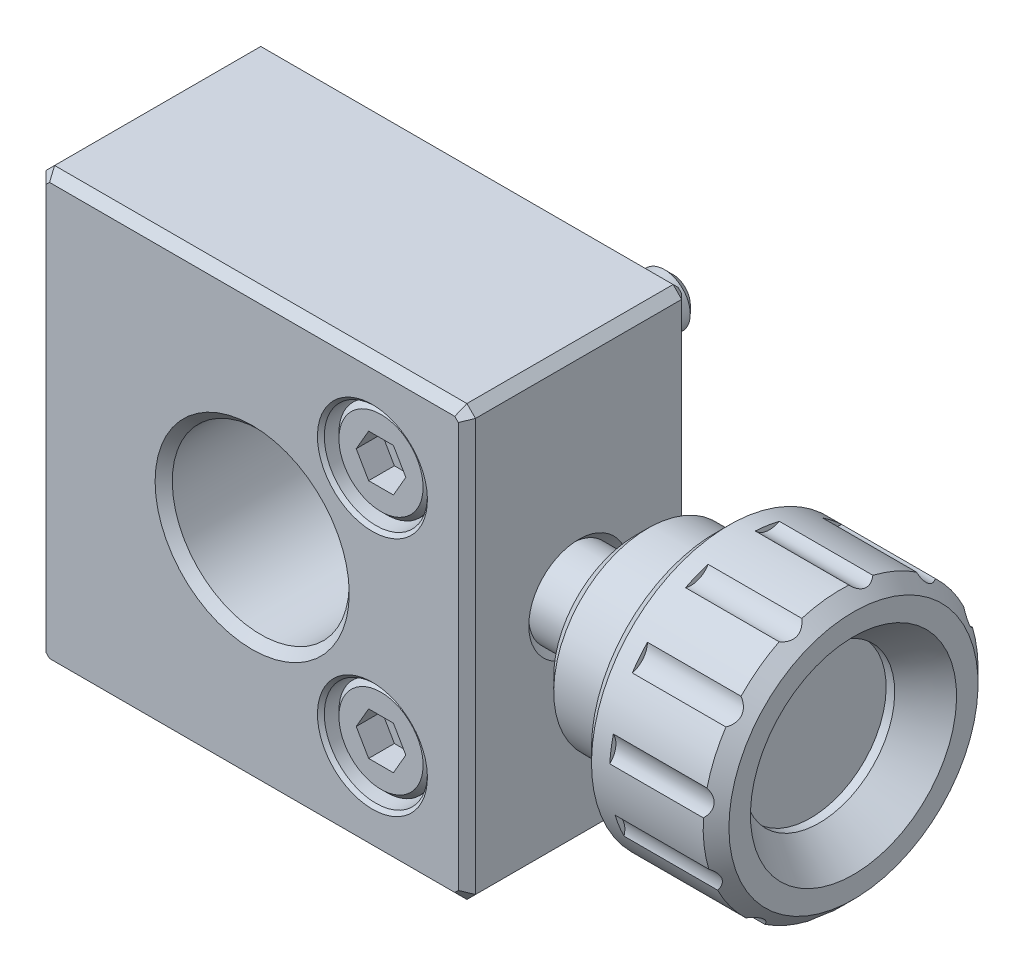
ISO-10303-21;
HEADER;
FILE_DESCRIPTION(('STEP AP214'),'2;1');
FILE_NAME('part.step','',(''),(''),'','','');
FILE_SCHEMA(('AUTOMOTIVE_DESIGN { 1 0 10303 214 1 1 1 1 }'));
ENDSEC;
DATA;
#1=APPLICATION_CONTEXT('core data for automotive mechanical design processes');
#2=APPLICATION_PROTOCOL_DEFINITION('international standard','automotive_design',2000,#1);
#3=PRODUCT_CONTEXT('',#1,'mechanical');
#4=PRODUCT('Part','Part','',(#3));
#5=PRODUCT_RELATED_PRODUCT_CATEGORY('part','',(#4));
#6=PRODUCT_DEFINITION_FORMATION('','',#4);
#7=PRODUCT_DEFINITION_CONTEXT('part definition',#1,'design');
#8=PRODUCT_DEFINITION('design','',#6,#7);
#9=PRODUCT_DEFINITION_SHAPE('','',#8);
#10=(LENGTH_UNIT() NAMED_UNIT(*) SI_UNIT(.MILLI.,.METRE.));
#11=(NAMED_UNIT(*) PLANE_ANGLE_UNIT() SI_UNIT($,.RADIAN.));
#12=(NAMED_UNIT(*) SI_UNIT($,.STERADIAN.) SOLID_ANGLE_UNIT());
#13=UNCERTAINTY_MEASURE_WITH_UNIT(LENGTH_MEASURE(1.E-05),#10,'distance_accuracy_value','');
#14=(GEOMETRIC_REPRESENTATION_CONTEXT(3) GLOBAL_UNCERTAINTY_ASSIGNED_CONTEXT((#13)) GLOBAL_UNIT_ASSIGNED_CONTEXT((#10,
#11,#12)) REPRESENTATION_CONTEXT('',''));
#15=CARTESIAN_POINT('',(0.,0.,0.));
#16=DIRECTION('',(0.,0.,1.));
#17=DIRECTION('',(1.,0.,0.));
#18=AXIS2_PLACEMENT_3D('',#15,#16,#17);
#19=CARTESIAN_POINT('',(7.72168783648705,-8.25,11.));
#20=DIRECTION('',(0.,1.,0.));
#21=DIRECTION('',(-1.,0.,0.));
#22=AXIS2_PLACEMENT_3D('',#19,#20,#21);
#23=PLANE('',#22);
#24=DIRECTION('',(0.,0.,1.));
#25=VECTOR('',#24,1.);
#26=CARTESIAN_POINT('',(6.27831216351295,-8.25,11.));
#27=LINE('',#26,#25);
#28=CARTESIAN_POINT('',(6.27831216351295,-8.25,11.));
#29=VERTEX_POINT('',#28);
#30=CARTESIAN_POINT('',(6.27831216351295,-8.25,12.5));
#31=VERTEX_POINT('',#30);
#32=EDGE_CURVE('E917',#29,#31,#27,.T.);
#33=ORIENTED_EDGE('',*,*,#32,.T.);
#34=DIRECTION('',(-1.,0.,0.));
#35=VECTOR('',#34,1.);
#36=CARTESIAN_POINT('',(7.72168783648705,-8.25,12.5));
#37=LINE('',#36,#35);
#38=CARTESIAN_POINT('',(7.72168783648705,-8.25,12.5));
#39=VERTEX_POINT('',#38);
#40=EDGE_CURVE('E33',#39,#31,#37,.T.);
#41=ORIENTED_EDGE('',*,*,#40,.F.);
#42=DIRECTION('',(0.,0.,1.));
#43=VECTOR('',#42,1.);
#44=CARTESIAN_POINT('',(7.72168783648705,-8.25,11.));
#45=LINE('',#44,#43);
#46=CARTESIAN_POINT('',(7.72168783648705,-8.25,11.));
#47=VERTEX_POINT('',#46);
#48=EDGE_CURVE('E892',#47,#39,#45,.T.);
#49=ORIENTED_EDGE('',*,*,#48,.F.);
#50=DIRECTION('',(-1.,0.,0.));
#51=VECTOR('',#50,1.);
#52=CARTESIAN_POINT('',(7.72168783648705,-8.25,11.));
#53=LINE('',#52,#51);
#54=EDGE_CURVE('E871',#47,#29,#53,.T.);
#55=ORIENTED_EDGE('',*,*,#54,.T.);
#56=EDGE_LOOP('',(#33,#41,#49,#55));
#57=FACE_BOUND('',#56,.T.);
#58=ADVANCED_FACE('F14',(#57),#23,.T.);
#59=CARTESIAN_POINT('',(5.55662432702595,-7.,11.));
#60=DIRECTION('',(-0.866025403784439,-0.5,0.));
#61=DIRECTION('',(0.5,-0.866025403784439,0.));
#62=AXIS2_PLACEMENT_3D('',#59,#60,#61);
#63=PLANE('',#62);
#64=DIRECTION('',(0.,0.,1.));
#65=VECTOR('',#64,1.);
#66=CARTESIAN_POINT('',(5.55662432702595,-7.,11.));
#67=LINE('',#66,#65);
#68=CARTESIAN_POINT('',(5.55662432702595,-7.,11.));
#69=VERTEX_POINT('',#68);
#70=CARTESIAN_POINT('',(5.55662432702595,-7.,12.5));
#71=VERTEX_POINT('',#70);
#72=EDGE_CURVE('E914',#69,#71,#67,.T.);
#73=ORIENTED_EDGE('',*,*,#72,.T.);
#74=DIRECTION('',(0.5,-0.866025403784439,0.));
#75=VECTOR('',#74,1.);
#76=CARTESIAN_POINT('',(5.55662432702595,-7.,12.5));
#77=LINE('',#76,#75);
#78=EDGE_CURVE('E884',#71,#31,#77,.T.);
#79=ORIENTED_EDGE('',*,*,#78,.T.);
#80=ORIENTED_EDGE('',*,*,#32,.F.);
#81=DIRECTION('',(0.5,-0.866025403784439,0.));
#82=VECTOR('',#81,1.);
#83=CARTESIAN_POINT('',(5.55662432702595,-7.,11.));
#84=LINE('',#83,#82);
#85=EDGE_CURVE('E874',#69,#29,#84,.T.);
#86=ORIENTED_EDGE('',*,*,#85,.F.);
#87=EDGE_LOOP('',(#73,#79,#80,#86));
#88=FACE_BOUND('',#87,.T.);
#89=ADVANCED_FACE('F832',(#88),#63,.F.);
#90=CARTESIAN_POINT('',(6.27831216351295,-5.75,11.));
#91=DIRECTION('',(-0.866025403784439,0.5,0.));
#92=DIRECTION('',(-0.5,-0.866025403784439,0.));
#93=AXIS2_PLACEMENT_3D('',#90,#91,#92);
#94=PLANE('',#93);
#95=DIRECTION('',(0.,0.,1.));
#96=VECTOR('',#95,1.);
#97=CARTESIAN_POINT('',(6.27831216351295,-5.75,11.));
#98=LINE('',#97,#96);
#99=CARTESIAN_POINT('',(6.27831216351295,-5.75,11.));
#100=VERTEX_POINT('',#99);
#101=CARTESIAN_POINT('',(6.27831216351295,-5.75,12.5));
#102=VERTEX_POINT('',#101);
#103=EDGE_CURVE('E911',#100,#102,#98,.T.);
#104=ORIENTED_EDGE('',*,*,#103,.T.);
#105=DIRECTION('',(-0.5,-0.866025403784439,0.));
#106=VECTOR('',#105,1.);
#107=CARTESIAN_POINT('',(6.27831216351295,-5.75,12.5));
#108=LINE('',#107,#106);
#109=EDGE_CURVE('E881',#102,#71,#108,.T.);
#110=ORIENTED_EDGE('',*,*,#109,.T.);
#111=ORIENTED_EDGE('',*,*,#72,.F.);
#112=DIRECTION('',(-0.5,-0.866025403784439,0.));
#113=VECTOR('',#112,1.);
#114=CARTESIAN_POINT('',(6.27831216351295,-5.75,11.));
#115=LINE('',#114,#113);
#116=EDGE_CURVE('E899',#100,#69,#115,.T.);
#117=ORIENTED_EDGE('',*,*,#116,.F.);
#118=EDGE_LOOP('',(#104,#110,#111,#117));
#119=FACE_BOUND('',#118,.T.);
#120=ADVANCED_FACE('F842',(#119),#94,.F.);
#121=CARTESIAN_POINT('',(6.27831216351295,-5.75,11.));
#122=DIRECTION('',(0.,-1.,0.));
#123=DIRECTION('',(1.,0.,0.));
#124=AXIS2_PLACEMENT_3D('',#121,#122,#123);
#125=PLANE('',#124);
#126=DIRECTION('',(0.,0.,1.));
#127=VECTOR('',#126,1.);
#128=CARTESIAN_POINT('',(7.72168783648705,-5.75,11.));
#129=LINE('',#128,#127);
#130=CARTESIAN_POINT('',(7.72168783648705,-5.75,11.));
#131=VERTEX_POINT('',#130);
#132=CARTESIAN_POINT('',(7.72168783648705,-5.75,12.5));
#133=VERTEX_POINT('',#132);
#134=EDGE_CURVE('E908',#131,#133,#129,.T.);
#135=ORIENTED_EDGE('',*,*,#134,.T.);
#136=DIRECTION('',(1.,0.,0.));
#137=VECTOR('',#136,1.);
#138=CARTESIAN_POINT('',(6.27831216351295,-5.75,12.5));
#139=LINE('',#138,#137);
#140=EDGE_CURVE('E876',#102,#133,#139,.T.);
#141=ORIENTED_EDGE('',*,*,#140,.F.);
#142=ORIENTED_EDGE('',*,*,#103,.F.);
#143=DIRECTION('',(1.,0.,0.));
#144=VECTOR('',#143,1.);
#145=CARTESIAN_POINT('',(6.27831216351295,-5.75,11.));
#146=LINE('',#145,#144);
#147=EDGE_CURVE('E896',#100,#131,#146,.T.);
#148=ORIENTED_EDGE('',*,*,#147,.T.);
#149=EDGE_LOOP('',(#135,#141,#142,#148));
#150=FACE_BOUND('',#149,.T.);
#151=ADVANCED_FACE('F838',(#150),#125,.T.);
#152=CARTESIAN_POINT('',(8.44337567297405,-7.,11.));
#153=DIRECTION('',(0.866025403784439,0.5,0.));
#154=DIRECTION('',(-0.5,0.866025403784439,0.));
#155=AXIS2_PLACEMENT_3D('',#152,#153,#154);
#156=PLANE('',#155);
#157=DIRECTION('',(0.,0.,1.));
#158=VECTOR('',#157,1.);
#159=CARTESIAN_POINT('',(8.44337567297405,-7.,11.));
#160=LINE('',#159,#158);
#161=CARTESIAN_POINT('',(8.44337567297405,-7.,11.));
#162=VERTEX_POINT('',#161);
#163=CARTESIAN_POINT('',(8.44337567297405,-7.,12.5));
#164=VERTEX_POINT('',#163);
#165=EDGE_CURVE('E905',#162,#164,#160,.T.);
#166=ORIENTED_EDGE('',*,*,#165,.T.);
#167=DIRECTION('',(-0.5,0.866025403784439,0.));
#168=VECTOR('',#167,1.);
#169=CARTESIAN_POINT('',(8.44337567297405,-7.,12.5));
#170=LINE('',#169,#168);
#171=EDGE_CURVE('E869',#164,#133,#170,.T.);
#172=ORIENTED_EDGE('',*,*,#171,.T.);
#173=ORIENTED_EDGE('',*,*,#134,.F.);
#174=DIRECTION('',(-0.5,0.866025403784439,0.));
#175=VECTOR('',#174,1.);
#176=CARTESIAN_POINT('',(8.44337567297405,-7.,11.));
#177=LINE('',#176,#175);
#178=EDGE_CURVE('E893',#162,#131,#177,.T.);
#179=ORIENTED_EDGE('',*,*,#178,.F.);
#180=EDGE_LOOP('',(#166,#172,#173,#179));
#181=FACE_BOUND('',#180,.T.);
#182=ADVANCED_FACE('F829',(#181),#156,.F.);
#183=CARTESIAN_POINT('',(7.72168783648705,-8.25,11.));
#184=DIRECTION('',(0.866025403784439,-0.5,0.));
#185=DIRECTION('',(0.5,0.866025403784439,0.));
#186=AXIS2_PLACEMENT_3D('',#183,#184,#185);
#187=PLANE('',#186);
#188=DIRECTION('',(0.5,0.866025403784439,0.));
#189=VECTOR('',#188,1.);
#190=CARTESIAN_POINT('',(7.72168783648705,-8.25,11.));
#191=LINE('',#190,#189);
#192=EDGE_CURVE('E889',#47,#162,#191,.T.);
#193=ORIENTED_EDGE('',*,*,#192,.F.);
#194=ORIENTED_EDGE('',*,*,#48,.T.);
#195=DIRECTION('',(0.5,0.866025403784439,0.));
#196=VECTOR('',#195,1.);
#197=CARTESIAN_POINT('',(7.72168783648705,-8.25,12.5));
#198=LINE('',#197,#196);
#199=EDGE_CURVE('E864',#39,#164,#198,.T.);
#200=ORIENTED_EDGE('',*,*,#199,.T.);
#201=ORIENTED_EDGE('',*,*,#165,.F.);
#202=EDGE_LOOP('',(#193,#194,#200,#201));
#203=FACE_BOUND('',#202,.T.);
#204=ADVANCED_FACE('F827',(#203),#187,.F.);
#205=CARTESIAN_POINT('',(6.27831216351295,-8.25,11.));
#206=DIRECTION('',(0.,0.,1.));
#207=DIRECTION('',(-0.866025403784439,-0.5,0.));
#208=AXIS2_PLACEMENT_3D('',#205,#206,#207);
#209=PLANE('',#208);
#210=ORIENTED_EDGE('',*,*,#54,.F.);
#211=ORIENTED_EDGE('',*,*,#192,.T.);
#212=ORIENTED_EDGE('',*,*,#178,.T.);
#213=ORIENTED_EDGE('',*,*,#147,.F.);
#214=ORIENTED_EDGE('',*,*,#116,.T.);
#215=ORIENTED_EDGE('',*,*,#85,.T.);
#216=EDGE_LOOP('',(#210,#211,#212,#213,#214,#215));
#217=FACE_BOUND('',#216,.T.);
#218=ADVANCED_FACE('F824',(#217),#209,.T.);
#219=CARTESIAN_POINT('',(7.,-7.,12.5));
#220=DIRECTION('',(0.,0.,1.));
#221=DIRECTION('',(-0.866025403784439,-0.5,0.));
#222=AXIS2_PLACEMENT_3D('',#219,#220,#221);
#223=PLANE('',#222);
#224=CARTESIAN_POINT('',(7.,-7.,12.5));
#225=DIRECTION('',(0.,0.,1.));
#226=DIRECTION('',(-0.866025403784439,-0.5,0.));
#227=AXIS2_PLACEMENT_3D('',#224,#225,#226);
#228=CIRCLE('',#227,2.45);
#229=CARTESIAN_POINT('',(4.87823776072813,-8.225,12.5));
#230=VERTEX_POINT('',#229);
#231=EDGE_CURVE('E860',#230,#230,#228,.T.);
#232=ORIENTED_EDGE('',*,*,#231,.T.);
#233=EDGE_LOOP('',(#232));
#234=FACE_BOUND('',#233,.T.);
#235=ORIENTED_EDGE('',*,*,#199,.F.);
#236=ORIENTED_EDGE('',*,*,#40,.T.);
#237=ORIENTED_EDGE('',*,*,#78,.F.);
#238=ORIENTED_EDGE('',*,*,#109,.F.);
#239=ORIENTED_EDGE('',*,*,#140,.T.);
#240=ORIENTED_EDGE('',*,*,#171,.F.);
#241=EDGE_LOOP('',(#235,#236,#237,#238,#239,#240));
#242=FACE_BOUND('',#241,.T.);
#243=ADVANCED_FACE('F799',(#234,#242),#223,.T.);
#244=CARTESIAN_POINT('',(7.,-7.,17.5));
#245=DIRECTION('',(0.,0.,1.));
#246=DIRECTION('',(-0.866025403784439,-0.5,0.));
#247=AXIS2_PLACEMENT_3D('',#244,#245,#246);
#248=CYLINDRICAL_SURFACE('',#247,2.75);
#249=CARTESIAN_POINT('',(7.,-7.,12.2));
#250=DIRECTION('',(0.,0.,1.));
#251=DIRECTION('',(-0.866025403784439,-0.5,0.));
#252=AXIS2_PLACEMENT_3D('',#249,#250,#251);
#253=CIRCLE('',#252,2.75);
#254=CARTESIAN_POINT('',(4.61843013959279,-8.375,12.2));
#255=VERTEX_POINT('',#254);
#256=EDGE_CURVE('E923',#255,#255,#253,.F.);
#257=ORIENTED_EDGE('',*,*,#256,.T.);
#258=EDGE_LOOP('',(#257));
#259=FACE_BOUND('',#258,.T.);
#260=CARTESIAN_POINT('',(7.,-7.,9.5));
#261=DIRECTION('',(0.,0.,1.));
#262=DIRECTION('',(-0.866025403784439,-0.5,0.));
#263=AXIS2_PLACEMENT_3D('',#260,#261,#262);
#264=CIRCLE('',#263,2.75);
#265=CARTESIAN_POINT('',(4.61843013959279,-8.375,9.5));
#266=VERTEX_POINT('',#265);
#267=EDGE_CURVE('E919',#266,#266,#264,.T.);
#268=ORIENTED_EDGE('',*,*,#267,.T.);
#269=EDGE_LOOP('',(#268));
#270=FACE_BOUND('',#269,.T.);
#271=ADVANCED_FACE('F792',(#259,#270),#248,.T.);
#272=CARTESIAN_POINT('',(7.,-7.,12.5));
#273=DIRECTION('',(0.,0.,-1.));
#274=DIRECTION('',(0.866025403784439,0.5,0.));
#275=AXIS2_PLACEMENT_3D('',#272,#273,#274);
#276=CONICAL_SURFACE('',#275,2.45,0.78539816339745);
#277=ORIENTED_EDGE('',*,*,#256,.F.);
#278=EDGE_LOOP('',(#277));
#279=FACE_BOUND('',#278,.T.);
#280=ORIENTED_EDGE('',*,*,#231,.F.);
#281=EDGE_LOOP('',(#280));
#282=FACE_BOUND('',#281,.T.);
#283=ADVANCED_FACE('F788',(#279,#282),#276,.T.);
#284=CARTESIAN_POINT('',(26.,-4.35146697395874,7.15171709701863));
#285=DIRECTION('',(1.,0.,0.));
#286=DIRECTION('',(0.,0.148117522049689,0.988969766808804));
#287=AXIS2_PLACEMENT_3D('',#284,#285,#286);
#288=PLANE('',#287);
#289=CARTESIAN_POINT('',(26.,0.,6.5));
#290=DIRECTION('',(-1.,0.,0.));
#291=DIRECTION('',(0.,-0.148117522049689,-0.988969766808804));
#292=AXIS2_PLACEMENT_3D('',#289,#290,#291);
#293=CIRCLE('',#292,4.4);
#294=CARTESIAN_POINT('',(26.,-0.651717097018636,2.14853302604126));
#295=VERTEX_POINT('',#294);
#296=EDGE_CURVE('E743',#295,#295,#293,.T.);
#297=ORIENTED_EDGE('',*,*,#296,.F.);
#298=EDGE_LOOP('',(#297));
#299=FACE_BOUND('',#298,.T.);
#300=ADVANCED_FACE('F497',(#299),#288,.T.);
#301=CARTESIAN_POINT('',(15.5,0.,6.5));
#302=DIRECTION('',(-1.,0.,0.));
#303=DIRECTION('',(0.,-0.148117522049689,-0.988969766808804));
#304=AXIS2_PLACEMENT_3D('',#301,#302,#303);
#305=CYLINDRICAL_SURFACE('',#304,4.4);
#306=ORIENTED_EDGE('',*,*,#296,.T.);
#307=EDGE_LOOP('',(#306));
#308=FACE_BOUND('',#307,.T.);
#309=CARTESIAN_POINT('',(26.5,0.,6.5));
#310=DIRECTION('',(-1.,0.,0.));
#311=DIRECTION('',(0.,-0.148117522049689,-0.988969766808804));
#312=AXIS2_PLACEMENT_3D('',#309,#310,#311);
#313=CIRCLE('',#312,4.4);
#314=CARTESIAN_POINT('',(26.5,-0.651717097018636,2.14853302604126));
#315=VERTEX_POINT('',#314);
#316=EDGE_CURVE('E778',#315,#315,#313,.T.);
#317=ORIENTED_EDGE('',*,*,#316,.F.);
#318=EDGE_LOOP('',(#317));
#319=FACE_BOUND('',#318,.T.);
#320=ADVANCED_FACE('F493',(#308,#319),#305,.F.);
#321=CARTESIAN_POINT('',(28.5,0.,6.5));
#322=DIRECTION('',(1.,0.,0.));
#323=DIRECTION('',(0.,0.148117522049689,0.988969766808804));
#324=AXIS2_PLACEMENT_3D('',#321,#322,#323);
#325=CONICAL_SURFACE('',#324,6.,0.67474094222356);
#326=ORIENTED_EDGE('',*,*,#316,.T.);
#327=EDGE_LOOP('',(#326));
#328=FACE_BOUND('',#327,.T.);
#329=CARTESIAN_POINT('',(28.5,0.,6.5));
#330=DIRECTION('',(-1.,0.,0.));
#331=DIRECTION('',(0.,-0.148117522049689,-0.988969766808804));
#332=AXIS2_PLACEMENT_3D('',#329,#330,#331);
#333=CIRCLE('',#332,6.);
#334=CARTESIAN_POINT('',(28.5,-0.888705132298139,0.566181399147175));
#335=VERTEX_POINT('',#334);
#336=EDGE_CURVE('E355',#335,#335,#333,.T.);
#337=ORIENTED_EDGE('',*,*,#336,.F.);
#338=EDGE_LOOP('',(#337));
#339=FACE_BOUND('',#338,.T.);
#340=ADVANCED_FACE('F496',(#328,#339),#325,.F.);
#341=CARTESIAN_POINT('',(28.5,-5.93381860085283,7.38870513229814));
#342=DIRECTION('',(1.,0.,0.));
#343=DIRECTION('',(0.,0.148117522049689,0.988969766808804));
#344=AXIS2_PLACEMENT_3D('',#341,#342,#343);
#345=PLANE('',#344);
#346=ORIENTED_EDGE('',*,*,#336,.T.);
#347=EDGE_LOOP('',(#346));
#348=FACE_BOUND('',#347,.T.);
#349=CARTESIAN_POINT('',(28.5,0.,6.5));
#350=DIRECTION('',(-1.,0.,0.));
#351=DIRECTION('',(0.,-0.148117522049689,-0.988969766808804));
#352=AXIS2_PLACEMENT_3D('',#349,#350,#351);
#353=CIRCLE('',#352,7.25);
#354=CARTESIAN_POINT('',(28.5,-1.07385203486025,-0.67003080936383));
#355=VERTEX_POINT('',#354);
#356=EDGE_CURVE('E350',#355,#355,#353,.T.);
#357=ORIENTED_EDGE('',*,*,#356,.F.);
#358=EDGE_LOOP('',(#357));
#359=FACE_BOUND('',#358,.T.);
#360=ADVANCED_FACE('F489',(#348,#359),#345,.T.);
#361=CARTESIAN_POINT('',(22.3,0.,6.5));
#362=DIRECTION('',(1.,0.,0.));
#363=DIRECTION('',(0.,0.148117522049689,0.988969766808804));
#364=AXIS2_PLACEMENT_3D('',#361,#362,#363);
#365=PLANE('',#364);
#366=CARTESIAN_POINT('',(22.3,1.31454300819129,15.2771066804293));
#367=DIRECTION('',(-1.,0.,0.));
#368=DIRECTION('',(0.,0.148117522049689,0.988969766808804));
#369=AXIS2_PLACEMENT_3D('',#366,#367,#368);
#370=CIRCLE('',#369,1.15);
#371=CARTESIAN_POINT('',(22.3,1.88029073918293,14.2758926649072));
#372=VERTEX_POINT('',#371);
#373=CARTESIAN_POINT('',(22.3,0.480295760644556,14.4855692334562));
#374=VERTEX_POINT('',#373);
#375=EDGE_CURVE('E728',#372,#374,#370,.T.);
#376=ORIENTED_EDGE('',*,*,#375,.F.);
#377=CARTESIAN_POINT('',(22.3,0.,6.5));
#378=DIRECTION('',(1.,0.,0.));
#379=DIRECTION('',(0.,0.148117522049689,0.988969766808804));
#380=AXIS2_PLACEMENT_3D('',#377,#378,#379);
#381=CIRCLE('',#380,8.);
#382=EDGE_CURVE('E700',#374,#372,#381,.F.);
#383=ORIENTED_EDGE('',*,*,#382,.F.);
#384=EDGE_LOOP('',(#376,#383));
#385=FACE_BOUND('',#384,.T.);
#386=ADVANCED_FACE('F485',(#385),#365,.T.);
#387=CARTESIAN_POINT('',(22.3,1.31454300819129,15.2771066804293));
#388=DIRECTION('',(1.,0.,0.));
#389=DIRECTION('',(0.,0.148117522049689,0.988969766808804));
#390=AXIS2_PLACEMENT_3D('',#387,#388,#389);
#391=CYLINDRICAL_SURFACE('',#390,1.15);
#392=DIRECTION('',(1.,0.,0.));
#393=VECTOR('',#392,1.);
#394=CARTESIAN_POINT('',(22.3,1.88029073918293,14.2758926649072));
#395=LINE('',#394,#393);
#396=CARTESIAN_POINT('',(27.7499999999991,1.88029073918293,14.2758926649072));
#397=VERTEX_POINT('',#396);
#398=EDGE_CURVE('E756',#372,#397,#395,.T.);
#399=ORIENTED_EDGE('',*,*,#398,.F.);
#400=ORIENTED_EDGE('',*,*,#375,.T.);
#401=DIRECTION('',(1.,0.,0.));
#402=VECTOR('',#401,1.);
#403=CARTESIAN_POINT('',(22.3,0.480295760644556,14.4855692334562));
#404=LINE('',#403,#402);
#405=CARTESIAN_POINT('',(27.75,0.480295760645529,14.4855692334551));
#406=VERTEX_POINT('',#405);
#407=EDGE_CURVE('E754',#374,#406,#404,.T.);
#408=ORIENTED_EDGE('',*,*,#407,.T.);
#409=CARTESIAN_POINT('',(27.7498266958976,1.88051167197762,14.2760175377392));
#410=CARTESIAN_POINT('',(27.7827435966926,1.83854641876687,14.2522916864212));
#411=CARTESIAN_POINT('',(27.8141461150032,1.79391288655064,14.2305470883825));
#412=CARTESIAN_POINT('',(27.872548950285,1.69919422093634,14.1921250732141));
#413=CARTESIAN_POINT('',(27.8995022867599,1.64905919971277,14.1755003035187));
#414=CARTESIAN_POINT('',(27.9426329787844,1.55354444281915,14.1513435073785));
#415=CARTESIAN_POINT('',(27.9598771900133,1.50893899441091,14.1427120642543));
#416=CARTESIAN_POINT('',(27.9888070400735,1.41740761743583,14.1307917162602));
#417=CARTESIAN_POINT('',(28.0005128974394,1.37049083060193,14.1274832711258));
#418=CARTESIAN_POINT('',(28.0175147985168,1.27500639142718,14.1267886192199));
#419=CARTESIAN_POINT('',(28.022755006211,1.2264280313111,14.1294534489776));
#420=CARTESIAN_POINT('',(28.0260777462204,1.12974159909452,14.141009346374));
#421=CARTESIAN_POINT('',(28.0241585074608,1.08163364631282,14.1499019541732));
#422=CARTESIAN_POINT('',(28.0140225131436,0.993296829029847,14.1720607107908));
#423=CARTESIAN_POINT('',(28.0065809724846,0.952810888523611,14.1846817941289));
#424=CARTESIAN_POINT('',(27.9868901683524,0.874503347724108,14.2138038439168));
#425=CARTESIAN_POINT('',(27.9746385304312,0.836683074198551,14.2303067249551));
#426=CARTESIAN_POINT('',(27.940973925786,0.751313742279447,14.2729698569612));
#427=CARTESIAN_POINT('',(27.9178517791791,0.705113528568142,14.3004742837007));
#428=CARTESIAN_POINT('',(27.8660439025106,0.619062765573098,14.3597457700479));
#429=CARTESIAN_POINT('',(27.8373515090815,0.579219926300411,14.3915179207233));
#430=CARTESIAN_POINT('',(27.7883657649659,0.520600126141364,14.4446280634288));
#431=CARTESIAN_POINT('',(27.7693731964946,0.499823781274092,14.4649844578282));
#432=CARTESIAN_POINT('',(27.7498266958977,0.480121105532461,14.485753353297));
#433=B_SPLINE_CURVE_WITH_KNOTS('',3,(#409,#410,#411,#412,#413,#414,#415,#416,#417,#418,#419,
#420,#421,#422,#423,#424,#425,#426,#427,#428,#429,#430,#431,#432),.UNSPECIFIED.,.F.,.F.,(4,2,2,
2,2,2,2,2,2,2,2,4),(0.,0.175420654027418,0.35258917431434,0.497789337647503,0.642455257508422,
0.788361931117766,0.934304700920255,1.06290984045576,1.19157854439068,1.36619586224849,
1.5410233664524,1.64509140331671),.UNSPECIFIED.);
#434=EDGE_CURVE('E655',#397,#406,#433,.T.);
#435=ORIENTED_EDGE('',*,*,#434,.F.);
#436=EDGE_LOOP('',(#399,#400,#408,#435));
#437=FACE_BOUND('',#436,.T.);
#438=ADVANCED_FACE('F488',(#437),#391,.F.);
#439=CARTESIAN_POINT('',(22.3,-3.25012570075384,14.7584688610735));
#440=DIRECTION('',(-1.,0.,0.));
#441=DIRECTION('',(0.,0.148117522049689,0.988969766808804));
#442=AXIS2_PLACEMENT_3D('',#439,#440,#441);
#443=CIRCLE('',#442,1.15);
#444=CARTESIAN_POINT('',(22.3,-2.25956678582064,14.1742659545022));
#445=VERTEX_POINT('',#444);
#446=CARTESIAN_POINT('',(22.3,-3.57683628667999,13.6558537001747));
#447=VERTEX_POINT('',#446);
#448=EDGE_CURVE('E731',#445,#447,#443,.T.);
#449=ORIENTED_EDGE('',*,*,#448,.F.);
#450=EDGE_CURVE('E1835',#447,#445,#381,.F.);
#451=ORIENTED_EDGE('',*,*,#450,.F.);
#452=EDGE_LOOP('',(#449,#451));
#453=FACE_BOUND('',#452,.T.);
#454=ADVANCED_FACE('F492',(#453),#365,.T.);
#455=CARTESIAN_POINT('',(22.3,-3.25012570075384,14.7584688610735));
#456=DIRECTION('',(1.,0.,0.));
#457=DIRECTION('',(0.,0.148117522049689,0.988969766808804));
#458=AXIS2_PLACEMENT_3D('',#455,#456,#457);
#459=CYLINDRICAL_SURFACE('',#458,1.15);
#460=DIRECTION('',(1.,0.,0.));
#461=VECTOR('',#460,1.);
#462=CARTESIAN_POINT('',(22.3,-2.25956678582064,14.1742659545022));
#463=LINE('',#462,#461);
#464=CARTESIAN_POINT('',(27.7499999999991,-2.25956678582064,14.1742659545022));
#465=VERTEX_POINT('',#464);
#466=EDGE_CURVE('E752',#445,#465,#463,.T.);
#467=ORIENTED_EDGE('',*,*,#466,.F.);
#468=ORIENTED_EDGE('',*,*,#448,.T.);
#469=DIRECTION('',(1.,0.,0.));
#470=VECTOR('',#469,1.);
#471=CARTESIAN_POINT('',(22.3,-3.57683628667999,13.6558537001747));
#472=LINE('',#471,#470);
#473=CARTESIAN_POINT('',(27.75,-3.57683628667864,13.6558537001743));
#474=VERTEX_POINT('',#473);
#475=EDGE_CURVE('E750',#447,#474,#472,.T.);
#476=ORIENTED_EDGE('',*,*,#475,.T.);
#477=CARTESIAN_POINT('',(27.7498526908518,-2.25945721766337,14.1744517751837));
#478=CARTESIAN_POINT('',(27.7827673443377,-2.28393791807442,14.1329239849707));
#479=CARTESIAN_POINT('',(27.8141675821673,-2.31171985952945,14.0917779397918));
#480=CARTESIAN_POINT('',(27.8725658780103,-2.3745380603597,14.0111484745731));
#481=CARTESIAN_POINT('',(27.899516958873,-2.40964383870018,13.9716857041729));
#482=CARTESIAN_POINT('',(27.9426442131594,-2.4802838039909,13.9030111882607));
#483=CARTESIAN_POINT('',(27.959887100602,-2.51459795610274,13.873234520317));
#484=CARTESIAN_POINT('',(27.9888142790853,-2.58790686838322,13.8171478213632));
#485=CARTESIAN_POINT('',(28.0005187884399,-2.62688394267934,13.7908254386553));
#486=CARTESIAN_POINT('',(28.0175180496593,-2.70922852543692,13.7424841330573));
#487=CARTESIAN_POINT('',(28.0227569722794,-2.75263081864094,13.7205040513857));
#488=CARTESIAN_POINT('',(28.0260773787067,-2.84214087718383,13.682171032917));
#489=CARTESIAN_POINT('',(28.0241570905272,-2.88824930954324,13.6658194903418));
#490=CARTESIAN_POINT('',(28.0140193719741,-2.97582986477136,13.6408430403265));
#491=CARTESIAN_POINT('',(28.0065770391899,-3.01720213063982,13.6315310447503));
#492=CARTESIAN_POINT('',(27.9868847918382,-3.09957908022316,13.6175992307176));
#493=CARTESIAN_POINT('',(27.9746325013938,-3.1405835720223,13.61298173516));
#494=CARTESIAN_POINT('',(27.9409660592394,-3.23584776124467,13.6072459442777));
#495=CARTESIAN_POINT('',(27.9178426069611,-3.28961131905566,13.6079663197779));
#496=CARTESIAN_POINT('',(27.866032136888,-3.39377048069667,13.6162735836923));
#497=CARTESIAN_POINT('',(27.8373384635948,-3.4441619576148,13.6238687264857));
#498=CARTESIAN_POINT('',(27.7883669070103,-3.52145836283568,13.6405498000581));
#499=CARTESIAN_POINT('',(27.769391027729,-3.54960529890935,13.6477841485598));
#500=CARTESIAN_POINT('',(27.749862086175,-3.57702992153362,13.6559110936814));
#501=B_SPLINE_CURVE_WITH_KNOTS('',3,(#477,#478,#479,#480,#481,#482,#483,#484,#485,#486,#487,
#488,#489,#490,#491,#492,#493,#494,#495,#496,#497,#498,#499,#500),.UNSPECIFIED.,.F.,.F.,(4,2,2,
2,2,2,2,2,2,2,2,4),(0.,0.175413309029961,0.352574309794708,0.497771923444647,0.642435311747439,
0.78833929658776,0.934279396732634,1.06288407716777,1.19155236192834,1.3661734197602,
1.54100441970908,1.64498267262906),.UNSPECIFIED.);
#502=EDGE_CURVE('E648',#465,#474,#501,.T.);
#503=ORIENTED_EDGE('',*,*,#502,.F.);
#504=EDGE_LOOP('',(#467,#468,#476,#503));
#505=FACE_BOUND('',#504,.T.);
#506=ADVANCED_FACE('F642',(#505),#459,.F.);
#507=CARTESIAN_POINT('',(22.3,-6.9439258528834,12.0269809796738));
#508=DIRECTION('',(-1.,0.,0.));
#509=DIRECTION('',(0.,0.148117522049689,0.988969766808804));
#510=AXIS2_PLACEMENT_3D('',#507,#508,#509);
#511=CIRCLE('',#510,1.15000000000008);
#512=CARTESIAN_POINT('',(22.3,-5.79397521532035,12.0163258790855));
#513=VERTEX_POINT('',#512);
#514=CARTESIAN_POINT('',(22.3,-6.67555793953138,10.9087329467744));
#515=VERTEX_POINT('',#514);
#516=EDGE_CURVE('E734',#513,#515,#511,.T.);
#517=ORIENTED_EDGE('',*,*,#516,.F.);
#518=EDGE_CURVE('E1837',#515,#513,#381,.F.);
#519=ORIENTED_EDGE('',*,*,#518,.F.);
#520=EDGE_LOOP('',(#517,#519));
#521=FACE_BOUND('',#520,.T.);
#522=ADVANCED_FACE('F640',(#521),#365,.T.);
#523=CARTESIAN_POINT('',(22.3,-6.9439258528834,12.0269809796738));
#524=DIRECTION('',(1.,0.,0.));
#525=DIRECTION('',(0.,0.148117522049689,0.988969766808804));
#526=AXIS2_PLACEMENT_3D('',#523,#524,#525);
#527=CYLINDRICAL_SURFACE('',#526,1.15000000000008);
#528=DIRECTION('',(1.,0.,0.));
#529=VECTOR('',#528,1.);
#530=CARTESIAN_POINT('',(22.3,-5.79397521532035,12.0163258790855));
#531=LINE('',#530,#529);
#532=CARTESIAN_POINT('',(27.7499999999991,-5.79397521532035,12.0163258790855));
#533=VERTEX_POINT('',#532);
#534=EDGE_CURVE('E748',#513,#533,#531,.T.);
#535=ORIENTED_EDGE('',*,*,#534,.F.);
#536=ORIENTED_EDGE('',*,*,#516,.T.);
#537=DIRECTION('',(1.,0.,0.));
#538=VECTOR('',#537,1.);
#539=CARTESIAN_POINT('',(22.3,-6.67555793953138,10.9087329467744));
#540=LINE('',#539,#538);
#541=CARTESIAN_POINT('',(27.75,-6.67555793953,10.9087329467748));
#542=VERTEX_POINT('',#541);
#543=EDGE_CURVE('E746',#515,#542,#540,.T.);
#544=ORIENTED_EDGE('',*,*,#543,.T.);
#545=CARTESIAN_POINT('',(27.749862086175,-5.79397336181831,12.0165278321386));
#546=CARTESIAN_POINT('',(27.7827759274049,-5.79441094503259,11.9683238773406));
#547=CARTESIAN_POINT('',(27.8141753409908,-5.79789831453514,11.9187999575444));
#548=CARTESIAN_POINT('',(27.8725719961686,-5.81198665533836,11.8175649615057));
#549=CARTESIAN_POINT('',(27.8995222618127,-5.82265815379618,11.7658370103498));
#550=CARTESIAN_POINT('',(27.9426482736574,-5.84949753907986,11.6710441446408));
#551=CARTESIAN_POINT('',(27.9598906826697,-5.8643264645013,11.6280999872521));
#552=CARTESIAN_POINT('',(27.9888168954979,-5.8997710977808,11.5428736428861));
#553=CARTESIAN_POINT('',(28.0005209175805,-5.92036531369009,11.5005896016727));
#554=CARTESIAN_POINT('',(28.0175192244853,-5.96750759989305,11.4175533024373));
#555=CARTESIAN_POINT('',(28.0227576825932,-5.99410521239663,11.3768172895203));
#556=CARTESIAN_POINT('',(28.0260772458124,-6.05245688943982,11.2988658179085));
#557=CARTESIAN_POINT('',(28.0241565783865,-6.08421222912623,11.2616512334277));
#558=CARTESIAN_POINT('',(28.0140182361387,-6.14757110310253,11.196231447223));
#559=CARTESIAN_POINT('',(28.0065756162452,-6.17874464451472,11.1674811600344));
#560=CARTESIAN_POINT('',(27.986882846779,-6.24311941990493,11.114227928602));
#561=CARTESIAN_POINT('',(27.9746303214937,-6.27632164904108,11.089727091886));
#562=CARTESIAN_POINT('',(27.9409632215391,-6.35595541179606,11.0371280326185));
#563=CARTESIAN_POINT('',(27.9178393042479,-6.40287661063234,11.0108702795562));
#564=CARTESIAN_POINT('',(27.8660279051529,-6.49723548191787,10.9659854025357));
#565=CARTESIAN_POINT('',(27.8373337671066,-6.54467370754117,10.9473674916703));
#566=CARTESIAN_POINT('',(27.7883604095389,-6.61995706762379,10.9231654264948));
#567=CARTESIAN_POINT('',(27.7693831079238,-6.64795202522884,10.9153568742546));
#568=CARTESIAN_POINT('',(27.7498526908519,-6.67576770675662,10.9086826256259));
#569=B_SPLINE_CURVE_WITH_KNOTS('',3,(#545,#546,#547,#548,#549,#550,#551,#552,#553,#554,#555,
#556,#557,#558,#559,#560,#561,#562,#563,#564,#565,#566,#567,#568),.UNSPECIFIED.,.F.,.F.,(4,2,2,
2,2,2,2,2,2,2,2,4),(0.,0.175410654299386,0.352568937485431,0.497765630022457,0.642428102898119,
0.788331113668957,0.93427025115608,1.0628747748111,1.19154289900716,1.36616525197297,
1.54099757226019,1.64498268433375),.UNSPECIFIED.);
#570=EDGE_CURVE('E623',#533,#542,#569,.T.);
#571=ORIENTED_EDGE('',*,*,#570,.F.);
#572=EDGE_LOOP('',(#535,#536,#544,#571));
#573=FACE_BOUND('',#572,.T.);
#574=ADVANCED_FACE('F636',(#573),#527,.F.);
#575=CARTESIAN_POINT('',(22.3,-8.77710668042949,7.81454300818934));
#576=DIRECTION('',(-1.,0.,0.));
#577=DIRECTION('',(0.,0.148117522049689,0.988969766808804));
#578=AXIS2_PLACEMENT_3D('',#575,#576,#577);
#579=CIRCLE('',#578,1.15);
#580=CARTESIAN_POINT('',(22.3,-7.77589266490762,8.38029073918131));
#581=VERTEX_POINT('',#580);
#582=CARTESIAN_POINT('',(22.3,-7.98556923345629,6.98029576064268));
#583=VERTEX_POINT('',#582);
#584=EDGE_CURVE('E737',#581,#583,#579,.T.);
#585=ORIENTED_EDGE('',*,*,#584,.F.);
#586=EDGE_CURVE('E610',#583,#581,#381,.F.);
#587=ORIENTED_EDGE('',*,*,#586,.F.);
#588=EDGE_LOOP('',(#585,#587));
#589=FACE_BOUND('',#588,.T.);
#590=ADVANCED_FACE('F633',(#589),#365,.T.);
#591=CARTESIAN_POINT('',(22.3,-8.77710668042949,7.81454300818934));
#592=DIRECTION('',(1.,0.,0.));
#593=DIRECTION('',(0.,0.148117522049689,0.988969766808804));
#594=AXIS2_PLACEMENT_3D('',#591,#592,#593);
#595=CYLINDRICAL_SURFACE('',#594,1.15);
#596=DIRECTION('',(1.,0.,0.));
#597=VECTOR('',#596,1.);
#598=CARTESIAN_POINT('',(22.3,-7.77589266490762,8.38029073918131));
#599=LINE('',#598,#597);
#600=CARTESIAN_POINT('',(27.7499999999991,-7.77589266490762,8.38029073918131));
#601=VERTEX_POINT('',#600);
#602=EDGE_CURVE('E744',#581,#601,#599,.T.);
#603=ORIENTED_EDGE('',*,*,#602,.F.);
#604=ORIENTED_EDGE('',*,*,#584,.T.);
#605=DIRECTION('',(1.,0.,0.));
#606=VECTOR('',#605,1.);
#607=CARTESIAN_POINT('',(22.3,-7.98556923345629,6.98029576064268));
#608=LINE('',#607,#606);
#609=CARTESIAN_POINT('',(27.75,-7.98556923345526,6.98029576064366));
#610=VERTEX_POINT('',#609);
#611=EDGE_CURVE('E741',#583,#610,#608,.T.);
#612=ORIENTED_EDGE('',*,*,#611,.T.);
#613=CARTESIAN_POINT('',(27.7498266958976,-7.77601753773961,8.380511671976));
#614=CARTESIAN_POINT('',(27.7827435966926,-7.7522916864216,8.33854641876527));
#615=CARTESIAN_POINT('',(27.8141461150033,-7.7305470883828,8.29391288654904));
#616=CARTESIAN_POINT('',(27.8725489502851,-7.69212507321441,8.19919422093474));
#617=CARTESIAN_POINT('',(27.8995022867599,-7.67550030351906,8.14905919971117));
#618=CARTESIAN_POINT('',(27.9426329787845,-7.65134350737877,8.05354444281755));
#619=CARTESIAN_POINT('',(27.9598771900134,-7.64271206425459,8.00893899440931));
#620=CARTESIAN_POINT('',(27.9888070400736,-7.63079171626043,7.91740761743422));
#621=CARTESIAN_POINT('',(28.0005128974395,-7.627483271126,7.87049083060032));
#622=CARTESIAN_POINT('',(28.0175147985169,-7.62678861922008,7.77500639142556));
#623=CARTESIAN_POINT('',(28.0227550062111,-7.62945344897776,7.72642803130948));
#624=CARTESIAN_POINT('',(28.0260777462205,-7.64100934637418,7.62974159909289));
#625=CARTESIAN_POINT('',(28.0241585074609,-7.64990195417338,7.58163364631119));
#626=CARTESIAN_POINT('',(28.0140225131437,-7.67206071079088,7.4932968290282));
#627=CARTESIAN_POINT('',(28.0065809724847,-7.684681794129,7.45281088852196));
#628=CARTESIAN_POINT('',(27.9868901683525,-7.7138038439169,7.37450334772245));
#629=CARTESIAN_POINT('',(27.9746385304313,-7.73030672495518,7.33668307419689));
#630=CARTESIAN_POINT('',(27.9409739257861,-7.77296985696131,7.25131374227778));
#631=CARTESIAN_POINT('',(27.9178517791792,-7.80047428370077,7.20511352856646));
#632=CARTESIAN_POINT('',(27.8660439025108,-7.85974577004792,7.1190627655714));
#633=CARTESIAN_POINT('',(27.8373515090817,-7.89151792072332,7.0792199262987));
#634=CARTESIAN_POINT('',(27.788365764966,-7.94462806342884,7.0206001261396));
#635=CARTESIAN_POINT('',(27.7693731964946,-7.96498445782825,6.99982378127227));
#636=CARTESIAN_POINT('',(27.7498266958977,-7.98575335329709,6.98012110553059));
#637=B_SPLINE_CURVE_WITH_KNOTS('',3,(#613,#614,#615,#616,#617,#618,#619,#620,#621,#622,#623,
#624,#625,#626,#627,#628,#629,#630,#631,#632,#633,#634,#635,#636),.UNSPECIFIED.,.F.,.F.,(4,2,2,
2,2,2,2,2,2,2,2,4),(0.,0.175420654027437,0.352589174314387,0.497789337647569,0.642455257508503,
0.788361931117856,0.934304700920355,1.06290984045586,1.19157854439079,1.36619586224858,
1.54102336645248,1.64509140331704),.UNSPECIFIED.);
#638=EDGE_CURVE('E615',#601,#610,#637,.T.);
#639=ORIENTED_EDGE('',*,*,#638,.F.);
#640=EDGE_LOOP('',(#603,#604,#612,#639));
#641=FACE_BOUND('',#640,.T.);
#642=ADVANCED_FACE('F630',(#641),#595,.F.);
#643=CARTESIAN_POINT('',(22.3,-8.2584688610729,3.24987429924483));
#644=DIRECTION('',(-1.,0.,0.));
#645=DIRECTION('',(0.,0.148117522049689,0.988969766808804));
#646=AXIS2_PLACEMENT_3D('',#643,#644,#645);
#647=CIRCLE('',#646,1.15);
#648=CARTESIAN_POINT('',(22.3,-7.67426595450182,4.24043321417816));
#649=VERTEX_POINT('',#648);
#650=CARTESIAN_POINT('',(22.3,-7.1558537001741,2.92316371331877));
#651=VERTEX_POINT('',#650);
#652=EDGE_CURVE('E712',#649,#651,#647,.T.);
#653=ORIENTED_EDGE('',*,*,#652,.F.);
#654=EDGE_CURVE('E611',#651,#649,#381,.F.);
#655=ORIENTED_EDGE('',*,*,#654,.F.);
#656=EDGE_LOOP('',(#653,#655));
#657=FACE_BOUND('',#656,.T.);
#658=ADVANCED_FACE('F483',(#657),#365,.T.);
#659=CARTESIAN_POINT('',(22.3,-8.2584688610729,3.24987429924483));
#660=DIRECTION('',(1.,0.,0.));
#661=DIRECTION('',(0.,0.148117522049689,0.988969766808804));
#662=AXIS2_PLACEMENT_3D('',#659,#660,#661);
#663=CYLINDRICAL_SURFACE('',#662,1.15);
#664=DIRECTION('',(1.,0.,0.));
#665=VECTOR('',#664,1.);
#666=CARTESIAN_POINT('',(22.3,-7.67426595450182,4.24043321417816));
#667=LINE('',#666,#665);
#668=CARTESIAN_POINT('',(27.7499999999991,-7.67426595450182,4.24043321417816));
#669=VERTEX_POINT('',#668);
#670=EDGE_CURVE('E740',#649,#669,#667,.T.);
#671=ORIENTED_EDGE('',*,*,#670,.F.);
#672=ORIENTED_EDGE('',*,*,#652,.T.);
#673=DIRECTION('',(1.,0.,0.));
#674=VECTOR('',#673,1.);
#675=CARTESIAN_POINT('',(22.3,-7.1558537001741,2.92316371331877));
#676=LINE('',#675,#674);
#677=CARTESIAN_POINT('',(27.75,-7.1558537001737,2.92316371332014));
#678=VERTEX_POINT('',#677);
#679=EDGE_CURVE('E773',#651,#678,#676,.T.);
#680=ORIENTED_EDGE('',*,*,#679,.T.);
#681=CARTESIAN_POINT('',(27.7498526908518,-7.67445177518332,4.24054278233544));
#682=CARTESIAN_POINT('',(27.7827673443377,-7.63292398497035,4.21606208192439));
#683=CARTESIAN_POINT('',(27.8141675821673,-7.59177793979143,4.18828014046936));
#684=CARTESIAN_POINT('',(27.8725658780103,-7.51114847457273,4.12546193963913));
#685=CARTESIAN_POINT('',(27.899516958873,-7.47168570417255,4.09035616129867));
#686=CARTESIAN_POINT('',(27.9426442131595,-7.40301118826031,4.01971619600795));
#687=CARTESIAN_POINT('',(27.959887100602,-7.37323452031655,3.9854020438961));
#688=CARTESIAN_POINT('',(27.9888142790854,-7.31714782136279,3.91209313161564));
#689=CARTESIAN_POINT('',(28.00051878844,-7.29082543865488,3.87311605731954));
#690=CARTESIAN_POINT('',(28.0175180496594,-7.24248413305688,3.79077147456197));
#691=CARTESIAN_POINT('',(28.0227569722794,-7.22050405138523,3.74736918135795));
#692=CARTESIAN_POINT('',(28.0260773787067,-7.18217103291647,3.65785912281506));
#693=CARTESIAN_POINT('',(28.0241570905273,-7.16581949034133,3.61175069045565));
#694=CARTESIAN_POINT('',(28.0140193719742,-7.14084304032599,3.52417013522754));
#695=CARTESIAN_POINT('',(28.00657703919,-7.1315310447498,3.48279786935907));
#696=CARTESIAN_POINT('',(27.9868847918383,-7.11759923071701,3.40042091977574));
#697=CARTESIAN_POINT('',(27.9746325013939,-7.11298173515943,3.35941642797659));
#698=CARTESIAN_POINT('',(27.9409660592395,-7.10724594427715,3.26415223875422));
#699=CARTESIAN_POINT('',(27.9178426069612,-7.10796631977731,3.21038868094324));
#700=CARTESIAN_POINT('',(27.8660321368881,-7.11627358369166,3.10622951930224));
#701=CARTESIAN_POINT('',(27.8373384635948,-7.12386872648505,3.05583804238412));
#702=CARTESIAN_POINT('',(27.7883669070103,-7.14054980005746,2.97854163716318));
#703=CARTESIAN_POINT('',(27.769391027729,-7.1477841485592,2.95039470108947));
#704=CARTESIAN_POINT('',(27.749862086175,-7.15591109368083,2.92297007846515));
#705=B_SPLINE_CURVE_WITH_KNOTS('',3,(#681,#682,#683,#684,#685,#686,#687,#688,#689,#690,#691,
#692,#693,#694,#695,#696,#697,#698,#699,#700,#701,#702,#703,#704),.UNSPECIFIED.,.F.,.F.,(4,2,2,
2,2,2,2,2,2,2,2,4),(0.,0.175413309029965,0.352574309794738,0.497771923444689,0.642435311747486,
0.788339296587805,0.934279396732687,1.06288407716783,1.19155236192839,1.36617341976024,
1.54100441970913,1.64498267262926),.UNSPECIFIED.);
#706=EDGE_CURVE('E469',#669,#678,#705,.T.);
#707=ORIENTED_EDGE('',*,*,#706,.F.);
#708=EDGE_LOOP('',(#671,#672,#680,#707));
#709=FACE_BOUND('',#708,.T.);
#710=ADVANCED_FACE('F478',(#709),#663,.F.);
#711=CARTESIAN_POINT('',(22.3,-5.52698097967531,-0.443925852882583));
#712=DIRECTION('',(-1.,0.,0.));
#713=DIRECTION('',(0.,0.148117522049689,0.988969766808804));
#714=AXIS2_PLACEMENT_3D('',#711,#712,#713);
#715=CIRCLE('',#714,1.15);
#716=CARTESIAN_POINT('',(22.3,-5.51632587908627,0.706024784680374));
#717=VERTEX_POINT('',#716);
#718=CARTESIAN_POINT('',(22.3,-4.40873294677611,-0.175557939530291));
#719=VERTEX_POINT('',#718);
#720=EDGE_CURVE('E710',#717,#719,#715,.T.);
#721=ORIENTED_EDGE('',*,*,#720,.F.);
#722=EDGE_CURVE('E614',#719,#717,#381,.F.);
#723=ORIENTED_EDGE('',*,*,#722,.F.);
#724=EDGE_LOOP('',(#721,#723));
#725=FACE_BOUND('',#724,.T.);
#726=ADVANCED_FACE('F482',(#725),#365,.T.);
#727=CARTESIAN_POINT('',(22.3,-5.52698097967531,-0.443925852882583));
#728=DIRECTION('',(1.,0.,0.));
#729=DIRECTION('',(0.,0.148117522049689,0.988969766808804));
#730=AXIS2_PLACEMENT_3D('',#727,#728,#729);
#731=CYLINDRICAL_SURFACE('',#730,1.15);
#732=DIRECTION('',(1.,0.,0.));
#733=VECTOR('',#732,1.);
#734=CARTESIAN_POINT('',(22.3,-5.51632587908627,0.706024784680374));
#735=LINE('',#734,#733);
#736=CARTESIAN_POINT('',(27.7499999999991,-5.51632587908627,0.706024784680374));
#737=VERTEX_POINT('',#736);
#738=EDGE_CURVE('E705',#717,#737,#735,.T.);
#739=ORIENTED_EDGE('',*,*,#738,.F.);
#740=ORIENTED_EDGE('',*,*,#720,.T.);
#741=DIRECTION('',(1.,0.,0.));
#742=VECTOR('',#741,1.);
#743=CARTESIAN_POINT('',(22.3,-4.40873294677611,-0.175557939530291));
#744=LINE('',#743,#742);
#745=CARTESIAN_POINT('',(27.75,-4.40873294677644,-0.175557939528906));
#746=VERTEX_POINT('',#745);
#747=EDGE_CURVE('E706',#719,#746,#744,.T.);
#748=ORIENTED_EDGE('',*,*,#747,.T.);
#749=CARTESIAN_POINT('',(27.749862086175,-5.51652783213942,0.706026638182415));
#750=CARTESIAN_POINT('',(27.7827759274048,-5.46832387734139,0.70558905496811));
#751=CARTESIAN_POINT('',(27.8141753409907,-5.41879995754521,0.702101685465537));
#752=CARTESIAN_POINT('',(27.8725719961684,-5.31756496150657,0.688013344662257));
#753=CARTESIAN_POINT('',(27.8995222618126,-5.26583701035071,0.677341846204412));
#754=CARTESIAN_POINT('',(27.9426482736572,-5.17104414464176,0.650502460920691));
#755=CARTESIAN_POINT('',(27.9598906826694,-5.12809998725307,0.635673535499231));
#756=CARTESIAN_POINT('',(27.9888168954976,-5.04287364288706,0.600228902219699));
#757=CARTESIAN_POINT('',(28.0005209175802,-5.00058960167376,0.579634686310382));
#758=CARTESIAN_POINT('',(28.017519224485,-4.91755330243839,0.532492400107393));
#759=CARTESIAN_POINT('',(28.0227576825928,-4.87681728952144,0.505894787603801));
#760=CARTESIAN_POINT('',(28.026077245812,-4.79886581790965,0.447543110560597));
#761=CARTESIAN_POINT('',(28.0241565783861,-4.76165123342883,0.415787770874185));
#762=CARTESIAN_POINT('',(28.0140182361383,-4.69623144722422,0.35242889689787));
#763=CARTESIAN_POINT('',(28.0065756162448,-4.6674811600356,0.321255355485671));
#764=CARTESIAN_POINT('',(27.9868828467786,-4.61422792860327,0.256880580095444));
#765=CARTESIAN_POINT('',(27.9746303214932,-4.58972709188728,0.223678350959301));
#766=CARTESIAN_POINT('',(27.9409632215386,-4.53712803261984,0.144044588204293));
#767=CARTESIAN_POINT('',(27.9178393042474,-4.51087027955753,0.0971233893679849));
#768=CARTESIAN_POINT('',(27.8660279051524,-4.46598540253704,0.00276451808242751));
#769=CARTESIAN_POINT('',(27.837333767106,-4.44736749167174,-0.0446737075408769));
#770=CARTESIAN_POINT('',(27.7883604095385,-4.42316542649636,-0.119957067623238));
#771=CARTESIAN_POINT('',(27.7693831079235,-4.41535687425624,-0.14795202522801));
#772=CARTESIAN_POINT('',(27.7498526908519,-4.40868262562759,-0.175767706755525));
#773=B_SPLINE_CURVE_WITH_KNOTS('',3,(#749,#750,#751,#752,#753,#754,#755,#756,#757,#758,#759,
#760,#761,#762,#763,#764,#765,#766,#767,#768,#769,#770,#771,#772),.UNSPECIFIED.,.F.,.F.,(4,2,2,
2,2,2,2,2,2,2,2,4),(0.,0.175410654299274,0.352568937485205,0.497765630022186,0.642428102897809,
0.788331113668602,0.934270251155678,1.06287477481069,1.19154289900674,1.36616525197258,
1.54099757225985,1.64498268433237),.UNSPECIFIED.);
#774=EDGE_CURVE('E343',#737,#746,#773,.T.);
#775=ORIENTED_EDGE('',*,*,#774,.F.);
#776=EDGE_LOOP('',(#739,#740,#748,#775));
#777=FACE_BOUND('',#776,.T.);
#778=ADVANCED_FACE('F456',(#777),#731,.F.);
#779=CARTESIAN_POINT('',(22.3,-1.31454300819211,-2.2771066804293));
#780=DIRECTION('',(-1.,0.,0.));
#781=DIRECTION('',(0.,0.148117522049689,0.988969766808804));
#782=AXIS2_PLACEMENT_3D('',#779,#780,#781);
#783=CIRCLE('',#782,1.15);
#784=CARTESIAN_POINT('',(22.3,-1.88029073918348,-1.27589266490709));
#785=VERTEX_POINT('',#784);
#786=CARTESIAN_POINT('',(22.3,-0.480295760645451,-1.48556923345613));
#787=VERTEX_POINT('',#786);
#788=EDGE_CURVE('E326',#785,#787,#783,.T.);
#789=ORIENTED_EDGE('',*,*,#788,.F.);
#790=EDGE_CURVE('E703',#787,#785,#381,.F.);
#791=ORIENTED_EDGE('',*,*,#790,.F.);
#792=EDGE_LOOP('',(#789,#791));
#793=FACE_BOUND('',#792,.T.);
#794=ADVANCED_FACE('F455',(#793),#365,.T.);
#795=CARTESIAN_POINT('',(22.3,-1.31454300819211,-2.2771066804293));
#796=DIRECTION('',(1.,0.,0.));
#797=DIRECTION('',(0.,0.148117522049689,0.988969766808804));
#798=AXIS2_PLACEMENT_3D('',#795,#796,#797);
#799=CYLINDRICAL_SURFACE('',#798,1.15);
#800=DIRECTION('',(1.,0.,0.));
#801=VECTOR('',#800,1.);
#802=CARTESIAN_POINT('',(22.3,-1.88029073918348,-1.27589266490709));
#803=LINE('',#802,#801);
#804=CARTESIAN_POINT('',(27.7499999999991,-1.88029073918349,-1.27589266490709));
#805=VERTEX_POINT('',#804);
#806=EDGE_CURVE('E331',#785,#805,#803,.T.);
#807=ORIENTED_EDGE('',*,*,#806,.F.);
#808=ORIENTED_EDGE('',*,*,#788,.T.);
#809=DIRECTION('',(1.,0.,0.));
#810=VECTOR('',#809,1.);
#811=CARTESIAN_POINT('',(22.3,-0.480295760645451,-1.48556923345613));
#812=LINE('',#811,#810);
#813=CARTESIAN_POINT('',(27.75,-0.480295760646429,-1.48556923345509));
#814=VERTEX_POINT('',#813);
#815=EDGE_CURVE('E320',#787,#814,#812,.T.);
#816=ORIENTED_EDGE('',*,*,#815,.T.);
#817=CARTESIAN_POINT('',(27.7498266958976,-1.88051167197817,-1.2760175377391));
#818=CARTESIAN_POINT('',(27.7827435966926,-1.83854641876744,-1.25229168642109));
#819=CARTESIAN_POINT('',(27.8141461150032,-1.79391288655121,-1.23054708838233));
#820=CARTESIAN_POINT('',(27.872548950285,-1.69919422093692,-1.19212507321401));
#821=CARTESIAN_POINT('',(27.8995022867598,-1.64905919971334,-1.17550030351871));
#822=CARTESIAN_POINT('',(27.9426329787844,-1.55354444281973,-1.15134350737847));
#823=CARTESIAN_POINT('',(27.9598771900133,-1.50893899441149,-1.1427120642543));
#824=CARTESIAN_POINT('',(27.9888070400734,-1.41740761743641,-1.13079171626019));
#825=CARTESIAN_POINT('',(28.0005128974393,-1.37049083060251,-1.1274832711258));
#826=CARTESIAN_POINT('',(28.0175147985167,-1.27500639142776,-1.12678861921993));
#827=CARTESIAN_POINT('',(28.0227550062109,-1.22642803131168,-1.12945344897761));
#828=CARTESIAN_POINT('',(28.0260777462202,-1.12974159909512,-1.14100934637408));
#829=CARTESIAN_POINT('',(28.0241585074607,-1.08163364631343,-1.14990195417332));
#830=CARTESIAN_POINT('',(28.0140225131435,-0.993296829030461,-1.17206071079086));
#831=CARTESIAN_POINT('',(28.0065809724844,-0.952810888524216,-1.18468179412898));
#832=CARTESIAN_POINT('',(27.9868901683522,-0.874503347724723,-1.21380384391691));
#833=CARTESIAN_POINT('',(27.974638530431,-0.836683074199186,-1.23030672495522));
#834=CARTESIAN_POINT('',(27.9409739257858,-0.751313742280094,-1.2729698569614));
#835=CARTESIAN_POINT('',(27.9178517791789,-0.705113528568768,-1.30047428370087));
#836=CARTESIAN_POINT('',(27.8660439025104,-0.61906276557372,-1.35974577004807));
#837=CARTESIAN_POINT('',(27.8373515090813,-0.579219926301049,-1.3915179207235));
#838=CARTESIAN_POINT('',(27.7883657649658,-0.520600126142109,-1.44462806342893));
#839=CARTESIAN_POINT('',(27.7693731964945,-0.49982378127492,-1.46498445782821));
#840=CARTESIAN_POINT('',(27.7498266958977,-0.480121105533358,-1.48575335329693));
#841=B_SPLINE_CURVE_WITH_KNOTS('',3,(#817,#818,#819,#820,#821,#822,#823,#824,#825,#826,#827,
#828,#829,#830,#831,#832,#833,#834,#835,#836,#837,#838,#839,#840),.UNSPECIFIED.,.F.,.F.,(4,2,2,
2,2,2,2,2,2,2,2,4),(0.,0.17542065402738,0.352589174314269,0.497789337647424,0.642455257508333,
0.788361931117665,0.934304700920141,1.06290984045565,1.19157854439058,1.3661958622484,
1.54102336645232,1.64509140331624),.UNSPECIFIED.);
#842=EDGE_CURVE('E323',#805,#814,#841,.T.);
#843=ORIENTED_EDGE('',*,*,#842,.F.);
#844=EDGE_LOOP('',(#807,#808,#816,#843));
#845=FACE_BOUND('',#844,.T.);
#846=ADVANCED_FACE('F322',(#845),#799,.F.);
#847=CARTESIAN_POINT('',(22.3,3.25012570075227,-1.75846886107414));
#848=DIRECTION('',(-1.,0.,0.));
#849=DIRECTION('',(0.,0.148117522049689,0.988969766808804));
#850=AXIS2_PLACEMENT_3D('',#847,#848,#849);
#851=CIRCLE('',#850,1.14999999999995);
#852=CARTESIAN_POINT('',(22.3,2.25956678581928,-1.17426595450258));
#853=VERTEX_POINT('',#852);
#854=CARTESIAN_POINT('',(22.3,3.57683628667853,-0.655853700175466));
#855=VERTEX_POINT('',#854);
#856=EDGE_CURVE('E714',#853,#855,#851,.T.);
#857=ORIENTED_EDGE('',*,*,#856,.F.);
#858=EDGE_CURVE('E702',#855,#853,#381,.F.);
#859=ORIENTED_EDGE('',*,*,#858,.F.);
#860=EDGE_LOOP('',(#857,#859));
#861=FACE_BOUND('',#860,.T.);
#862=ADVANCED_FACE('F451',(#861),#365,.T.);
#863=CARTESIAN_POINT('',(22.3,3.25012570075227,-1.75846886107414));
#864=DIRECTION('',(1.,0.,0.));
#865=DIRECTION('',(0.,0.148117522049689,0.988969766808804));
#866=AXIS2_PLACEMENT_3D('',#863,#864,#865);
#867=CYLINDRICAL_SURFACE('',#866,1.14999999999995);
#868=DIRECTION('',(1.,0.,0.));
#869=VECTOR('',#868,1.);
#870=CARTESIAN_POINT('',(22.3,2.25956678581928,-1.17426595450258));
#871=LINE('',#870,#869);
#872=CARTESIAN_POINT('',(27.7499999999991,2.25956678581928,-1.17426595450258));
#873=VERTEX_POINT('',#872);
#874=EDGE_CURVE('E330',#853,#873,#871,.T.);
#875=ORIENTED_EDGE('',*,*,#874,.F.);
#876=ORIENTED_EDGE('',*,*,#856,.T.);
#877=DIRECTION('',(1.,0.,0.));
#878=VECTOR('',#877,1.);
#879=CARTESIAN_POINT('',(22.3,3.57683628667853,-0.655853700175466));
#880=LINE('',#879,#878);
#881=CARTESIAN_POINT('',(27.75,3.57683628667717,-0.655853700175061));
#882=VERTEX_POINT('',#881);
#883=EDGE_CURVE('E314',#855,#882,#880,.T.);
#884=ORIENTED_EDGE('',*,*,#883,.T.);
#885=CARTESIAN_POINT('',(27.7498526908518,2.25945721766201,-1.17445177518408));
#886=CARTESIAN_POINT('',(27.7827673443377,2.28393791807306,-1.13292398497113));
#887=CARTESIAN_POINT('',(27.8141675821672,2.3117198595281,-1.09177793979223));
#888=CARTESIAN_POINT('',(27.8725658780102,2.37453806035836,-1.01114847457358));
#889=CARTESIAN_POINT('',(27.8995169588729,2.40964383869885,-0.97168570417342));
#890=CARTESIAN_POINT('',(27.9426442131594,2.48028380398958,-0.903011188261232));
#891=CARTESIAN_POINT('',(27.9598871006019,2.51459795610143,-0.873234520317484));
#892=CARTESIAN_POINT('',(27.9888142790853,2.58790686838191,-0.817147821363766));
#893=CARTESIAN_POINT('',(28.0005187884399,2.62688394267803,-0.790825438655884));
#894=CARTESIAN_POINT('',(28.0175180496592,2.70922852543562,-0.742484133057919));
#895=CARTESIAN_POINT('',(28.0227569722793,2.75263081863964,-0.720504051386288));
#896=CARTESIAN_POINT('',(28.0260773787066,2.84214087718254,-0.682171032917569));
#897=CARTESIAN_POINT('',(28.0241570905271,2.88824930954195,-0.665819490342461));
#898=CARTESIAN_POINT('',(28.014019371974,2.97582986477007,-0.640843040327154));
#899=CARTESIAN_POINT('',(28.0065770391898,3.01720213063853,-0.631531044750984));
#900=CARTESIAN_POINT('',(27.9868847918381,3.09957908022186,-0.61759923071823));
#901=CARTESIAN_POINT('',(27.9746325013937,3.140583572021,-0.612981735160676));
#902=CARTESIAN_POINT('',(27.9409660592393,3.23584776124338,-0.60724594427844));
#903=CARTESIAN_POINT('',(27.917842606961,3.28961131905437,-0.607966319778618));
#904=CARTESIAN_POINT('',(27.8660321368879,3.39377048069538,-0.616273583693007));
#905=CARTESIAN_POINT('',(27.8373384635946,3.44416195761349,-0.623868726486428));
#906=CARTESIAN_POINT('',(27.7883669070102,3.52145836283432,-0.640549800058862));
#907=CARTESIAN_POINT('',(27.7693910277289,3.54960529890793,-0.647784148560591));
#908=CARTESIAN_POINT('',(27.749862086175,3.57702992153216,-0.655911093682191));
#909=B_SPLINE_CURVE_WITH_KNOTS('',3,(#885,#886,#887,#888,#889,#890,#891,#892,#893,#894,#895,
#896,#897,#898,#899,#900,#901,#902,#903,#904,#905,#906,#907,#908),.UNSPECIFIED.,.F.,.F.,(4,2,2,
2,2,2,2,2,2,2,2,4),(0.,0.175413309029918,0.352574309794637,0.497771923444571,0.642435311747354,
0.788339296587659,0.934279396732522,1.06288407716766,1.19155236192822,1.36617341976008,
1.54100441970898,1.64498267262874),.UNSPECIFIED.);
#910=EDGE_CURVE('E342',#873,#882,#909,.T.);
#911=ORIENTED_EDGE('',*,*,#910,.F.);
#912=EDGE_LOOP('',(#875,#876,#884,#911));
#913=FACE_BOUND('',#912,.T.);
#914=ADVANCED_FACE('F447',(#913),#867,.F.);
#915=CARTESIAN_POINT('',(22.3,6.94392585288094,0.973019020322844));
#916=DIRECTION('',(-1.,0.,0.));
#917=DIRECTION('',(0.,0.148117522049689,0.988969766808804));
#918=AXIS2_PLACEMENT_3D('',#915,#916,#917);
#919=CIRCLE('',#918,1.15);
#920=CARTESIAN_POINT('',(22.3,5.79397521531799,0.983674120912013));
#921=VERTEX_POINT('',#920);
#922=CARTESIAN_POINT('',(22.3,6.67555793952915,2.09126705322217));
#923=VERTEX_POINT('',#922);
#924=EDGE_CURVE('E721',#921,#923,#919,.T.);
#925=ORIENTED_EDGE('',*,*,#924,.F.);
#926=EDGE_CURVE('E701',#923,#921,#381,.F.);
#927=ORIENTED_EDGE('',*,*,#926,.F.);
#928=EDGE_LOOP('',(#925,#927));
#929=FACE_BOUND('',#928,.T.);
#930=ADVANCED_FACE('F443',(#929),#365,.T.);
#931=CARTESIAN_POINT('',(22.3,6.94392585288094,0.973019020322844));
#932=DIRECTION('',(1.,0.,0.));
#933=DIRECTION('',(0.,0.148117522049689,0.988969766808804));
#934=AXIS2_PLACEMENT_3D('',#931,#932,#933);
#935=CYLINDRICAL_SURFACE('',#934,1.15);
#936=DIRECTION('',(1.,0.,0.));
#937=VECTOR('',#936,1.);
#938=CARTESIAN_POINT('',(22.3,5.79397521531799,0.983674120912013));
#939=LINE('',#938,#937);
#940=CARTESIAN_POINT('',(27.7499999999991,5.79397521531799,0.983674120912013));
#941=VERTEX_POINT('',#940);
#942=EDGE_CURVE('E766',#921,#941,#939,.T.);
#943=ORIENTED_EDGE('',*,*,#942,.F.);
#944=ORIENTED_EDGE('',*,*,#924,.T.);
#945=DIRECTION('',(1.,0.,0.));
#946=VECTOR('',#945,1.);
#947=CARTESIAN_POINT('',(22.3,6.67555793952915,2.09126705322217));
#948=LINE('',#947,#946);
#949=CARTESIAN_POINT('',(27.75,6.67555793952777,2.09126705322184));
#950=VERTEX_POINT('',#949);
#951=EDGE_CURVE('E405',#923,#950,#948,.T.);
#952=ORIENTED_EDGE('',*,*,#951,.T.);
#953=CARTESIAN_POINT('',(27.749862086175,5.79397336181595,0.983472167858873));
#954=CARTESIAN_POINT('',(27.7827759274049,5.79441094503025,1.03167612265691));
#955=CARTESIAN_POINT('',(27.8141753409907,5.79789831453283,1.08120004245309));
#956=CARTESIAN_POINT('',(27.8725719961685,5.81198665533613,1.18243503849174));
#957=CARTESIAN_POINT('',(27.8995222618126,5.82265815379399,1.23416298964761));
#958=CARTESIAN_POINT('',(27.9426482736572,5.84949753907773,1.32895585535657));
#959=CARTESIAN_POINT('',(27.9598906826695,5.86432646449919,1.37190001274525));
#960=CARTESIAN_POINT('',(27.9888168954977,5.89977109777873,1.45712635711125));
#961=CARTESIAN_POINT('',(28.0005209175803,5.92036531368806,1.49941039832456));
#962=CARTESIAN_POINT('',(28.0175192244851,5.96750759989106,1.58244669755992));
#963=CARTESIAN_POINT('',(28.0227576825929,5.99410521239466,1.62318271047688));
#964=CARTESIAN_POINT('',(28.0260772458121,6.05245688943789,1.70113418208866));
#965=CARTESIAN_POINT('',(28.0241565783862,6.08421222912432,1.73834876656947));
#966=CARTESIAN_POINT('',(28.0140182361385,6.14757110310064,1.80376855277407));
#967=CARTESIAN_POINT('',(28.0065756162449,6.17874464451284,1.83251883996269));
#968=CARTESIAN_POINT('',(27.9868828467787,6.24311941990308,1.88577207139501));
#969=CARTESIAN_POINT('',(27.9746303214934,6.27632164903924,1.910272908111));
#970=CARTESIAN_POINT('',(27.9409632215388,6.35595541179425,1.96287196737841));
#971=CARTESIAN_POINT('',(27.9178393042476,6.40287661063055,1.98912972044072));
#972=CARTESIAN_POINT('',(27.8660279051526,6.49723548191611,2.03401459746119));
#973=CARTESIAN_POINT('',(27.8373337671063,6.54467370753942,2.05263250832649));
#974=CARTESIAN_POINT('',(27.7883604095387,6.6199570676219,2.07683457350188));
#975=CARTESIAN_POINT('',(27.7693831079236,6.64795202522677,2.08464312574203));
#976=CARTESIAN_POINT('',(27.7498526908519,6.67576770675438,2.09131737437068));
#977=B_SPLINE_CURVE_WITH_KNOTS('',3,(#953,#954,#955,#956,#957,#958,#959,#960,#961,#962,#963,
#964,#965,#966,#967,#968,#969,#970,#971,#972,#973,#974,#975,#976),.UNSPECIFIED.,.F.,.F.,(4,2,2,
2,2,2,2,2,2,2,2,4),(0.,0.1754106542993,0.352568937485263,0.49776563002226,0.642428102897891,
0.788331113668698,0.934270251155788,1.06287477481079,1.19154289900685,1.36616525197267,
1.54099757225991,1.64498268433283),.UNSPECIFIED.);
#978=EDGE_CURVE('E412',#941,#950,#977,.T.);
#979=ORIENTED_EDGE('',*,*,#978,.F.);
#980=EDGE_LOOP('',(#943,#944,#952,#979));
#981=FACE_BOUND('',#980,.T.);
#982=ADVANCED_FACE('F439',(#981),#935,.F.);
#983=CARTESIAN_POINT('',(22.3,8.77710668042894,5.18545699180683));
#984=DIRECTION('',(-1.,0.,0.));
#985=DIRECTION('',(0.,0.148117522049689,0.988969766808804));
#986=AXIS2_PLACEMENT_3D('',#983,#984,#985);
#987=CIRCLE('',#986,1.15);
#988=CARTESIAN_POINT('',(22.3,7.7758926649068,4.61970926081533));
#989=VERTEX_POINT('',#988);
#990=CARTESIAN_POINT('',(22.3,7.98556923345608,6.01970423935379));
#991=VERTEX_POINT('',#990);
#992=EDGE_CURVE('E695',#989,#991,#987,.T.);
#993=ORIENTED_EDGE('',*,*,#992,.F.);
#994=EDGE_CURVE('E698',#991,#989,#381,.F.);
#995=ORIENTED_EDGE('',*,*,#994,.F.);
#996=EDGE_LOOP('',(#993,#995));
#997=FACE_BOUND('',#996,.T.);
#998=ADVANCED_FACE('F442',(#997),#365,.T.);
#999=CARTESIAN_POINT('',(22.3,8.77710668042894,5.18545699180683));
#1000=DIRECTION('',(1.,0.,0.));
#1001=DIRECTION('',(0.,0.148117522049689,0.988969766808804));
#1002=AXIS2_PLACEMENT_3D('',#999,#1000,#1001);
#1003=CYLINDRICAL_SURFACE('',#1002,1.15);
#1004=DIRECTION('',(1.,0.,0.));
#1005=VECTOR('',#1004,1.);
#1006=CARTESIAN_POINT('',(22.3,7.7758926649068,4.61970926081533));
#1007=LINE('',#1006,#1005);
#1008=CARTESIAN_POINT('',(27.7499999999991,7.7758926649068,4.61970926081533));
#1009=VERTEX_POINT('',#1008);
#1010=EDGE_CURVE('E407',#989,#1009,#1007,.T.);
#1011=ORIENTED_EDGE('',*,*,#1010,.F.);
#1012=ORIENTED_EDGE('',*,*,#992,.T.);
#1013=DIRECTION('',(1.,0.,0.));
#1014=VECTOR('',#1013,1.);
#1015=CARTESIAN_POINT('',(22.3,7.98556923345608,6.01970423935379));
#1016=LINE('',#1015,#1014);
#1017=CARTESIAN_POINT('',(27.75,7.98556923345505,6.01970423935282));
#1018=VERTEX_POINT('',#1017);
#1019=EDGE_CURVE('E691',#991,#1018,#1016,.T.);
#1020=ORIENTED_EDGE('',*,*,#1019,.T.);
#1021=CARTESIAN_POINT('',(27.7498266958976,7.77601753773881,4.61948832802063));
#1022=CARTESIAN_POINT('',(27.7827435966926,7.7522916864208,4.66145358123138));
#1023=CARTESIAN_POINT('',(27.8141461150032,7.73054708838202,4.70608711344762));
#1024=CARTESIAN_POINT('',(27.8725489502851,7.69212507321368,4.80080577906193));
#1025=CARTESIAN_POINT('',(27.8995022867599,7.67550030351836,4.85094080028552));
#1026=CARTESIAN_POINT('',(27.9426329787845,7.65134350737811,4.94645555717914));
#1027=CARTESIAN_POINT('',(27.9598771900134,7.64271206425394,4.99106100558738));
#1028=CARTESIAN_POINT('',(27.9888070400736,7.63079171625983,5.08259238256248));
#1029=CARTESIAN_POINT('',(28.0005128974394,7.62748327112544,5.12950916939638));
#1030=CARTESIAN_POINT('',(28.0175147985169,7.62678861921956,5.22499360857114));
#1031=CARTESIAN_POINT('',(28.0227550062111,7.62945344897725,5.27357196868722));
#1032=CARTESIAN_POINT('',(28.0260777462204,7.64100934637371,5.3702584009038));
#1033=CARTESIAN_POINT('',(28.0241585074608,7.64990195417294,5.4183663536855));
#1034=CARTESIAN_POINT('',(28.0140225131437,7.67206071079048,5.50670317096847));
#1035=CARTESIAN_POINT('',(28.0065809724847,7.68468179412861,5.54718911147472));
#1036=CARTESIAN_POINT('',(27.9868901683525,7.71380384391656,5.62549665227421));
#1037=CARTESIAN_POINT('',(27.9746385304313,7.73030672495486,5.66331692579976));
#1038=CARTESIAN_POINT('',(27.9409739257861,7.77296985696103,5.74868625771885));
#1039=CARTESIAN_POINT('',(27.9178517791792,7.8004742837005,5.79488647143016));
#1040=CARTESIAN_POINT('',(27.8660439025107,7.85974577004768,5.8809372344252));
#1041=CARTESIAN_POINT('',(27.8373515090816,7.89151792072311,5.92078007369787));
#1042=CARTESIAN_POINT('',(27.788365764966,7.94462806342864,5.97939987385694));
#1043=CARTESIAN_POINT('',(27.7693731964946,7.96498445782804,6.00017621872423));
#1044=CARTESIAN_POINT('',(27.7498266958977,7.98575335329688,6.01987889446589));
#1045=B_SPLINE_CURVE_WITH_KNOTS('',3,(#1021,#1022,#1023,#1024,#1025,#1026,#1027,#1028,#1029,
#1030,#1031,#1032,#1033,#1034,#1035,#1036,#1037,#1038,#1039,#1040,#1041,#1042,#1043,#1044),
.UNSPECIFIED.,.F.,.F.,(4,2,2,2,2,2,2,2,2,2,2,4),(0.,0.175420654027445,0.352589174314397,
0.497789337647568,0.642455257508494,0.788361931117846,0.934304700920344,1.06290984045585,
1.19157854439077,1.36619586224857,1.54102336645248,1.64509140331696),.UNSPECIFIED.);
#1046=EDGE_CURVE('E410',#1009,#1018,#1045,.T.);
#1047=ORIENTED_EDGE('',*,*,#1046,.F.);
#1048=EDGE_LOOP('',(#1011,#1012,#1020,#1047));
#1049=FACE_BOUND('',#1048,.T.);
#1050=ADVANCED_FACE('F444',(#1049),#1003,.F.);
#1051=CARTESIAN_POINT('',(22.3,8.25846886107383,9.75012570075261));
#1052=DIRECTION('',(-1.,0.,0.));
#1053=DIRECTION('',(0.,0.148117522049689,0.988969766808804));
#1054=AXIS2_PLACEMENT_3D('',#1051,#1052,#1053);
#1055=CIRCLE('',#1054,1.15);
#1056=CARTESIAN_POINT('',(22.3,7.67426595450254,8.75956678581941));
#1057=VERTEX_POINT('',#1056);
#1058=CARTESIAN_POINT('',(22.3,7.15585370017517,10.0768362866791));
#1059=VERTEX_POINT('',#1058);
#1060=EDGE_CURVE('E687',#1057,#1059,#1055,.T.);
#1061=ORIENTED_EDGE('',*,*,#1060,.F.);
#1062=EDGE_CURVE('E693',#1059,#1057,#381,.F.);
#1063=ORIENTED_EDGE('',*,*,#1062,.F.);
#1064=EDGE_LOOP('',(#1061,#1063));
#1065=FACE_BOUND('',#1064,.T.);
#1066=ADVANCED_FACE('F676',(#1065),#365,.T.);
#1067=CARTESIAN_POINT('',(22.3,8.25846886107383,9.75012570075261));
#1068=DIRECTION('',(1.,0.,0.));
#1069=DIRECTION('',(0.,0.148117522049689,0.988969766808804));
#1070=AXIS2_PLACEMENT_3D('',#1067,#1068,#1069);
#1071=CYLINDRICAL_SURFACE('',#1070,1.15);
#1072=DIRECTION('',(1.,0.,0.));
#1073=VECTOR('',#1072,1.);
#1074=CARTESIAN_POINT('',(22.3,7.67426595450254,8.75956678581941));
#1075=LINE('',#1074,#1073);
#1076=CARTESIAN_POINT('',(27.7499999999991,7.67426595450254,8.75956678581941));
#1077=VERTEX_POINT('',#1076);
#1078=EDGE_CURVE('E685',#1057,#1077,#1075,.T.);
#1079=ORIENTED_EDGE('',*,*,#1078,.F.);
#1080=ORIENTED_EDGE('',*,*,#1060,.T.);
#1081=DIRECTION('',(1.,0.,0.));
#1082=VECTOR('',#1081,1.);
#1083=CARTESIAN_POINT('',(22.3,7.15585370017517,10.0768362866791));
#1084=LINE('',#1083,#1082);
#1085=CARTESIAN_POINT('',(27.75,7.15585370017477,10.0768362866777));
#1086=VERTEX_POINT('',#1085);
#1087=EDGE_CURVE('E690',#1059,#1086,#1084,.T.);
#1088=ORIENTED_EDGE('',*,*,#1087,.T.);
#1089=CARTESIAN_POINT('',(27.7498526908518,7.67445177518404,8.75945721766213));
#1090=CARTESIAN_POINT('',(27.7827673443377,7.63292398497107,8.78393791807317));
#1091=CARTESIAN_POINT('',(27.8141675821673,7.59177793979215,8.81171985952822));
#1092=CARTESIAN_POINT('',(27.8725658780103,7.51114847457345,8.87453806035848));
#1093=CARTESIAN_POINT('',(27.899516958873,7.47168570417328,8.90964383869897));
#1094=CARTESIAN_POINT('',(27.9426442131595,7.40301118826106,8.98028380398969));
#1095=CARTESIAN_POINT('',(27.9598871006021,7.37323452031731,9.01459795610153));
#1096=CARTESIAN_POINT('',(27.9888142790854,7.31714782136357,9.08790686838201));
#1097=CARTESIAN_POINT('',(28.00051878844,7.29082543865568,9.12688394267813));
#1098=CARTESIAN_POINT('',(28.0175180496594,7.24248413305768,9.20922852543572));
#1099=CARTESIAN_POINT('',(28.0227569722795,7.22050405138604,9.25263081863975));
#1100=CARTESIAN_POINT('',(28.0260773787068,7.18217103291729,9.34214087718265));
#1101=CARTESIAN_POINT('',(28.0241570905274,7.16581949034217,9.38824930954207));
#1102=CARTESIAN_POINT('',(28.0140193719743,7.14084304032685,9.4758298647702));
#1103=CARTESIAN_POINT('',(28.0065770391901,7.13153104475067,9.51720213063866));
#1104=CARTESIAN_POINT('',(27.9868847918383,7.1175992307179,9.599579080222));
#1105=CARTESIAN_POINT('',(27.9746325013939,7.11298173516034,9.64058357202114));
#1106=CARTESIAN_POINT('',(27.9409660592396,7.10724594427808,9.73584776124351));
#1107=CARTESIAN_POINT('',(27.9178426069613,7.10796631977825,9.7896113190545));
#1108=CARTESIAN_POINT('',(27.8660321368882,7.11627358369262,9.89377048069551));
#1109=CARTESIAN_POINT('',(27.837338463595,7.12386872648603,9.94416195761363));
#1110=CARTESIAN_POINT('',(27.7883669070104,7.14054980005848,10.0214583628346));
#1111=CARTESIAN_POINT('',(27.7693910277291,7.14778414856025,10.0496052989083));
#1112=CARTESIAN_POINT('',(27.749862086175,7.1559110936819,10.0770299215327));
#1113=B_SPLINE_CURVE_WITH_KNOTS('',3,(#1089,#1090,#1091,#1092,#1093,#1094,#1095,#1096,#1097,
#1098,#1099,#1100,#1101,#1102,#1103,#1104,#1105,#1106,#1107,#1108,#1109,#1110,#1111,#1112),
.UNSPECIFIED.,.F.,.F.,(4,2,2,2,2,2,2,2,2,2,2,4),(0.,0.175413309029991,0.352574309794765,
0.497771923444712,0.642435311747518,0.788339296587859,0.934279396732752,1.06288407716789,
1.19155236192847,1.3661734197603,1.54100441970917,1.64498267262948),.UNSPECIFIED.);
#1114=EDGE_CURVE('E416',#1077,#1086,#1113,.T.);
#1115=ORIENTED_EDGE('',*,*,#1114,.F.);
#1116=EDGE_LOOP('',(#1079,#1080,#1088,#1115));
#1117=FACE_BOUND('',#1116,.T.);
#1118=ADVANCED_FACE('F673',(#1117),#1071,.F.);
#1119=CARTESIAN_POINT('',(27.75,0.,6.5));
#1120=DIRECTION('',(-1.,0.,0.));
#1121=DIRECTION('',(0.,-0.148117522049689,-0.988969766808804));
#1122=AXIS2_PLACEMENT_3D('',#1119,#1120,#1121);
#1123=CONICAL_SURFACE('',#1122,8.,0.785398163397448);
#1124=ORIENTED_EDGE('',*,*,#356,.T.);
#1125=EDGE_LOOP('',(#1124));
#1126=FACE_BOUND('',#1125,.T.);
#1127=CARTESIAN_POINT('',(27.75,0.,6.5));
#1128=DIRECTION('',(-1.,0.,0.));
#1129=DIRECTION('',(0.,-0.148117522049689,-0.988969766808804));
#1130=AXIS2_PLACEMENT_3D('',#1127,#1128,#1129);
#1131=CIRCLE('',#1130,8.);
#1132=EDGE_CURVE('E369',#601,#542,#1131,.T.);
#1133=ORIENTED_EDGE('',*,*,#1132,.F.);
#1134=ORIENTED_EDGE('',*,*,#638,.T.);
#1135=EDGE_CURVE('E364',#669,#610,#1131,.T.);
#1136=ORIENTED_EDGE('',*,*,#1135,.F.);
#1137=ORIENTED_EDGE('',*,*,#706,.T.);
#1138=EDGE_CURVE('E359',#737,#678,#1131,.T.);
#1139=ORIENTED_EDGE('',*,*,#1138,.F.);
#1140=ORIENTED_EDGE('',*,*,#774,.T.);
#1141=EDGE_CURVE('E341',#805,#746,#1131,.T.);
#1142=ORIENTED_EDGE('',*,*,#1141,.F.);
#1143=ORIENTED_EDGE('',*,*,#842,.T.);
#1144=EDGE_CURVE('E338',#873,#814,#1131,.T.);
#1145=ORIENTED_EDGE('',*,*,#1144,.F.);
#1146=ORIENTED_EDGE('',*,*,#910,.T.);
#1147=EDGE_CURVE('E349',#941,#882,#1131,.T.);
#1148=ORIENTED_EDGE('',*,*,#1147,.F.);
#1149=ORIENTED_EDGE('',*,*,#978,.T.);
#1150=EDGE_CURVE('E353',#1009,#950,#1131,.T.);
#1151=ORIENTED_EDGE('',*,*,#1150,.F.);
#1152=ORIENTED_EDGE('',*,*,#1046,.T.);
#1153=EDGE_CURVE('E392',#1077,#1018,#1131,.T.);
#1154=ORIENTED_EDGE('',*,*,#1153,.F.);
#1155=ORIENTED_EDGE('',*,*,#1114,.T.);
#1156=CARTESIAN_POINT('',(27.7499999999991,5.51632587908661,12.2939752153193));
#1157=VERTEX_POINT('',#1156);
#1158=EDGE_CURVE('E388',#1157,#1086,#1131,.T.);
#1159=ORIENTED_EDGE('',*,*,#1158,.F.);
#1160=CARTESIAN_POINT('',(27.749862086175,5.51652783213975,12.2939733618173));
#1161=CARTESIAN_POINT('',(27.7827759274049,5.46832387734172,12.2944109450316));
#1162=CARTESIAN_POINT('',(27.8141753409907,5.41879995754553,12.2978983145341));
#1163=CARTESIAN_POINT('',(27.8725719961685,5.31756496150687,12.3119866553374));
#1164=CARTESIAN_POINT('',(27.8995222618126,5.265837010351,12.3226581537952));
#1165=CARTESIAN_POINT('',(27.9426482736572,5.17104414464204,12.3494975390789));
#1166=CARTESIAN_POINT('',(27.9598906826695,5.12809998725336,12.3643264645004));
#1167=CARTESIAN_POINT('',(27.9888168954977,5.04287364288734,12.3997710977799));
#1168=CARTESIAN_POINT('',(28.0005209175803,5.00058960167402,12.4203653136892));
#1169=CARTESIAN_POINT('',(28.0175192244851,4.91755330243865,12.4675075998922));
#1170=CARTESIAN_POINT('',(28.0227576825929,4.87681728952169,12.4941052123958));
#1171=CARTESIAN_POINT('',(28.0260772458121,4.79886581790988,12.552456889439));
#1172=CARTESIAN_POINT('',(28.0241565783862,4.76165123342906,12.5842122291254));
#1173=CARTESIAN_POINT('',(28.0140182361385,4.69623144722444,12.6475711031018));
#1174=CARTESIAN_POINT('',(28.006575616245,4.66748116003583,12.678744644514));
#1175=CARTESIAN_POINT('',(27.9868828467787,4.61422792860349,12.7431194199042));
#1176=CARTESIAN_POINT('',(27.9746303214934,4.58972709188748,12.7763216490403));
#1177=CARTESIAN_POINT('',(27.9409632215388,4.53712803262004,12.8559554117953));
#1178=CARTESIAN_POINT('',(27.9178393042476,4.51087027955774,12.9028766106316));
#1179=CARTESIAN_POINT('',(27.8660279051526,4.46598540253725,12.9972354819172));
#1180=CARTESIAN_POINT('',(27.8373337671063,4.44736749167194,13.0446737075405));
#1181=CARTESIAN_POINT('',(27.7883604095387,4.42316542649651,13.119957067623));
#1182=CARTESIAN_POINT('',(27.7693831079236,4.41535687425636,13.1479520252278));
#1183=CARTESIAN_POINT('',(27.7498526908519,4.4086826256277,13.1757677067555));
#1184=B_SPLINE_CURVE_WITH_KNOTS('',3,(#1160,#1161,#1162,#1163,#1164,#1165,#1166,#1167,#1168,
#1169,#1170,#1171,#1172,#1173,#1174,#1175,#1176,#1177,#1178,#1179,#1180,#1181,#1182,#1183),
.UNSPECIFIED.,.F.,.F.,(4,2,2,2,2,2,2,2,2,2,2,4),(0.,0.175410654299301,0.352568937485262,
0.497765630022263,0.642428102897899,0.788331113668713,0.934270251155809,1.06287477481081,
1.19154289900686,1.36616525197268,1.54099757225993,1.64498268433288),.UNSPECIFIED.);
#1185=CARTESIAN_POINT('',(27.75,4.40873294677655,13.1755579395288));
#1186=VERTEX_POINT('',#1185);
#1187=EDGE_CURVE('E662',#1157,#1186,#1184,.T.);
#1188=ORIENTED_EDGE('',*,*,#1187,.T.);
#1189=EDGE_CURVE('E383',#397,#1186,#1131,.T.);
#1190=ORIENTED_EDGE('',*,*,#1189,.F.);
#1191=ORIENTED_EDGE('',*,*,#434,.T.);
#1192=EDGE_CURVE('E378',#465,#406,#1131,.T.);
#1193=ORIENTED_EDGE('',*,*,#1192,.F.);
#1194=ORIENTED_EDGE('',*,*,#502,.T.);
#1195=EDGE_CURVE('E374',#533,#474,#1131,.T.);
#1196=ORIENTED_EDGE('',*,*,#1195,.F.);
#1197=ORIENTED_EDGE('',*,*,#570,.T.);
#1198=EDGE_LOOP('',(#1133,#1134,#1136,#1137,#1139,#1140,#1142,#1143,#1145,#1146,#1148,#1149,
#1151,#1152,#1154,#1155,#1159,#1188,#1190,#1191,#1193,#1194,#1196,#1197));
#1199=FACE_BOUND('',#1198,.T.);
#1200=ADVANCED_FACE('F337',(#1126,#1199),#1123,.T.);
#1201=CARTESIAN_POINT('',(22.3,5.52698097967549,13.4439258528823));
#1202=DIRECTION('',(-1.,0.,0.));
#1203=DIRECTION('',(0.,0.148117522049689,0.988969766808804));
#1204=AXIS2_PLACEMENT_3D('',#1201,#1202,#1203);
#1205=CIRCLE('',#1204,1.15);
#1206=CARTESIAN_POINT('',(22.3,5.51632587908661,12.2939752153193));
#1207=VERTEX_POINT('',#1206);
#1208=CARTESIAN_POINT('',(22.3,4.40873294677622,13.1755579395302));
#1209=VERTEX_POINT('',#1208);
#1210=EDGE_CURVE('E694',#1207,#1209,#1205,.T.);
#1211=ORIENTED_EDGE('',*,*,#1210,.F.);
#1212=EDGE_CURVE('E697',#1209,#1207,#381,.F.);
#1213=ORIENTED_EDGE('',*,*,#1212,.F.);
#1214=EDGE_LOOP('',(#1211,#1213));
#1215=FACE_BOUND('',#1214,.T.);
#1216=ADVANCED_FACE('F491',(#1215),#365,.T.);
#1217=CARTESIAN_POINT('',(22.3,5.52698097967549,13.4439258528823));
#1218=DIRECTION('',(1.,0.,0.));
#1219=DIRECTION('',(0.,0.148117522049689,0.988969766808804));
#1220=AXIS2_PLACEMENT_3D('',#1217,#1218,#1219);
#1221=CYLINDRICAL_SURFACE('',#1220,1.15);
#1222=DIRECTION('',(1.,0.,0.));
#1223=VECTOR('',#1222,1.);
#1224=CARTESIAN_POINT('',(22.3,5.51632587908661,12.2939752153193));
#1225=LINE('',#1224,#1223);
#1226=EDGE_CURVE('E760',#1207,#1157,#1225,.T.);
#1227=ORIENTED_EDGE('',*,*,#1226,.F.);
#1228=ORIENTED_EDGE('',*,*,#1210,.T.);
#1229=DIRECTION('',(1.,0.,0.));
#1230=VECTOR('',#1229,1.);
#1231=CARTESIAN_POINT('',(22.3,4.40873294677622,13.1755579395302));
#1232=LINE('',#1231,#1230);
#1233=EDGE_CURVE('E758',#1209,#1186,#1232,.T.);
#1234=ORIENTED_EDGE('',*,*,#1233,.T.);
#1235=ORIENTED_EDGE('',*,*,#1187,.F.);
#1236=EDGE_LOOP('',(#1227,#1228,#1234,#1235));
#1237=FACE_BOUND('',#1236,.T.);
#1238=ADVANCED_FACE('F590',(#1237),#1221,.F.);
#1239=CARTESIAN_POINT('',(15.5,0.,6.5));
#1240=DIRECTION('',(-1.,0.,0.));
#1241=DIRECTION('',(0.,-0.148117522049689,-0.988969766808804));
#1242=AXIS2_PLACEMENT_3D('',#1239,#1240,#1241);
#1243=CYLINDRICAL_SURFACE('',#1242,8.);
#1244=CARTESIAN_POINT('',(21.25,0.,6.5));
#1245=DIRECTION('',(-1.,0.,0.));
#1246=DIRECTION('',(0.,0.988969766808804,-0.148117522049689));
#1247=AXIS2_PLACEMENT_3D('',#1244,#1245,#1246);
#1248=CIRCLE('',#1247,8.);
#1249=CARTESIAN_POINT('',(21.25,7.91175813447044,5.31505982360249));
#1250=VERTEX_POINT('',#1249);
#1251=EDGE_CURVE('E601',#1250,#1250,#1248,.F.);
#1252=ORIENTED_EDGE('',*,*,#1251,.T.);
#1253=EDGE_LOOP('',(#1252));
#1254=FACE_BOUND('',#1253,.T.);
#1255=ORIENTED_EDGE('',*,*,#1233,.F.);
#1256=ORIENTED_EDGE('',*,*,#1212,.T.);
#1257=ORIENTED_EDGE('',*,*,#1226,.T.);
#1258=ORIENTED_EDGE('',*,*,#1158,.T.);
#1259=ORIENTED_EDGE('',*,*,#1087,.F.);
#1260=ORIENTED_EDGE('',*,*,#1062,.T.);
#1261=ORIENTED_EDGE('',*,*,#1078,.T.);
#1262=ORIENTED_EDGE('',*,*,#1153,.T.);
#1263=ORIENTED_EDGE('',*,*,#1019,.F.);
#1264=ORIENTED_EDGE('',*,*,#994,.T.);
#1265=ORIENTED_EDGE('',*,*,#1010,.T.);
#1266=ORIENTED_EDGE('',*,*,#1150,.T.);
#1267=ORIENTED_EDGE('',*,*,#951,.F.);
#1268=ORIENTED_EDGE('',*,*,#926,.T.);
#1269=ORIENTED_EDGE('',*,*,#942,.T.);
#1270=ORIENTED_EDGE('',*,*,#1147,.T.);
#1271=ORIENTED_EDGE('',*,*,#883,.F.);
#1272=ORIENTED_EDGE('',*,*,#858,.T.);
#1273=ORIENTED_EDGE('',*,*,#874,.T.);
#1274=ORIENTED_EDGE('',*,*,#1144,.T.);
#1275=ORIENTED_EDGE('',*,*,#815,.F.);
#1276=ORIENTED_EDGE('',*,*,#790,.T.);
#1277=ORIENTED_EDGE('',*,*,#806,.T.);
#1278=ORIENTED_EDGE('',*,*,#1141,.T.);
#1279=ORIENTED_EDGE('',*,*,#747,.F.);
#1280=ORIENTED_EDGE('',*,*,#722,.T.);
#1281=ORIENTED_EDGE('',*,*,#738,.T.);
#1282=ORIENTED_EDGE('',*,*,#1138,.T.);
#1283=ORIENTED_EDGE('',*,*,#679,.F.);
#1284=ORIENTED_EDGE('',*,*,#654,.T.);
#1285=ORIENTED_EDGE('',*,*,#670,.T.);
#1286=ORIENTED_EDGE('',*,*,#1135,.T.);
#1287=ORIENTED_EDGE('',*,*,#611,.F.);
#1288=ORIENTED_EDGE('',*,*,#586,.T.);
#1289=ORIENTED_EDGE('',*,*,#602,.T.);
#1290=ORIENTED_EDGE('',*,*,#1132,.T.);
#1291=ORIENTED_EDGE('',*,*,#543,.F.);
#1292=ORIENTED_EDGE('',*,*,#518,.T.);
#1293=ORIENTED_EDGE('',*,*,#534,.T.);
#1294=ORIENTED_EDGE('',*,*,#1195,.T.);
#1295=ORIENTED_EDGE('',*,*,#475,.F.);
#1296=ORIENTED_EDGE('',*,*,#450,.T.);
#1297=ORIENTED_EDGE('',*,*,#466,.T.);
#1298=ORIENTED_EDGE('',*,*,#1192,.T.);
#1299=ORIENTED_EDGE('',*,*,#407,.F.);
#1300=ORIENTED_EDGE('',*,*,#382,.T.);
#1301=ORIENTED_EDGE('',*,*,#398,.T.);
#1302=ORIENTED_EDGE('',*,*,#1189,.T.);
#1303=EDGE_LOOP('',(#1255,#1256,#1257,#1258,#1259,#1260,#1261,#1262,#1263,#1264,#1265,#1266,
#1267,#1268,#1269,#1270,#1271,#1272,#1273,#1274,#1275,#1276,#1277,#1278,#1279,#1280,#1281,#1282,
#1283,#1284,#1285,#1286,#1287,#1288,#1289,#1290,#1291,#1292,#1293,#1294,#1295,#1296,#1297,#1298,
#1299,#1300,#1301,#1302));
#1304=FACE_BOUND('',#1303,.T.);
#1305=ADVANCED_FACE('F347',(#1254,#1304),#1243,.T.);
#1306=CARTESIAN_POINT('',(20.5,0.,6.5));
#1307=DIRECTION('',(1.,0.,0.));
#1308=DIRECTION('',(0.,-0.988969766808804,0.148117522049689));
#1309=AXIS2_PLACEMENT_3D('',#1306,#1307,#1308);
#1310=CONICAL_SURFACE('',#1309,7.25,0.785398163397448);
#1311=ORIENTED_EDGE('',*,*,#1251,.F.);
#1312=EDGE_LOOP('',(#1311));
#1313=FACE_BOUND('',#1312,.T.);
#1314=CARTESIAN_POINT('',(20.5,0.,6.5));
#1315=DIRECTION('',(-1.,0.,0.));
#1316=DIRECTION('',(0.,0.988969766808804,-0.148117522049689));
#1317=AXIS2_PLACEMENT_3D('',#1314,#1315,#1316);
#1318=CIRCLE('',#1317,7.25);
#1319=CARTESIAN_POINT('',(20.5,7.17003080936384,5.42614796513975));
#1320=VERTEX_POINT('',#1319);
#1321=EDGE_CURVE('E602',#1320,#1320,#1318,.T.);
#1322=ORIENTED_EDGE('',*,*,#1321,.F.);
#1323=EDGE_LOOP('',(#1322));
#1324=FACE_BOUND('',#1323,.T.);
#1325=ADVANCED_FACE('F584',(#1313,#1324),#1310,.T.);
#1326=CARTESIAN_POINT('',(20.5,-1.1849401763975,-1.41175813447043));
#1327=DIRECTION('',(-1.,0.,0.));
#1328=DIRECTION('',(0.,0.988969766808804,-0.148117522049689));
#1329=AXIS2_PLACEMENT_3D('',#1326,#1327,#1328);
#1330=PLANE('',#1329);
#1331=ORIENTED_EDGE('',*,*,#1321,.T.);
#1332=EDGE_LOOP('',(#1331));
#1333=FACE_BOUND('',#1332,.T.);
#1334=CARTESIAN_POINT('',(20.5,0.,6.5));
#1335=DIRECTION('',(-1.,0.,0.));
#1336=DIRECTION('',(0.,0.988969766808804,-0.148117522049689));
#1337=AXIS2_PLACEMENT_3D('',#1334,#1335,#1336);
#1338=CIRCLE('',#1337,5.49999999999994);
#1339=CARTESIAN_POINT('',(20.5,5.43933371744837,5.68535362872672));
#1340=VERTEX_POINT('',#1339);
#1341=EDGE_CURVE('E605',#1340,#1340,#1338,.F.);
#1342=ORIENTED_EDGE('',*,*,#1341,.T.);
#1343=EDGE_LOOP('',(#1342));
#1344=FACE_BOUND('',#1343,.T.);
#1345=ADVANCED_FACE('F579',(#1333,#1344),#1330,.T.);
#1346=CARTESIAN_POINT('',(15.5,0.,6.5));
#1347=DIRECTION('',(-1.,0.,0.));
#1348=DIRECTION('',(0.,-0.148117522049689,-0.988969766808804));
#1349=AXIS2_PLACEMENT_3D('',#1346,#1347,#1348);
#1350=CYLINDRICAL_SURFACE('',#1349,5.49999999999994);
#1351=ORIENTED_EDGE('',*,*,#1341,.F.);
#1352=EDGE_LOOP('',(#1351));
#1353=FACE_BOUND('',#1352,.T.);
#1354=CARTESIAN_POINT('',(16.55,0.,6.5));
#1355=DIRECTION('',(-1.,0.,0.));
#1356=DIRECTION('',(0.,-0.148117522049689,-0.988969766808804));
#1357=AXIS2_PLACEMENT_3D('',#1354,#1355,#1356);
#1358=CIRCLE('',#1357,5.49999999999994);
#1359=CARTESIAN_POINT('',(16.55,-0.814646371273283,1.06066628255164));
#1360=VERTEX_POINT('',#1359);
#1361=EDGE_CURVE('E358',#1360,#1360,#1358,.T.);
#1362=ORIENTED_EDGE('',*,*,#1361,.F.);
#1363=EDGE_LOOP('',(#1362));
#1364=FACE_BOUND('',#1363,.T.);
#1365=ADVANCED_FACE('F566',(#1353,#1364),#1350,.T.);
#1366=CARTESIAN_POINT('',(6.27831216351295,5.75,11.));
#1367=DIRECTION('',(0.,0.,1.));
#1368=DIRECTION('',(-0.866025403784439,-0.5,0.));
#1369=AXIS2_PLACEMENT_3D('',#1366,#1367,#1368);
#1370=PLANE('',#1369);
#1371=DIRECTION('',(-1.,0.,0.));
#1372=VECTOR('',#1371,1.);
#1373=CARTESIAN_POINT('',(7.72168783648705,5.75,11.));
#1374=LINE('',#1373,#1372);
#1375=CARTESIAN_POINT('',(7.72168783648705,5.75,11.));
#1376=VERTEX_POINT('',#1375);
#1377=CARTESIAN_POINT('',(6.27831216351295,5.75,11.));
#1378=VERTEX_POINT('',#1377);
#1379=EDGE_CURVE('E934',#1376,#1378,#1374,.T.);
#1380=ORIENTED_EDGE('',*,*,#1379,.F.);
#1381=DIRECTION('',(0.5,0.866025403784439,0.));
#1382=VECTOR('',#1381,1.);
#1383=CARTESIAN_POINT('',(7.72168783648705,5.75,11.));
#1384=LINE('',#1383,#1382);
#1385=CARTESIAN_POINT('',(8.44337567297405,7.,11.));
#1386=VERTEX_POINT('',#1385);
#1387=EDGE_CURVE('E951',#1376,#1386,#1384,.T.);
#1388=ORIENTED_EDGE('',*,*,#1387,.T.);
#1389=DIRECTION('',(-0.5,0.866025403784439,0.));
#1390=VECTOR('',#1389,1.);
#1391=CARTESIAN_POINT('',(8.44337567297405,7.,11.));
#1392=LINE('',#1391,#1390);
#1393=CARTESIAN_POINT('',(7.72168783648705,8.25,11.));
#1394=VERTEX_POINT('',#1393);
#1395=EDGE_CURVE('E955',#1386,#1394,#1392,.T.);
#1396=ORIENTED_EDGE('',*,*,#1395,.T.);
#1397=DIRECTION('',(1.,0.,0.));
#1398=VECTOR('',#1397,1.);
#1399=CARTESIAN_POINT('',(6.27831216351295,8.25,11.));
#1400=LINE('',#1399,#1398);
#1401=CARTESIAN_POINT('',(6.27831216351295,8.25,11.));
#1402=VERTEX_POINT('',#1401);
#1403=EDGE_CURVE('E958',#1402,#1394,#1400,.T.);
#1404=ORIENTED_EDGE('',*,*,#1403,.F.);
#1405=DIRECTION('',(-0.5,-0.866025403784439,0.));
#1406=VECTOR('',#1405,1.);
#1407=CARTESIAN_POINT('',(6.27831216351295,8.25,11.));
#1408=LINE('',#1407,#1406);
#1409=CARTESIAN_POINT('',(5.55662432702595,7.,11.));
#1410=VERTEX_POINT('',#1409);
#1411=EDGE_CURVE('E961',#1402,#1410,#1408,.T.);
#1412=ORIENTED_EDGE('',*,*,#1411,.T.);
#1413=DIRECTION('',(0.5,-0.866025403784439,0.));
#1414=VECTOR('',#1413,1.);
#1415=CARTESIAN_POINT('',(5.55662432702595,7.,11.));
#1416=LINE('',#1415,#1414);
#1417=EDGE_CURVE('E964',#1410,#1378,#1416,.T.);
#1418=ORIENTED_EDGE('',*,*,#1417,.T.);
#1419=EDGE_LOOP('',(#1380,#1388,#1396,#1404,#1412,#1418));
#1420=FACE_BOUND('',#1419,.T.);
#1421=ADVANCED_FACE('F559',(#1420),#1370,.T.);
#1422=CARTESIAN_POINT('',(15.8,0.,6.5));
#1423=DIRECTION('',(1.,0.,0.));
#1424=DIRECTION('',(0.,0.148117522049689,0.988969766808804));
#1425=AXIS2_PLACEMENT_3D('',#1422,#1423,#1424);
#1426=CONICAL_SURFACE('',#1425,4.74999999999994,0.785398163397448);
#1427=ORIENTED_EDGE('',*,*,#1361,.T.);
#1428=EDGE_LOOP('',(#1427));
#1429=FACE_BOUND('',#1428,.T.);
#1430=CARTESIAN_POINT('',(15.8,0.,6.5));
#1431=DIRECTION('',(-1.,0.,0.));
#1432=DIRECTION('',(0.,-0.148117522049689,-0.988969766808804));
#1433=AXIS2_PLACEMENT_3D('',#1430,#1431,#1432);
#1434=CIRCLE('',#1433,4.74999999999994);
#1435=CARTESIAN_POINT('',(15.8,-0.703558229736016,1.80239360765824));
#1436=VERTEX_POINT('',#1435);
#1437=EDGE_CURVE('E362',#1436,#1436,#1434,.T.);
#1438=ORIENTED_EDGE('',*,*,#1437,.F.);
#1439=EDGE_LOOP('',(#1438));
#1440=FACE_BOUND('',#1439,.T.);
#1441=ADVANCED_FACE('F549',(#1429,#1440),#1426,.T.);
#1442=CARTESIAN_POINT('',(8.44337567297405,7.,11.));
#1443=DIRECTION('',(0.866025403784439,0.5,0.));
#1444=DIRECTION('',(-0.5,0.866025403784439,0.));
#1445=AXIS2_PLACEMENT_3D('',#1442,#1443,#1444);
#1446=PLANE('',#1445);
#1447=DIRECTION('',(0.,0.,1.));
#1448=VECTOR('',#1447,1.);
#1449=CARTESIAN_POINT('',(8.44337567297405,7.,11.));
#1450=LINE('',#1449,#1448);
#1451=CARTESIAN_POINT('',(8.44337567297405,7.,12.5));
#1452=VERTEX_POINT('',#1451);
#1453=EDGE_CURVE('E971',#1386,#1452,#1450,.T.);
#1454=ORIENTED_EDGE('',*,*,#1453,.T.);
#1455=DIRECTION('',(-0.5,0.866025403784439,0.));
#1456=VECTOR('',#1455,1.);
#1457=CARTESIAN_POINT('',(8.44337567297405,7.,12.5));
#1458=LINE('',#1457,#1456);
#1459=CARTESIAN_POINT('',(7.72168783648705,8.25,12.5));
#1460=VERTEX_POINT('',#1459);
#1461=EDGE_CURVE('E935',#1452,#1460,#1458,.T.);
#1462=ORIENTED_EDGE('',*,*,#1461,.T.);
#1463=DIRECTION('',(0.,0.,1.));
#1464=VECTOR('',#1463,1.);
#1465=CARTESIAN_POINT('',(7.72168783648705,8.25,11.));
#1466=LINE('',#1465,#1464);
#1467=EDGE_CURVE('E973',#1394,#1460,#1466,.T.);
#1468=ORIENTED_EDGE('',*,*,#1467,.F.);
#1469=ORIENTED_EDGE('',*,*,#1395,.F.);
#1470=EDGE_LOOP('',(#1454,#1462,#1468,#1469));
#1471=FACE_BOUND('',#1470,.T.);
#1472=ADVANCED_FACE('F564',(#1471),#1446,.F.);
#1473=CARTESIAN_POINT('',(6.27831216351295,8.25,11.));
#1474=DIRECTION('',(0.,-1.,0.));
#1475=DIRECTION('',(1.,0.,0.));
#1476=AXIS2_PLACEMENT_3D('',#1473,#1474,#1475);
#1477=PLANE('',#1476);
#1478=ORIENTED_EDGE('',*,*,#1467,.T.);
#1479=DIRECTION('',(1.,0.,0.));
#1480=VECTOR('',#1479,1.);
#1481=CARTESIAN_POINT('',(6.27831216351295,8.25,12.5));
#1482=LINE('',#1481,#1480);
#1483=CARTESIAN_POINT('',(6.27831216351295,8.25,12.5));
#1484=VERTEX_POINT('',#1483);
#1485=EDGE_CURVE('E938',#1484,#1460,#1482,.T.);
#1486=ORIENTED_EDGE('',*,*,#1485,.F.);
#1487=DIRECTION('',(0.,0.,1.));
#1488=VECTOR('',#1487,1.);
#1489=CARTESIAN_POINT('',(6.27831216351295,8.25,11.));
#1490=LINE('',#1489,#1488);
#1491=EDGE_CURVE('E975',#1402,#1484,#1490,.T.);
#1492=ORIENTED_EDGE('',*,*,#1491,.F.);
#1493=ORIENTED_EDGE('',*,*,#1403,.T.);
#1494=EDGE_LOOP('',(#1478,#1486,#1492,#1493));
#1495=FACE_BOUND('',#1494,.T.);
#1496=ADVANCED_FACE('F571',(#1495),#1477,.T.);
#1497=CARTESIAN_POINT('',(6.27831216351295,8.25,11.));
#1498=DIRECTION('',(-0.866025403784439,0.5,0.));
#1499=DIRECTION('',(-0.5,-0.866025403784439,0.));
#1500=AXIS2_PLACEMENT_3D('',#1497,#1498,#1499);
#1501=PLANE('',#1500);
#1502=ORIENTED_EDGE('',*,*,#1491,.T.);
#1503=DIRECTION('',(-0.5,-0.866025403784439,0.));
#1504=VECTOR('',#1503,1.);
#1505=CARTESIAN_POINT('',(6.27831216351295,8.25,12.5));
#1506=LINE('',#1505,#1504);
#1507=CARTESIAN_POINT('',(5.55662432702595,7.,12.5));
#1508=VERTEX_POINT('',#1507);
#1509=EDGE_CURVE('E941',#1484,#1508,#1506,.T.);
#1510=ORIENTED_EDGE('',*,*,#1509,.T.);
#1511=DIRECTION('',(0.,0.,1.));
#1512=VECTOR('',#1511,1.);
#1513=CARTESIAN_POINT('',(5.55662432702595,7.,11.));
#1514=LINE('',#1513,#1512);
#1515=EDGE_CURVE('E977',#1410,#1508,#1514,.T.);
#1516=ORIENTED_EDGE('',*,*,#1515,.F.);
#1517=ORIENTED_EDGE('',*,*,#1411,.F.);
#1518=EDGE_LOOP('',(#1502,#1510,#1516,#1517));
#1519=FACE_BOUND('',#1518,.T.);
#1520=ADVANCED_FACE('F1063',(#1519),#1501,.F.);
#1521=CARTESIAN_POINT('',(5.55662432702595,7.,11.));
#1522=DIRECTION('',(-0.866025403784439,-0.5,0.));
#1523=DIRECTION('',(0.5,-0.866025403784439,0.));
#1524=AXIS2_PLACEMENT_3D('',#1521,#1522,#1523);
#1525=PLANE('',#1524);
#1526=ORIENTED_EDGE('',*,*,#1515,.T.);
#1527=DIRECTION('',(0.5,-0.866025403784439,0.));
#1528=VECTOR('',#1527,1.);
#1529=CARTESIAN_POINT('',(5.55662432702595,7.,12.5));
#1530=LINE('',#1529,#1528);
#1531=CARTESIAN_POINT('',(6.27831216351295,5.75,12.5));
#1532=VERTEX_POINT('',#1531);
#1533=EDGE_CURVE('E944',#1508,#1532,#1530,.T.);
#1534=ORIENTED_EDGE('',*,*,#1533,.T.);
#1535=DIRECTION('',(0.,0.,1.));
#1536=VECTOR('',#1535,1.);
#1537=CARTESIAN_POINT('',(6.27831216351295,5.75,11.));
#1538=LINE('',#1537,#1536);
#1539=EDGE_CURVE('E979',#1378,#1532,#1538,.T.);
#1540=ORIENTED_EDGE('',*,*,#1539,.F.);
#1541=ORIENTED_EDGE('',*,*,#1417,.F.);
#1542=EDGE_LOOP('',(#1526,#1534,#1540,#1541));
#1543=FACE_BOUND('',#1542,.T.);
#1544=ADVANCED_FACE('F1060',(#1543),#1525,.F.);
#1545=CARTESIAN_POINT('',(7.72168783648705,5.75,11.));
#1546=DIRECTION('',(0.,1.,0.));
#1547=DIRECTION('',(-1.,0.,0.));
#1548=AXIS2_PLACEMENT_3D('',#1545,#1546,#1547);
#1549=PLANE('',#1548);
#1550=ORIENTED_EDGE('',*,*,#1539,.T.);
#1551=DIRECTION('',(-1.,0.,0.));
#1552=VECTOR('',#1551,1.);
#1553=CARTESIAN_POINT('',(7.72168783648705,5.75,12.5));
#1554=LINE('',#1553,#1552);
#1555=CARTESIAN_POINT('',(7.72168783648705,5.75,12.5));
#1556=VERTEX_POINT('',#1555);
#1557=EDGE_CURVE('E947',#1556,#1532,#1554,.T.);
#1558=ORIENTED_EDGE('',*,*,#1557,.F.);
#1559=DIRECTION('',(0.,0.,1.));
#1560=VECTOR('',#1559,1.);
#1561=CARTESIAN_POINT('',(7.72168783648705,5.75,11.));
#1562=LINE('',#1561,#1560);
#1563=EDGE_CURVE('E954',#1376,#1556,#1562,.T.);
#1564=ORIENTED_EDGE('',*,*,#1563,.F.);
#1565=ORIENTED_EDGE('',*,*,#1379,.T.);
#1566=EDGE_LOOP('',(#1550,#1558,#1564,#1565));
#1567=FACE_BOUND('',#1566,.T.);
#1568=ADVANCED_FACE('F556',(#1567),#1549,.T.);
#1569=CARTESIAN_POINT('',(7.72168783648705,5.75,11.));
#1570=DIRECTION('',(0.866025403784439,-0.5,0.));
#1571=DIRECTION('',(0.5,0.866025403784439,0.));
#1572=AXIS2_PLACEMENT_3D('',#1569,#1570,#1571);
#1573=PLANE('',#1572);
#1574=ORIENTED_EDGE('',*,*,#1387,.F.);
#1575=ORIENTED_EDGE('',*,*,#1563,.T.);
#1576=DIRECTION('',(0.5,0.866025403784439,0.));
#1577=VECTOR('',#1576,1.);
#1578=CARTESIAN_POINT('',(7.72168783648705,5.75,12.5));
#1579=LINE('',#1578,#1577);
#1580=EDGE_CURVE('E931',#1556,#1452,#1579,.T.);
#1581=ORIENTED_EDGE('',*,*,#1580,.T.);
#1582=ORIENTED_EDGE('',*,*,#1453,.F.);
#1583=EDGE_LOOP('',(#1574,#1575,#1581,#1582));
#1584=FACE_BOUND('',#1583,.T.);
#1585=ADVANCED_FACE('F547',(#1584),#1573,.F.);
#1586=CARTESIAN_POINT('',(15.8,-4.69760639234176,7.20355822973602));
#1587=DIRECTION('',(-1.,0.,0.));
#1588=DIRECTION('',(0.,-0.148117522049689,-0.988969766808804));
#1589=AXIS2_PLACEMENT_3D('',#1586,#1587,#1588);
#1590=PLANE('',#1589);
#1591=ORIENTED_EDGE('',*,*,#1437,.T.);
#1592=EDGE_LOOP('',(#1591));
#1593=FACE_BOUND('',#1592,.T.);
#1594=CARTESIAN_POINT('',(15.8,0.,6.5));
#1595=DIRECTION('',(-1.,0.,0.));
#1596=DIRECTION('',(0.,-0.148117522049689,-0.988969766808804));
#1597=AXIS2_PLACEMENT_3D('',#1594,#1595,#1596);
#1598=CIRCLE('',#1597,3.49999999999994);
#1599=CARTESIAN_POINT('',(15.8,-0.518411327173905,3.03860581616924));
#1600=VERTEX_POINT('',#1599);
#1601=EDGE_CURVE('E2229',#1600,#1600,#1598,.T.);
#1602=ORIENTED_EDGE('',*,*,#1601,.F.);
#1603=EDGE_LOOP('',(#1602));
#1604=FACE_BOUND('',#1603,.T.);
#1605=ADVANCED_FACE('F533',(#1593,#1604),#1590,.T.);
#1606=CARTESIAN_POINT('',(7.,7.,12.5));
#1607=DIRECTION('',(0.,0.,1.));
#1608=DIRECTION('',(-0.866025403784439,-0.5,0.));
#1609=AXIS2_PLACEMENT_3D('',#1606,#1607,#1608);
#1610=PLANE('',#1609);
#1611=CARTESIAN_POINT('',(7.,7.,12.5));
#1612=DIRECTION('',(0.,0.,1.));
#1613=DIRECTION('',(-0.866025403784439,-0.5,0.));
#1614=AXIS2_PLACEMENT_3D('',#1611,#1612,#1613);
#1615=CIRCLE('',#1614,2.45);
#1616=CARTESIAN_POINT('',(4.87823776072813,5.775,12.5));
#1617=VERTEX_POINT('',#1616);
#1618=EDGE_CURVE('E984',#1617,#1617,#1615,.T.);
#1619=ORIENTED_EDGE('',*,*,#1618,.T.);
#1620=EDGE_LOOP('',(#1619));
#1621=FACE_BOUND('',#1620,.T.);
#1622=ORIENTED_EDGE('',*,*,#1580,.F.);
#1623=ORIENTED_EDGE('',*,*,#1557,.T.);
#1624=ORIENTED_EDGE('',*,*,#1533,.F.);
#1625=ORIENTED_EDGE('',*,*,#1509,.F.);
#1626=ORIENTED_EDGE('',*,*,#1485,.T.);
#1627=ORIENTED_EDGE('',*,*,#1461,.F.);
#1628=EDGE_LOOP('',(#1622,#1623,#1624,#1625,#1626,#1627));
#1629=FACE_BOUND('',#1628,.T.);
#1630=ADVANCED_FACE('F523',(#1621,#1629),#1610,.T.);
#1631=CARTESIAN_POINT('',(5.,0.,6.5));
#1632=DIRECTION('',(-1.,0.,0.));
#1633=DIRECTION('',(0.,0.996338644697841,0.0854944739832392));
#1634=AXIS2_PLACEMENT_3D('',#1631,#1632,#1633);
#1635=PLANE('',#1634);
#1636=CARTESIAN_POINT('',(5.,0.,6.5));
#1637=DIRECTION('',(-1.,0.,0.));
#1638=DIRECTION('',(0.,0.996338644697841,0.0854944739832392));
#1639=AXIS2_PLACEMENT_3D('',#1636,#1637,#1638);
#1640=CIRCLE('',#1639,1.5);
#1641=CARTESIAN_POINT('',(5.,1.49450796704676,6.62824171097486));
#1642=VERTEX_POINT('',#1641);
#1643=EDGE_CURVE('E995',#1642,#1642,#1640,.T.);
#1644=ORIENTED_EDGE('',*,*,#1643,.T.);
#1645=EDGE_LOOP('',(#1644));
#1646=FACE_BOUND('',#1645,.T.);
#1647=ADVANCED_FACE('F526',(#1646),#1635,.T.);
#1648=CARTESIAN_POINT('',(15.5,0.,6.5));
#1649=DIRECTION('',(-1.,0.,0.));
#1650=DIRECTION('',(0.,-0.148117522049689,-0.988969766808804));
#1651=AXIS2_PLACEMENT_3D('',#1648,#1649,#1650);
#1652=CYLINDRICAL_SURFACE('',#1651,3.49999999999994);
#1653=ORIENTED_EDGE('',*,*,#1601,.T.);
#1654=EDGE_LOOP('',(#1653));
#1655=FACE_BOUND('',#1654,.T.);
#1656=CARTESIAN_POINT('',(15.5,0.,6.5));
#1657=DIRECTION('',(-1.,0.,0.));
#1658=DIRECTION('',(0.,-0.148117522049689,-0.988969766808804));
#1659=AXIS2_PLACEMENT_3D('',#1656,#1657,#1658);
#1660=CIRCLE('',#1659,3.49999999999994);
#1661=CARTESIAN_POINT('',(15.5,-0.518411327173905,3.03860581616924));
#1662=VERTEX_POINT('',#1661);
#1663=EDGE_CURVE('E476',#1662,#1662,#1660,.T.);
#1664=ORIENTED_EDGE('',*,*,#1663,.F.);
#1665=EDGE_LOOP('',(#1664));
#1666=FACE_BOUND('',#1665,.T.);
#1667=ADVANCED_FACE('F514',(#1655,#1666),#1652,.T.);
#1668=CARTESIAN_POINT('',(7.,7.,12.5));
#1669=DIRECTION('',(0.,0.,-1.));
#1670=DIRECTION('',(0.866025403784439,0.5,0.));
#1671=AXIS2_PLACEMENT_3D('',#1668,#1669,#1670);
#1672=CONICAL_SURFACE('',#1671,2.45,0.78539816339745);
#1673=CARTESIAN_POINT('',(7.,7.,12.2));
#1674=DIRECTION('',(0.,0.,1.));
#1675=DIRECTION('',(-0.866025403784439,-0.5,0.));
#1676=AXIS2_PLACEMENT_3D('',#1673,#1674,#1675);
#1677=CIRCLE('',#1676,2.75);
#1678=CARTESIAN_POINT('',(4.61843013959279,5.625,12.2));
#1679=VERTEX_POINT('',#1678);
#1680=EDGE_CURVE('E987',#1679,#1679,#1677,.F.);
#1681=ORIENTED_EDGE('',*,*,#1680,.F.);
#1682=EDGE_LOOP('',(#1681));
#1683=FACE_BOUND('',#1682,.T.);
#1684=ORIENTED_EDGE('',*,*,#1618,.F.);
#1685=EDGE_LOOP('',(#1684));
#1686=FACE_BOUND('',#1685,.T.);
#1687=ADVANCED_FACE('F522',(#1683,#1686),#1672,.T.);
#1688=CARTESIAN_POINT('',(22.,0.,6.5));
#1689=DIRECTION('',(-1.,0.,0.));
#1690=DIRECTION('',(0.,0.996338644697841,0.0854944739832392));
#1691=AXIS2_PLACEMENT_3D('',#1688,#1689,#1690);
#1692=CYLINDRICAL_SURFACE('',#1691,1.5);
#1693=CARTESIAN_POINT('',(6.,0.,6.5));
#1694=DIRECTION('',(-1.,0.,0.));
#1695=DIRECTION('',(0.,0.996338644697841,0.0854944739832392));
#1696=AXIS2_PLACEMENT_3D('',#1693,#1694,#1695);
#1697=CIRCLE('',#1696,1.5);
#1698=CARTESIAN_POINT('',(6.,1.49450796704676,6.62824171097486));
#1699=VERTEX_POINT('',#1698);
#1700=EDGE_CURVE('E998',#1699,#1699,#1697,.T.);
#1701=ORIENTED_EDGE('',*,*,#1700,.T.);
#1702=EDGE_LOOP('',(#1701));
#1703=FACE_BOUND('',#1702,.T.);
#1704=ORIENTED_EDGE('',*,*,#1643,.F.);
#1705=EDGE_LOOP('',(#1704));
#1706=FACE_BOUND('',#1705,.T.);
#1707=ADVANCED_FACE('F511',(#1703,#1706),#1692,.T.);
#1708=CARTESIAN_POINT('',(15.5,-3.46139418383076,7.0184113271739));
#1709=DIRECTION('',(-1.,0.,0.));
#1710=DIRECTION('',(0.,-0.148117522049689,-0.988969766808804));
#1711=AXIS2_PLACEMENT_3D('',#1708,#1709,#1710);
#1712=PLANE('',#1711);
#1713=CARTESIAN_POINT('',(15.5,0.,6.5));
#1714=DIRECTION('',(-1.,0.,0.));
#1715=DIRECTION('',(0.,0.988969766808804,-0.148117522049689));
#1716=AXIS2_PLACEMENT_3D('',#1713,#1714,#1715);
#1717=CIRCLE('',#1716,2.95);
#1718=CARTESIAN_POINT('',(15.5,2.91746081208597,6.06305330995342));
#1719=VERTEX_POINT('',#1718);
#1720=EDGE_CURVE('E18',#1719,#1719,#1717,.F.);
#1721=ORIENTED_EDGE('',*,*,#1720,.T.);
#1722=EDGE_LOOP('',(#1721));
#1723=FACE_BOUND('',#1722,.T.);
#1724=ORIENTED_EDGE('',*,*,#1663,.T.);
#1725=EDGE_LOOP('',(#1724));
#1726=FACE_BOUND('',#1725,.T.);
#1727=ADVANCED_FACE('F508',(#1723,#1726),#1712,.T.);
#1728=CARTESIAN_POINT('',(7.,7.,17.5));
#1729=DIRECTION('',(0.,0.,1.));
#1730=DIRECTION('',(-0.866025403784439,-0.5,0.));
#1731=AXIS2_PLACEMENT_3D('',#1728,#1729,#1730);
#1732=CYLINDRICAL_SURFACE('',#1731,2.75);
#1733=ORIENTED_EDGE('',*,*,#1680,.T.);
#1734=EDGE_LOOP('',(#1733));
#1735=FACE_BOUND('',#1734,.T.);
#1736=CARTESIAN_POINT('',(7.,7.,9.5));
#1737=DIRECTION('',(0.,0.,1.));
#1738=DIRECTION('',(-0.866025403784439,-0.5,0.));
#1739=AXIS2_PLACEMENT_3D('',#1736,#1737,#1738);
#1740=CIRCLE('',#1739,2.75);
#1741=CARTESIAN_POINT('',(4.61843013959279,5.625,9.5));
#1742=VERTEX_POINT('',#1741);
#1743=EDGE_CURVE('E981',#1742,#1742,#1740,.T.);
#1744=ORIENTED_EDGE('',*,*,#1743,.T.);
#1745=EDGE_LOOP('',(#1744));
#1746=FACE_BOUND('',#1745,.T.);
#1747=ADVANCED_FACE('F510',(#1735,#1746),#1732,.T.);
#1748=CARTESIAN_POINT('',(6.,0.12824171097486,5.00549203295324));
#1749=DIRECTION('',(-1.,0.,0.));
#1750=DIRECTION('',(0.,0.996338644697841,0.0854944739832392));
#1751=AXIS2_PLACEMENT_3D('',#1748,#1749,#1750);
#1752=PLANE('',#1751);
#1753=CARTESIAN_POINT('',(6.,0.,6.5));
#1754=DIRECTION('',(-1.,0.,0.));
#1755=DIRECTION('',(0.,0.996338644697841,0.0854944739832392));
#1756=AXIS2_PLACEMENT_3D('',#1753,#1754,#1755);
#1757=CIRCLE('',#1756,1.7);
#1758=CARTESIAN_POINT('',(6.,1.69377569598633,6.64534060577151));
#1759=VERTEX_POINT('',#1758);
#1760=EDGE_CURVE('E1002',#1759,#1759,#1757,.T.);
#1761=ORIENTED_EDGE('',*,*,#1760,.T.);
#1762=EDGE_LOOP('',(#1761));
#1763=FACE_BOUND('',#1762,.T.);
#1764=ORIENTED_EDGE('',*,*,#1700,.F.);
#1765=EDGE_LOOP('',(#1764));
#1766=FACE_BOUND('',#1765,.T.);
#1767=ADVANCED_FACE('F519',(#1763,#1766),#1752,.T.);
#1768=CARTESIAN_POINT('',(15.95,0.,6.5));
#1769=DIRECTION('',(-1.,0.,0.));
#1770=DIRECTION('',(0.,0.988969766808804,-0.148117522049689));
#1771=AXIS2_PLACEMENT_3D('',#1768,#1769,#1770);
#1772=CONICAL_SURFACE('',#1771,2.5,0.78539816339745);
#1773=ORIENTED_EDGE('',*,*,#1720,.F.);
#1774=EDGE_LOOP('',(#1773));
#1775=FACE_BOUND('',#1774,.T.);
#1776=CARTESIAN_POINT('',(15.95,0.,6.5));
#1777=DIRECTION('',(-1.,0.,0.));
#1778=DIRECTION('',(0.,-1.,0.));
#1779=AXIS2_PLACEMENT_3D('',#1776,#1777,#1778);
#1780=CIRCLE('',#1779,2.5);
#1781=CARTESIAN_POINT('',(15.95,-2.5,6.5));
#1782=VERTEX_POINT('',#1781);
#1783=EDGE_CURVE('E1008',#1782,#1782,#1780,.F.);
#1784=ORIENTED_EDGE('',*,*,#1783,.T.);
#1785=EDGE_LOOP('',(#1784));
#1786=FACE_BOUND('',#1785,.T.);
#1787=ADVANCED_FACE('F16',(#1775,#1786),#1772,.F.);
#1788=CARTESIAN_POINT('',(7.,4.,9.5));
#1789=DIRECTION('',(0.,0.,-1.));
#1790=DIRECTION('',(0.,1.,0.));
#1791=AXIS2_PLACEMENT_3D('',#1788,#1789,#1790);
#1792=PLANE('',#1791);
#1793=ORIENTED_EDGE('',*,*,#1743,.F.);
#1794=EDGE_LOOP('',(#1793));
#1795=FACE_BOUND('',#1794,.T.);
#1796=CARTESIAN_POINT('',(7.,7.,9.5));
#1797=DIRECTION('',(0.,0.,1.));
#1798=DIRECTION('',(0.,-1.,0.));
#1799=AXIS2_PLACEMENT_3D('',#1796,#1797,#1798);
#1800=CIRCLE('',#1799,3.);
#1801=CARTESIAN_POINT('',(7.,4.,9.5));
#1802=VERTEX_POINT('',#1801);
#1803=EDGE_CURVE('E2134',#1802,#1802,#1800,.T.);
#1804=ORIENTED_EDGE('',*,*,#1803,.T.);
#1805=EDGE_LOOP('',(#1804));
#1806=FACE_BOUND('',#1805,.T.);
#1807=ADVANCED_FACE('F1043',(#1795,#1806),#1792,.F.);
#1808=CARTESIAN_POINT('',(6.,0.,6.5));
#1809=DIRECTION('',(1.,0.,0.));
#1810=DIRECTION('',(0.,-0.996338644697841,-0.0854944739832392));
#1811=AXIS2_PLACEMENT_3D('',#1808,#1809,#1810);
#1812=CONICAL_SURFACE('',#1811,1.7,1.0471975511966);
#1813=ORIENTED_EDGE('',*,*,#1760,.F.);
#1814=EDGE_LOOP('',(#1813));
#1815=FACE_BOUND('',#1814,.T.);
#1816=CARTESIAN_POINT('',(6.23094010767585,0.,6.5));
#1817=DIRECTION('',(1.,0.,0.));
#1818=DIRECTION('',(0.,1.,0.));
#1819=AXIS2_PLACEMENT_3D('',#1816,#1817,#1818);
#1820=CIRCLE('',#1819,2.1);
#1821=CARTESIAN_POINT('',(6.23094010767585,2.1,6.5));
#1822=VERTEX_POINT('',#1821);
#1823=EDGE_CURVE('E1005',#1822,#1822,#1820,.F.);
#1824=ORIENTED_EDGE('',*,*,#1823,.T.);
#1825=EDGE_LOOP('',(#1824));
#1826=FACE_BOUND('',#1825,.T.);
#1827=ADVANCED_FACE('F1040',(#1815,#1826),#1812,.T.);
#1828=CARTESIAN_POINT('',(22.,0.,6.5));
#1829=DIRECTION('',(-1.,0.,0.));
#1830=DIRECTION('',(0.,0.996338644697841,0.0854944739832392));
#1831=AXIS2_PLACEMENT_3D('',#1828,#1829,#1830);
#1832=CYLINDRICAL_SURFACE('',#1831,2.5);
#1833=ORIENTED_EDGE('',*,*,#1783,.F.);
#1834=EDGE_LOOP('',(#1833));
#1835=FACE_BOUND('',#1834,.T.);
#1836=CARTESIAN_POINT('',(12.1,0.,6.5));
#1837=DIRECTION('',(1.,0.,0.));
#1838=DIRECTION('',(0.,0.,1.));
#1839=AXIS2_PLACEMENT_3D('',#1836,#1837,#1838);
#1840=CIRCLE('',#1839,2.5);
#1841=CARTESIAN_POINT('',(12.1,0.,9.));
#1842=VERTEX_POINT('',#1841);
#1843=EDGE_CURVE('E950',#1842,#1842,#1840,.T.);
#1844=ORIENTED_EDGE('',*,*,#1843,.T.);
#1845=EDGE_LOOP('',(#1844));
#1846=FACE_BOUND('',#1845,.T.);
#1847=ADVANCED_FACE('F542',(#1835,#1846),#1832,.T.);
#1848=CARTESIAN_POINT('',(7.,7.,13.));
#1849=DIRECTION('',(0.,0.,1.));
#1850=DIRECTION('',(0.,-1.,0.));
#1851=AXIS2_PLACEMENT_3D('',#1848,#1849,#1850);
#1852=CYLINDRICAL_SURFACE('',#1851,3.);
#1853=ORIENTED_EDGE('',*,*,#1803,.F.);
#1854=EDGE_LOOP('',(#1853));
#1855=FACE_BOUND('',#1854,.T.);
#1856=CARTESIAN_POINT('',(7.,7.,12.8));
#1857=DIRECTION('',(0.,0.,1.));
#1858=DIRECTION('',(0.,-1.,0.));
#1859=AXIS2_PLACEMENT_3D('',#1856,#1857,#1858);
#1860=CIRCLE('',#1859,3.);
#1861=CARTESIAN_POINT('',(7.,4.,12.8));
#1862=VERTEX_POINT('',#1861);
#1863=EDGE_CURVE('E2136',#1862,#1862,#1860,.T.);
#1864=ORIENTED_EDGE('',*,*,#1863,.T.);
#1865=EDGE_LOOP('',(#1864));
#1866=FACE_BOUND('',#1865,.T.);
#1867=ADVANCED_FACE('F1033',(#1855,#1866),#1852,.F.);
#1868=CARTESIAN_POINT('',(12.5,0.,6.5));
#1869=DIRECTION('',(1.,0.,0.));
#1870=DIRECTION('',(0.,0.,1.));
#1871=AXIS2_PLACEMENT_3D('',#1868,#1869,#1870);
#1872=CYLINDRICAL_SURFACE('',#1871,2.1);
#1873=ORIENTED_EDGE('',*,*,#1823,.F.);
#1874=EDGE_LOOP('',(#1873));
#1875=FACE_BOUND('',#1874,.T.);
#1876=CARTESIAN_POINT('',(5.15,0.,8.6));
#1877=CARTESIAN_POINT('',(5.14999161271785,-0.11269275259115,8.59998874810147));
#1878=CARTESIAN_POINT('',(5.14625790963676,-0.225572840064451,8.59087480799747));
#1879=CARTESIAN_POINT('',(5.13168483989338,-0.44814312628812,8.55473818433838));
#1880=CARTESIAN_POINT('',(5.12082650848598,-0.557823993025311,8.52766770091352));
#1881=CARTESIAN_POINT('',(5.09317279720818,-0.770414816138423,8.45677477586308));
#1882=CARTESIAN_POINT('',(5.07639718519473,-0.873345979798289,8.4130080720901));
#1883=CARTESIAN_POINT('',(5.0385524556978,-1.07030876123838,8.31019031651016));
#1884=CARTESIAN_POINT('',(5.01748474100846,-1.16434327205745,8.25114425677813));
#1885=CARTESIAN_POINT('',(4.97203216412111,-1.34555088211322,8.11641497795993));
#1886=CARTESIAN_POINT('',(4.94754169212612,-1.43223542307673,8.04011056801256));
#1887=CARTESIAN_POINT('',(4.89847465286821,-1.59199375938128,7.87434270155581));
#1888=CARTESIAN_POINT('',(4.87389804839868,-1.66506066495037,7.78487262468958));
#1889=CARTESIAN_POINT('',(4.82616284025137,-1.79887208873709,7.59024804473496));
#1890=CARTESIAN_POINT('',(4.80312388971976,-1.85888265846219,7.48455653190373));
#1891=CARTESIAN_POINT('',(4.76273764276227,-1.96005608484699,7.26350150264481));
#1892=CARTESIAN_POINT('',(4.74538753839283,-2.00122824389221,7.1481427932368));
#1893=CARTESIAN_POINT('',(4.71948148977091,-2.06156089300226,6.91664708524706));
#1894=CARTESIAN_POINT('',(4.71055286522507,-2.0816591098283,6.8007977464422));
#1895=CARTESIAN_POINT('',(4.70142431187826,-2.10220102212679,6.56705332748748));
#1896=CARTESIAN_POINT('',(4.70121985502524,-2.10265491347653,6.44915934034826));
#1897=CARTESIAN_POINT('',(4.70924597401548,-2.08460391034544,6.22383268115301));
#1898=CARTESIAN_POINT('',(4.71686332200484,-2.06747735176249,6.11626343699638));
#1899=CARTESIAN_POINT('',(4.73864226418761,-2.01705617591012,5.90568448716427));
#1900=CARTESIAN_POINT('',(4.75280505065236,-1.98375861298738,5.80267561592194));
#1901=CARTESIAN_POINT('',(4.78639448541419,-1.90129898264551,5.60160111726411));
#1902=CARTESIAN_POINT('',(4.80592462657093,-1.85182093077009,5.50368313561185));
#1903=CARTESIAN_POINT('',(4.84802177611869,-1.73862734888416,5.31716997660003));
#1904=CARTESIAN_POINT('',(4.87058995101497,-1.67490634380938,5.22857840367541));
#1905=CARTESIAN_POINT('',(4.91843498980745,-1.52900131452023,5.05571691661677));
#1906=CARTESIAN_POINT('',(4.94378355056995,-1.44574301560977,4.97237110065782));
#1907=CARTESIAN_POINT('',(4.99279187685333,-1.26616936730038,4.8205225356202));
#1908=CARTESIAN_POINT('',(5.01645127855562,-1.16985121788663,4.75202297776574));
#1909=CARTESIAN_POINT('',(5.06005083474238,-0.96418471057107,4.63053364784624));
#1910=CARTESIAN_POINT('',(5.07990123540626,-0.854602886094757,4.57790453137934));
#1911=CARTESIAN_POINT('',(5.11296296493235,-0.62712564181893,4.4921488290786));
#1912=CARTESIAN_POINT('',(5.12617780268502,-0.509234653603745,4.45901193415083));
#1913=CARTESIAN_POINT('',(5.14383257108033,-0.27622081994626,4.41508028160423));
#1914=CARTESIAN_POINT('',(5.14875919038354,-0.161368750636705,4.40304444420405));
#1915=CARTESIAN_POINT('',(5.150824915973,0.0688093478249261,4.39797558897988));
#1916=CARTESIAN_POINT('',(5.14796613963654,0.18413523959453,4.40493740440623));
#1917=CARTESIAN_POINT('',(5.13509960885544,0.406276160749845,4.43676455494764));
#1918=CARTESIAN_POINT('',(5.12543478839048,0.513236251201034,4.46077150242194));
#1919=CARTESIAN_POINT('',(5.10028856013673,0.72150339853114,4.52482717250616));
#1920=CARTESIAN_POINT('',(5.08480641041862,0.822809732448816,4.56487794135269));
#1921=CARTESIAN_POINT('',(5.04892608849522,1.0204144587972,4.66119360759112));
#1922=CARTESIAN_POINT('',(5.02839101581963,1.11646200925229,4.71792050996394));
#1923=CARTESIAN_POINT('',(4.98461544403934,1.29801550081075,4.84546802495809));
#1924=CARTESIAN_POINT('',(4.96137383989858,1.38351710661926,4.91629440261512));
#1925=CARTESIAN_POINT('',(4.91273189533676,1.54770594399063,5.07571814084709));
#1926=CARTESIAN_POINT('',(4.88729278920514,1.62552425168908,5.16520088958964));
#1927=CARTESIAN_POINT('',(4.83857656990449,1.7652669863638,5.35638534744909));
#1928=CARTESIAN_POINT('',(4.81529987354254,1.82718835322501,5.45808940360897));
#1929=CARTESIAN_POINT('',(4.77345697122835,1.93389433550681,5.67261695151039));
#1930=CARTESIAN_POINT('',(4.75494917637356,1.97846957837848,5.78555680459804));
#1931=CARTESIAN_POINT('',(4.72559379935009,2.04760851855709,6.01832648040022));
#1932=CARTESIAN_POINT('',(4.71474026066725,2.07218777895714,6.13815086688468));
#1933=CARTESIAN_POINT('',(4.70280585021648,2.09912222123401,6.37169181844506));
#1934=CARTESIAN_POINT('',(4.70105860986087,2.10299336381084,6.48520045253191));
#1935=CARTESIAN_POINT('',(4.70577737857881,2.09241325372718,6.71117499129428));
#1936=CARTESIAN_POINT('',(4.71224224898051,2.0779645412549,6.82364103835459));
#1937=CARTESIAN_POINT('',(4.73205903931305,2.03240965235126,7.03940357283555));
#1938=CARTESIAN_POINT('',(4.74510503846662,2.00204122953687,7.14288653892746));
#1939=CARTESIAN_POINT('',(4.7763872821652,1.92621334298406,7.34332206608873));
#1940=CARTESIAN_POINT('',(4.79462497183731,1.88074967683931,7.44027279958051));
#1941=CARTESIAN_POINT('',(4.83556270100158,1.77294639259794,7.63109008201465));
#1942=CARTESIAN_POINT('',(4.85846168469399,1.70977357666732,7.72444248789));
#1943=CARTESIAN_POINT('',(4.90555934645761,1.56953935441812,7.89969674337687));
#1944=CARTESIAN_POINT('',(4.92975844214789,1.49247346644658,7.9815948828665));
#1945=CARTESIAN_POINT('',(4.97872131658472,1.32036537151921,8.13737866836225));
#1946=CARTESIAN_POINT('',(5.00341025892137,1.22445348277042,8.21033138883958));
#1947=CARTESIAN_POINT('',(5.04888993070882,1.02082175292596,8.3391388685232));
#1948=CARTESIAN_POINT('',(5.06967886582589,0.913096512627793,8.39498576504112));
#1949=CARTESIAN_POINT('',(5.10468650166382,0.690740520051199,8.48672920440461));
#1950=CARTESIAN_POINT('',(5.11901519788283,0.576266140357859,8.52296203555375));
#1951=CARTESIAN_POINT('',(5.13993857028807,0.342356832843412,8.57534643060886));
#1952=CARTESIAN_POINT('',(5.14655763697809,0.222938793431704,8.59156133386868));
#1953=CARTESIAN_POINT('',(5.14965787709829,0.0687941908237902,8.59915839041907));
#1954=CARTESIAN_POINT('',(5.1500025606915,0.0344058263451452,8.60000343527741));
#1955=CARTESIAN_POINT('',(5.15,0.,8.6));
#1956=B_SPLINE_CURVE_WITH_KNOTS('',3,(#1876,#1877,#1878,#1879,#1880,#1881,#1882,#1883,#1884,
#1885,#1886,#1887,#1888,#1889,#1890,#1891,#1892,#1893,#1894,#1895,#1896,#1897,#1898,#1899,#1900,
#1901,#1902,#1903,#1904,#1905,#1906,#1907,#1908,#1909,#1910,#1911,#1912,#1913,#1914,#1915,#1916,
#1917,#1918,#1919,#1920,#1921,#1922,#1923,#1924,#1925,#1926,#1927,#1928,#1929,#1930,#1931,#1932,
#1933,#1934,#1935,#1936,#1937,#1938,#1939,#1940,#1941,#1942,#1943,#1944,#1945,#1946,#1947,#1948,
#1949,#1950,#1951,#1952,#1953,#1954,#1955),.UNSPECIFIED.,.T.,.F.,(4,2,2,2,2,2,2,2,2,2,2,2,2,2,2,
2,2,2,2,2,2,2,2,2,2,2,2,2,2,2,2,2,2,2,2,2,2,2,2,4),(0.,0.337983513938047,0.676870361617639,
1.01463564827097,1.35229071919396,1.70490515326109,2.05769750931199,2.42694945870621,
2.7960188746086,3.14786140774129,3.49952132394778,3.8255703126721,4.15167871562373,
4.48457937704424,4.81760822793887,5.17748367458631,5.53743640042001,5.90504087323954,
6.27245075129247,6.61741826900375,6.96229197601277,7.29092793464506,7.61960582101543,
7.95842141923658,8.29737583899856,8.65956590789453,9.0218256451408,9.38833154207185,
9.75455190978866,10.0935541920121,10.4325094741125,10.7569887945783,11.0815585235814,
11.4251589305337,11.7688703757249,12.1361221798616,12.5035425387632,12.8644459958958,
13.2242045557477,13.3273931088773),.UNSPECIFIED.);
#1957=CARTESIAN_POINT('',(5.15,0.,8.6));
#1958=VERTEX_POINT('',#1957);
#1959=EDGE_CURVE('E1015',#1958,#1958,#1956,.T.);
#1960=ORIENTED_EDGE('',*,*,#1959,.F.);
#1961=EDGE_LOOP('',(#1960));
#1962=FACE_BOUND('',#1961,.T.);
#1963=ADVANCED_FACE('F1028',(#1875,#1962),#1872,.F.);
#1964=CARTESIAN_POINT('',(12.5,0.,6.5));
#1965=DIRECTION('',(1.,0.,0.));
#1966=DIRECTION('',(0.,0.,1.));
#1967=AXIS2_PLACEMENT_3D('',#1964,#1965,#1966);
#1968=CONICAL_SURFACE('',#1967,2.9,0.78539816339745);
#1969=ORIENTED_EDGE('',*,*,#1843,.F.);
#1970=EDGE_LOOP('',(#1969));
#1971=FACE_BOUND('',#1970,.T.);
#1972=CARTESIAN_POINT('',(12.5,0.,6.5));
#1973=DIRECTION('',(1.,0.,0.));
#1974=DIRECTION('',(0.,0.,1.));
#1975=AXIS2_PLACEMENT_3D('',#1972,#1973,#1974);
#1976=CIRCLE('',#1975,2.9);
#1977=CARTESIAN_POINT('',(12.5,0.,9.4));
#1978=VERTEX_POINT('',#1977);
#1979=EDGE_CURVE('E603',#1978,#1978,#1976,.T.);
#1980=ORIENTED_EDGE('',*,*,#1979,.T.);
#1981=EDGE_LOOP('',(#1980));
#1982=FACE_BOUND('',#1981,.T.);
#1983=ADVANCED_FACE('F1032',(#1971,#1982),#1968,.F.);
#1984=CARTESIAN_POINT('',(0.,0.,12.5));
#1985=DIRECTION('',(0.,0.,1.));
#1986=DIRECTION('',(0.,-1.,0.));
#1987=AXIS2_PLACEMENT_3D('',#1984,#1985,#1986);
#1988=CONICAL_SURFACE('',#1987,5.15,0.785398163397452);
#1989=CARTESIAN_POINT('',(0.,0.,13.));
#1990=DIRECTION('',(0.,0.,-1.));
#1991=DIRECTION('',(0.,1.,0.));
#1992=AXIS2_PLACEMENT_3D('',#1989,#1990,#1991);
#1993=CIRCLE('',#1992,5.65);
#1994=CARTESIAN_POINT('',(0.,5.65,13.));
#1995=VERTEX_POINT('',#1994);
#1996=EDGE_CURVE('E2073',#1995,#1995,#1993,.T.);
#1997=ORIENTED_EDGE('',*,*,#1996,.F.);
#1998=EDGE_LOOP('',(#1997));
#1999=FACE_BOUND('',#1998,.T.);
#2000=CARTESIAN_POINT('',(0.,0.,12.5));
#2001=DIRECTION('',(0.,0.,-1.));
#2002=DIRECTION('',(0.,1.,0.));
#2003=AXIS2_PLACEMENT_3D('',#2000,#2001,#2002);
#2004=CIRCLE('',#2003,5.15);
#2005=CARTESIAN_POINT('',(0.,5.15,12.5));
#2006=VERTEX_POINT('',#2005);
#2007=EDGE_CURVE('E2119',#2006,#2006,#2004,.F.);
#2008=ORIENTED_EDGE('',*,*,#2007,.F.);
#2009=EDGE_LOOP('',(#2008));
#2010=FACE_BOUND('',#2009,.T.);
#2011=ADVANCED_FACE('F1038',(#1999,#2010),#1988,.F.);
#2012=CARTESIAN_POINT('',(7.,7.,13.));
#2013=DIRECTION('',(0.,0.,1.));
#2014=DIRECTION('',(0.,-1.,0.));
#2015=AXIS2_PLACEMENT_3D('',#2012,#2013,#2014);
#2016=CONICAL_SURFACE('',#2015,3.2,0.785398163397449);
#2017=ORIENTED_EDGE('',*,*,#1863,.F.);
#2018=EDGE_LOOP('',(#2017));
#2019=FACE_BOUND('',#2018,.T.);
#2020=CARTESIAN_POINT('',(7.,7.,13.));
#2021=DIRECTION('',(0.,0.,1.));
#2022=DIRECTION('',(0.,-1.,0.));
#2023=AXIS2_PLACEMENT_3D('',#2020,#2021,#2022);
#2024=CIRCLE('',#2023,3.2);
#2025=CARTESIAN_POINT('',(7.,3.8,13.));
#2026=VERTEX_POINT('',#2025);
#2027=EDGE_CURVE('E1024',#2026,#2026,#2024,.T.);
#2028=ORIENTED_EDGE('',*,*,#2027,.T.);
#2029=EDGE_LOOP('',(#2028));
#2030=FACE_BOUND('',#2029,.T.);
#2031=ADVANCED_FACE('F1233',(#2019,#2030),#2016,.F.);
#2032=CARTESIAN_POINT('',(24.3964466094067,0.603553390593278,13.));
#2033=DIRECTION('',(-0.5,0.5,-0.707106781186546));
#2034=DIRECTION('',(0.707106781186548,0.707106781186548,0.));
#2035=AXIS2_PLACEMENT_3D('',#2032,#2033,#2034);
#2036=PLANE('',#2035);
#2037=DIRECTION('',(-0.281084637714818,0.678598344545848,0.678598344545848));
#2038=VECTOR('',#2037,1.);
#2039=CARTESIAN_POINT('',(11.8487607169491,-12.1348760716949,12.8651239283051));
#2040=LINE('',#2039,#2038);
#2041=CARTESIAN_POINT('',(11.7928932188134,-12.,13.));
#2042=VERTEX_POINT('',#2041);
#2043=CARTESIAN_POINT('',(12.,-12.5,12.5));
#2044=VERTEX_POINT('',#2043);
#2045=EDGE_CURVE('E2014',#2042,#2044,#2040,.F.);
#2046=ORIENTED_EDGE('',*,*,#2045,.T.);
#2047=DIRECTION('',(0.707106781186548,0.707106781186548,0.));
#2048=VECTOR('',#2047,1.);
#2049=CARTESIAN_POINT('',(12.,-12.5,12.5));
#2050=LINE('',#2049,#2048);
#2051=CARTESIAN_POINT('',(12.5,-12.,12.5));
#2052=VERTEX_POINT('',#2051);
#2053=EDGE_CURVE('E1942',#2052,#2044,#2050,.F.);
#2054=ORIENTED_EDGE('',*,*,#2053,.F.);
#2055=DIRECTION('',(-0.678598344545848,0.281084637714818,0.678598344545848));
#2056=VECTOR('',#2055,1.);
#2057=CARTESIAN_POINT('',(15.3439680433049,-13.1780101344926,9.65603195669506));
#2058=LINE('',#2057,#2056);
#2059=CARTESIAN_POINT('',(12.,-11.7928932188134,13.));
#2060=VERTEX_POINT('',#2059);
#2061=EDGE_CURVE('E2008',#2060,#2052,#2058,.F.);
#2062=ORIENTED_EDGE('',*,*,#2061,.F.);
#2063=DIRECTION('',(0.707106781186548,0.707106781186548,0.));
#2064=VECTOR('',#2063,1.);
#2065=CARTESIAN_POINT('',(12.1464466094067,-11.6464466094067,13.));
#2066=LINE('',#2065,#2064);
#2067=EDGE_CURVE('E1980',#2042,#2060,#2066,.T.);
#2068=ORIENTED_EDGE('',*,*,#2067,.F.);
#2069=EDGE_LOOP('',(#2046,#2054,#2062,#2068));
#2070=FACE_BOUND('',#2069,.T.);
#2071=ADVANCED_FACE('F1363',(#2070),#2036,.F.);
#2072=CARTESIAN_POINT('',(12.5,-12.,13.));
#2073=DIRECTION('',(0.,0.707106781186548,-0.707106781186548));
#2074=DIRECTION('',(1.,0.,0.));
#2075=AXIS2_PLACEMENT_3D('',#2072,#2073,#2074);
#2076=PLANE('',#2075);
#2077=DIRECTION('',(0.281084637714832,0.678598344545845,0.678598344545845));
#2078=VECTOR('',#2077,1.);
#2079=CARTESIAN_POINT('',(-11.7813226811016,-11.9720662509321,13.0279337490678));
#2080=LINE('',#2079,#2078);
#2081=CARTESIAN_POINT('',(-11.7928932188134,-12.,13.));
#2082=VERTEX_POINT('',#2081);
#2083=CARTESIAN_POINT('',(-12.,-12.5,12.5));
#2084=VERTEX_POINT('',#2083);
#2085=EDGE_CURVE('E1987',#2082,#2084,#2080,.F.);
#2086=ORIENTED_EDGE('',*,*,#2085,.T.);
#2087=DIRECTION('',(-1.,0.,0.));
#2088=VECTOR('',#2087,1.);
#2089=CARTESIAN_POINT('',(-12.5,-12.5,12.5));
#2090=LINE('',#2089,#2088);
#2091=EDGE_CURVE('E1950',#2044,#2084,#2090,.T.);
#2092=ORIENTED_EDGE('',*,*,#2091,.F.);
#2093=ORIENTED_EDGE('',*,*,#2045,.F.);
#2094=DIRECTION('',(1.,0.,0.));
#2095=VECTOR('',#2094,1.);
#2096=CARTESIAN_POINT('',(12.5,-12.,13.));
#2097=LINE('',#2096,#2095);
#2098=EDGE_CURVE('E1978',#2082,#2042,#2097,.T.);
#2099=ORIENTED_EDGE('',*,*,#2098,.F.);
#2100=EDGE_LOOP('',(#2086,#2092,#2093,#2099));
#2101=FACE_BOUND('',#2100,.T.);
#2102=ADVANCED_FACE('F1372',(#2101),#2076,.F.);
#2103=CARTESIAN_POINT('',(-11.8964466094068,-11.8964466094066,13.));
#2104=DIRECTION('',(0.5,0.5,-0.707106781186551));
#2105=DIRECTION('',(0.707106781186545,-0.70710678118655,0.));
#2106=AXIS2_PLACEMENT_3D('',#2103,#2104,#2105);
#2107=PLANE('',#2106);
#2108=DIRECTION('',(0.678598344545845,0.281084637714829,0.678598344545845));
#2109=VECTOR('',#2108,1.);
#2110=CARTESIAN_POINT('',(-7.36628682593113,-9.87354637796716,17.6337131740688));
#2111=LINE('',#2110,#2109);
#2112=CARTESIAN_POINT('',(-12.5,-12.,12.5));
#2113=VERTEX_POINT('',#2112);
#2114=CARTESIAN_POINT('',(-12.,-11.7928932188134,13.));
#2115=VERTEX_POINT('',#2114);
#2116=EDGE_CURVE('E2017',#2113,#2115,#2111,.T.);
#2117=ORIENTED_EDGE('',*,*,#2116,.F.);
#2118=DIRECTION('',(0.707106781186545,-0.70710678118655,0.));
#2119=VECTOR('',#2118,1.);
#2120=CARTESIAN_POINT('',(-12.5,-12.,12.5));
#2121=LINE('',#2120,#2119);
#2122=EDGE_CURVE('E1954',#2084,#2113,#2121,.F.);
#2123=ORIENTED_EDGE('',*,*,#2122,.F.);
#2124=ORIENTED_EDGE('',*,*,#2085,.F.);
#2125=DIRECTION('',(0.707106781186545,-0.70710678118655,0.));
#2126=VECTOR('',#2125,1.);
#2127=CARTESIAN_POINT('',(-11.6464466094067,-12.1464466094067,13.));
#2128=LINE('',#2127,#2126);
#2129=EDGE_CURVE('E1976',#2115,#2082,#2128,.T.);
#2130=ORIENTED_EDGE('',*,*,#2129,.F.);
#2131=EDGE_LOOP('',(#2117,#2123,#2124,#2130));
#2132=FACE_BOUND('',#2131,.T.);
#2133=ADVANCED_FACE('F1150',(#2132),#2107,.F.);
#2134=CARTESIAN_POINT('',(-12.,12.5,13.));
#2135=DIRECTION('',(0.707106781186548,0.,-0.707106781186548));
#2136=DIRECTION('',(0.,-1.,0.));
#2137=AXIS2_PLACEMENT_3D('',#2134,#2135,#2136);
#2138=PLANE('',#2137);
#2139=ORIENTED_EDGE('',*,*,#2116,.T.);
#2140=DIRECTION('',(0.,-1.,0.));
#2141=VECTOR('',#2140,1.);
#2142=CARTESIAN_POINT('',(-12.,12.5,13.));
#2143=LINE('',#2142,#2141);
#2144=CARTESIAN_POINT('',(-12.,11.7928932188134,13.));
#2145=VERTEX_POINT('',#2144);
#2146=EDGE_CURVE('E1974',#2145,#2115,#2143,.T.);
#2147=ORIENTED_EDGE('',*,*,#2146,.F.);
#2148=DIRECTION('',(0.678598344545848,-0.281084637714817,0.678598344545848));
#2149=VECTOR('',#2148,1.);
#2150=CARTESIAN_POINT('',(-8.60016445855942,10.3846352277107,16.3998355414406));
#2151=LINE('',#2150,#2149);
#2152=CARTESIAN_POINT('',(-12.5,12.,12.5));
#2153=VERTEX_POINT('',#2152);
#2154=EDGE_CURVE('E2011',#2153,#2145,#2151,.T.);
#2155=ORIENTED_EDGE('',*,*,#2154,.F.);
#2156=DIRECTION('',(0.,1.,0.));
#2157=VECTOR('',#2156,1.);
#2158=CARTESIAN_POINT('',(-12.5,12.5,12.5));
#2159=LINE('',#2158,#2157);
#2160=EDGE_CURVE('E1958',#2113,#2153,#2159,.T.);
#2161=ORIENTED_EDGE('',*,*,#2160,.F.);
#2162=EDGE_LOOP('',(#2139,#2147,#2155,#2161));
#2163=FACE_BOUND('',#2162,.T.);
#2164=ADVANCED_FACE('F1360',(#2163),#2138,.F.);
#2165=CARTESIAN_POINT('',(0.603553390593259,24.3964466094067,13.));
#2166=DIRECTION('',(0.5,-0.5,-0.707106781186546));
#2167=DIRECTION('',(-0.707106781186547,-0.707106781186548,0.));
#2168=AXIS2_PLACEMENT_3D('',#2165,#2166,#2167);
#2169=PLANE('',#2168);
#2170=ORIENTED_EDGE('',*,*,#2154,.T.);
#2171=DIRECTION('',(-0.707106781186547,-0.707106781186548,0.));
#2172=VECTOR('',#2171,1.);
#2173=CARTESIAN_POINT('',(-12.1464466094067,11.6464466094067,13.));
#2174=LINE('',#2173,#2172);
#2175=CARTESIAN_POINT('',(-11.7928932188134,12.,13.));
#2176=VERTEX_POINT('',#2175);
#2177=EDGE_CURVE('E1972',#2176,#2145,#2174,.T.);
#2178=ORIENTED_EDGE('',*,*,#2177,.F.);
#2179=DIRECTION('',(0.281084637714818,-0.678598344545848,0.678598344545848));
#2180=VECTOR('',#2179,1.);
#2181=CARTESIAN_POINT('',(-9.87354637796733,7.3662868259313,17.6337131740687));
#2182=LINE('',#2181,#2180);
#2183=CARTESIAN_POINT('',(-12.,12.5,12.5));
#2184=VERTEX_POINT('',#2183);
#2185=EDGE_CURVE('E2005',#2184,#2176,#2182,.T.);
#2186=ORIENTED_EDGE('',*,*,#2185,.F.);
#2187=DIRECTION('',(-0.707106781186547,-0.707106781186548,0.));
#2188=VECTOR('',#2187,1.);
#2189=CARTESIAN_POINT('',(-12.,12.5,12.5));
#2190=LINE('',#2189,#2188);
#2191=EDGE_CURVE('E1962',#2153,#2184,#2190,.F.);
#2192=ORIENTED_EDGE('',*,*,#2191,.F.);
#2193=EDGE_LOOP('',(#2170,#2178,#2186,#2192));
#2194=FACE_BOUND('',#2193,.T.);
#2195=ADVANCED_FACE('F1337',(#2194),#2169,.F.);
#2196=CARTESIAN_POINT('',(12.5,12.,13.));
#2197=DIRECTION('',(0.,-0.707106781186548,-0.707106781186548));
#2198=DIRECTION('',(-1.,0.,0.));
#2199=AXIS2_PLACEMENT_3D('',#2196,#2197,#2198);
#2200=PLANE('',#2199);
#2201=ORIENTED_EDGE('',*,*,#2185,.T.);
#2202=DIRECTION('',(-1.,0.,0.));
#2203=VECTOR('',#2202,1.);
#2204=CARTESIAN_POINT('',(12.5,12.,13.));
#2205=LINE('',#2204,#2203);
#2206=CARTESIAN_POINT('',(11.7928932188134,12.,13.));
#2207=VERTEX_POINT('',#2206);
#2208=EDGE_CURVE('E1970',#2207,#2176,#2205,.T.);
#2209=ORIENTED_EDGE('',*,*,#2208,.F.);
#2210=DIRECTION('',(0.281084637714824,0.678598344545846,-0.678598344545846));
#2211=VECTOR('',#2210,1.);
#2212=CARTESIAN_POINT('',(11.8487607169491,12.1348760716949,12.8651239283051));
#2213=LINE('',#2212,#2211);
#2214=CARTESIAN_POINT('',(12.,12.5,12.5));
#2215=VERTEX_POINT('',#2214);
#2216=EDGE_CURVE('E1023',#2215,#2207,#2213,.F.);
#2217=ORIENTED_EDGE('',*,*,#2216,.F.);
#2218=DIRECTION('',(1.,0.,0.));
#2219=VECTOR('',#2218,1.);
#2220=CARTESIAN_POINT('',(-12.5,12.5,12.5));
#2221=LINE('',#2220,#2219);
#2222=EDGE_CURVE('E1966',#2184,#2215,#2221,.T.);
#2223=ORIENTED_EDGE('',*,*,#2222,.F.);
#2224=EDGE_LOOP('',(#2201,#2209,#2217,#2223));
#2225=FACE_BOUND('',#2224,.T.);
#2226=ADVANCED_FACE('F1336',(#2225),#2200,.F.);
#2227=CARTESIAN_POINT('',(11.8964466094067,11.8964466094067,13.));
#2228=DIRECTION('',(-0.5,-0.5,-0.707106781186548));
#2229=DIRECTION('',(-0.707106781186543,0.707106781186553,0.));
#2230=AXIS2_PLACEMENT_3D('',#2227,#2228,#2229);
#2231=PLANE('',#2230);
#2232=DIRECTION('',(-0.678598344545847,-0.281084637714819,0.678598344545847));
#2233=VECTOR('',#2232,1.);
#2234=CARTESIAN_POINT('',(12.1348760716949,11.8487607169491,12.8651239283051));
#2235=LINE('',#2234,#2233);
#2236=CARTESIAN_POINT('',(12.,11.7928932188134,13.));
#2237=VERTEX_POINT('',#2236);
#2238=CARTESIAN_POINT('',(12.5,12.,12.5));
#2239=VERTEX_POINT('',#2238);
#2240=EDGE_CURVE('E2003',#2237,#2239,#2235,.F.);
#2241=ORIENTED_EDGE('',*,*,#2240,.T.);
#2242=DIRECTION('',(-0.707106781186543,0.707106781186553,0.));
#2243=VECTOR('',#2242,1.);
#2244=CARTESIAN_POINT('',(12.5,12.,12.5));
#2245=LINE('',#2244,#2243);
#2246=EDGE_CURVE('E2060',#2215,#2239,#2245,.F.);
#2247=ORIENTED_EDGE('',*,*,#2246,.F.);
#2248=ORIENTED_EDGE('',*,*,#2216,.T.);
#2249=DIRECTION('',(-0.707106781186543,0.707106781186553,0.));
#2250=VECTOR('',#2249,1.);
#2251=CARTESIAN_POINT('',(11.6464466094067,12.1464466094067,13.));
#2252=LINE('',#2251,#2250);
#2253=EDGE_CURVE('E999',#2237,#2207,#2252,.T.);
#2254=ORIENTED_EDGE('',*,*,#2253,.F.);
#2255=EDGE_LOOP('',(#2241,#2247,#2248,#2254));
#2256=FACE_BOUND('',#2255,.T.);
#2257=ADVANCED_FACE('F1035',(#2256),#2231,.F.);
#2258=CARTESIAN_POINT('',(12.,12.5,13.));
#2259=DIRECTION('',(-0.707106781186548,0.,-0.707106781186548));
#2260=DIRECTION('',(0.,1.,0.));
#2261=AXIS2_PLACEMENT_3D('',#2258,#2259,#2260);
#2262=PLANE('',#2261);
#2263=ORIENTED_EDGE('',*,*,#2061,.T.);
#2264=DIRECTION('',(0.,-1.,0.));
#2265=VECTOR('',#2264,1.);
#2266=CARTESIAN_POINT('',(12.5,12.5,12.5));
#2267=LINE('',#2266,#2265);
#2268=EDGE_CURVE('E1924',#2239,#2052,#2267,.T.);
#2269=ORIENTED_EDGE('',*,*,#2268,.F.);
#2270=ORIENTED_EDGE('',*,*,#2240,.F.);
#2271=DIRECTION('',(0.,1.,0.));
#2272=VECTOR('',#2271,1.);
#2273=CARTESIAN_POINT('',(12.,12.5,13.));
#2274=LINE('',#2273,#2272);
#2275=EDGE_CURVE('E1982',#2060,#2237,#2274,.T.);
#2276=ORIENTED_EDGE('',*,*,#2275,.F.);
#2277=EDGE_LOOP('',(#2263,#2269,#2270,#2276));
#2278=FACE_BOUND('',#2277,.T.);
#2279=ADVANCED_FACE('F1325',(#2278),#2262,.F.);
#2280=CARTESIAN_POINT('',(12.5,12.5,13.));
#2281=DIRECTION('',(0.,0.,-1.));
#2282=DIRECTION('',(0.,1.,0.));
#2283=AXIS2_PLACEMENT_3D('',#2280,#2281,#2282);
#2284=PLANE('',#2283);
#2285=ORIENTED_EDGE('',*,*,#2275,.T.);
#2286=ORIENTED_EDGE('',*,*,#2253,.T.);
#2287=ORIENTED_EDGE('',*,*,#2208,.T.);
#2288=ORIENTED_EDGE('',*,*,#2177,.T.);
#2289=ORIENTED_EDGE('',*,*,#2146,.T.);
#2290=ORIENTED_EDGE('',*,*,#2129,.T.);
#2291=ORIENTED_EDGE('',*,*,#2098,.T.);
#2292=ORIENTED_EDGE('',*,*,#2067,.T.);
#2293=EDGE_LOOP('',(#2285,#2286,#2287,#2288,#2289,#2290,#2291,#2292));
#2294=FACE_BOUND('',#2293,.T.);
#2295=ORIENTED_EDGE('',*,*,#2027,.F.);
#2296=EDGE_LOOP('',(#2295));
#2297=FACE_BOUND('',#2296,.T.);
#2298=CARTESIAN_POINT('',(7.,-7.,13.));
#2299=DIRECTION('',(0.,0.,1.));
#2300=DIRECTION('',(0.,-1.,0.));
#2301=AXIS2_PLACEMENT_3D('',#2298,#2299,#2300);
#2302=CIRCLE('',#2301,3.2);
#2303=CARTESIAN_POINT('',(7.,-10.2,13.));
#2304=VERTEX_POINT('',#2303);
#2305=EDGE_CURVE('E2114',#2304,#2304,#2302,.T.);
#2306=ORIENTED_EDGE('',*,*,#2305,.F.);
#2307=EDGE_LOOP('',(#2306));
#2308=FACE_BOUND('',#2307,.T.);
#2309=ORIENTED_EDGE('',*,*,#1996,.T.);
#2310=EDGE_LOOP('',(#2309));
#2311=FACE_BOUND('',#2310,.T.);
#2312=ADVANCED_FACE('F821',(#2294,#2297,#2308,#2311),#2284,.F.);
#2313=CARTESIAN_POINT('',(7.,-7.,13.));
#2314=DIRECTION('',(0.,0.,1.));
#2315=DIRECTION('',(0.,-1.,0.));
#2316=AXIS2_PLACEMENT_3D('',#2313,#2314,#2315);
#2317=CONICAL_SURFACE('',#2316,3.2,0.785398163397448);
#2318=CARTESIAN_POINT('',(7.,-7.,12.8));
#2319=DIRECTION('',(0.,0.,1.));
#2320=DIRECTION('',(0.,-1.,0.));
#2321=AXIS2_PLACEMENT_3D('',#2318,#2319,#2320);
#2322=CIRCLE('',#2321,3.);
#2323=CARTESIAN_POINT('',(7.,-10.,12.8));
#2324=VERTEX_POINT('',#2323);
#2325=EDGE_CURVE('E2130',#2324,#2324,#2322,.T.);
#2326=ORIENTED_EDGE('',*,*,#2325,.F.);
#2327=EDGE_LOOP('',(#2326));
#2328=FACE_BOUND('',#2327,.T.);
#2329=ORIENTED_EDGE('',*,*,#2305,.T.);
#2330=EDGE_LOOP('',(#2329));
#2331=FACE_BOUND('',#2330,.T.);
#2332=ADVANCED_FACE('F1308',(#2328,#2331),#2317,.F.);
#2333=CARTESIAN_POINT('',(7.,-7.,13.));
#2334=DIRECTION('',(0.,0.,1.));
#2335=DIRECTION('',(0.,-1.,0.));
#2336=AXIS2_PLACEMENT_3D('',#2333,#2334,#2335);
#2337=CYLINDRICAL_SURFACE('',#2336,3.);
#2338=CARTESIAN_POINT('',(7.,-7.,9.5));
#2339=DIRECTION('',(0.,0.,1.));
#2340=DIRECTION('',(0.,-1.,0.));
#2341=AXIS2_PLACEMENT_3D('',#2338,#2339,#2340);
#2342=CIRCLE('',#2341,3.);
#2343=CARTESIAN_POINT('',(7.,-10.,9.5));
#2344=VERTEX_POINT('',#2343);
#2345=EDGE_CURVE('E2127',#2344,#2344,#2342,.T.);
#2346=ORIENTED_EDGE('',*,*,#2345,.F.);
#2347=EDGE_LOOP('',(#2346));
#2348=FACE_BOUND('',#2347,.T.);
#2349=ORIENTED_EDGE('',*,*,#2325,.T.);
#2350=EDGE_LOOP('',(#2349));
#2351=FACE_BOUND('',#2350,.T.);
#2352=ADVANCED_FACE('F1299',(#2348,#2351),#2337,.F.);
#2353=CARTESIAN_POINT('',(7.,-10.,9.5));
#2354=DIRECTION('',(0.,0.,-1.));
#2355=DIRECTION('',(0.,1.,0.));
#2356=AXIS2_PLACEMENT_3D('',#2353,#2354,#2355);
#2357=PLANE('',#2356);
#2358=ORIENTED_EDGE('',*,*,#267,.F.);
#2359=EDGE_LOOP('',(#2358));
#2360=FACE_BOUND('',#2359,.T.);
#2361=ORIENTED_EDGE('',*,*,#2345,.T.);
#2362=EDGE_LOOP('',(#2361));
#2363=FACE_BOUND('',#2362,.T.);
#2364=ADVANCED_FACE('F1290',(#2360,#2363),#2357,.F.);
#2365=CARTESIAN_POINT('',(0.,0.,0.));
#2366=DIRECTION('',(0.,0.,1.));
#2367=DIRECTION('',(0.,-1.,0.));
#2368=AXIS2_PLACEMENT_3D('',#2365,#2366,#2367);
#2369=CYLINDRICAL_SURFACE('',#2368,5.15);
#2370=ORIENTED_EDGE('',*,*,#1959,.T.);
#2371=EDGE_LOOP('',(#2370));
#2372=FACE_BOUND('',#2371,.T.);
#2373=CARTESIAN_POINT('',(0.,0.,0.499999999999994));
#2374=DIRECTION('',(0.,0.,-1.));
#2375=DIRECTION('',(0.,1.,0.));
#2376=AXIS2_PLACEMENT_3D('',#2373,#2374,#2375);
#2377=CIRCLE('',#2376,5.15);
#2378=CARTESIAN_POINT('',(0.,5.15,0.499999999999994));
#2379=VERTEX_POINT('',#2378);
#2380=EDGE_CURVE('E2117',#2379,#2379,#2377,.T.);
#2381=ORIENTED_EDGE('',*,*,#2380,.T.);
#2382=EDGE_LOOP('',(#2381));
#2383=FACE_BOUND('',#2382,.T.);
#2384=ORIENTED_EDGE('',*,*,#2007,.T.);
#2385=EDGE_LOOP('',(#2384));
#2386=FACE_BOUND('',#2385,.T.);
#2387=ADVANCED_FACE('F820',(#2372,#2383,#2386),#2369,.F.);
#2388=CARTESIAN_POINT('',(-12.5,12.,13.));
#2389=DIRECTION('',(0.707106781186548,-0.707106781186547,0.));
#2390=DIRECTION('',(0.,0.,-1.));
#2391=AXIS2_PLACEMENT_3D('',#2388,#2389,#2390);
#2392=PLANE('',#2391);
#2393=DIRECTION('',(0.,0.,1.));
#2394=VECTOR('',#2393,1.);
#2395=CARTESIAN_POINT('',(-12.,12.5,13.));
#2396=LINE('',#2395,#2394);
#2397=CARTESIAN_POINT('',(-12.,12.5,0.500000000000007));
#2398=VERTEX_POINT('',#2397);
#2399=EDGE_CURVE('E2071',#2398,#2184,#2396,.T.);
#2400=ORIENTED_EDGE('',*,*,#2399,.F.);
#2401=DIRECTION('',(0.707106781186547,0.707106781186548,0.));
#2402=VECTOR('',#2401,1.);
#2403=CARTESIAN_POINT('',(-12.5,12.,0.500000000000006));
#2404=LINE('',#2403,#2402);
#2405=CARTESIAN_POINT('',(-12.5,12.,0.500000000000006));
#2406=VERTEX_POINT('',#2405);
#2407=EDGE_CURVE('E1964',#2398,#2406,#2404,.F.);
#2408=ORIENTED_EDGE('',*,*,#2407,.T.);
#2409=DIRECTION('',(0.,0.,-1.));
#2410=VECTOR('',#2409,1.);
#2411=CARTESIAN_POINT('',(-12.5,12.,13.));
#2412=LINE('',#2411,#2410);
#2413=EDGE_CURVE('E2039',#2153,#2406,#2412,.T.);
#2414=ORIENTED_EDGE('',*,*,#2413,.F.);
#2415=ORIENTED_EDGE('',*,*,#2191,.T.);
#2416=EDGE_LOOP('',(#2400,#2408,#2414,#2415));
#2417=FACE_BOUND('',#2416,.T.);
#2418=ADVANCED_FACE('F1187',(#2417),#2392,.F.);
#2419=CARTESIAN_POINT('',(-12.5,12.5,13.));
#2420=DIRECTION('',(1.,0.,0.));
#2421=DIRECTION('',(0.,0.,1.));
#2422=AXIS2_PLACEMENT_3D('',#2419,#2420,#2421);
#2423=PLANE('',#2422);
#2424=ORIENTED_EDGE('',*,*,#2413,.T.);
#2425=DIRECTION('',(0.,-1.,0.));
#2426=VECTOR('',#2425,1.);
#2427=CARTESIAN_POINT('',(-12.5,-12.,0.500000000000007));
#2428=LINE('',#2427,#2426);
#2429=CARTESIAN_POINT('',(-12.5,-12.,0.500000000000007));
#2430=VERTEX_POINT('',#2429);
#2431=EDGE_CURVE('E1960',#2406,#2430,#2428,.T.);
#2432=ORIENTED_EDGE('',*,*,#2431,.T.);
#2433=DIRECTION('',(0.,0.,1.));
#2434=VECTOR('',#2433,1.);
#2435=CARTESIAN_POINT('',(-12.5,-12.,13.));
#2436=LINE('',#2435,#2434);
#2437=EDGE_CURVE('E2031',#2430,#2113,#2436,.T.);
#2438=ORIENTED_EDGE('',*,*,#2437,.T.);
#2439=ORIENTED_EDGE('',*,*,#2160,.T.);
#2440=EDGE_LOOP('',(#2424,#2432,#2438,#2439));
#2441=FACE_BOUND('',#2440,.T.);
#2442=ADVANCED_FACE('F1222',(#2441),#2423,.F.);
#2443=CARTESIAN_POINT('',(-12.,-12.5,13.));
#2444=DIRECTION('',(0.70710678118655,0.707106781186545,0.));
#2445=DIRECTION('',(0.,0.,-1.));
#2446=AXIS2_PLACEMENT_3D('',#2443,#2444,#2445);
#2447=PLANE('',#2446);
#2448=ORIENTED_EDGE('',*,*,#2437,.F.);
#2449=DIRECTION('',(-0.707106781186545,0.70710678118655,0.));
#2450=VECTOR('',#2449,1.);
#2451=CARTESIAN_POINT('',(-12.,-12.5,0.500000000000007));
#2452=LINE('',#2451,#2450);
#2453=CARTESIAN_POINT('',(-12.,-12.5,0.500000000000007));
#2454=VERTEX_POINT('',#2453);
#2455=EDGE_CURVE('E1956',#2430,#2454,#2452,.F.);
#2456=ORIENTED_EDGE('',*,*,#2455,.T.);
#2457=DIRECTION('',(0.,0.,-1.));
#2458=VECTOR('',#2457,1.);
#2459=CARTESIAN_POINT('',(-12.,-12.5,13.));
#2460=LINE('',#2459,#2458);
#2461=EDGE_CURVE('E2034',#2084,#2454,#2460,.T.);
#2462=ORIENTED_EDGE('',*,*,#2461,.F.);
#2463=ORIENTED_EDGE('',*,*,#2122,.T.);
#2464=EDGE_LOOP('',(#2448,#2456,#2462,#2463));
#2465=FACE_BOUND('',#2464,.T.);
#2466=ADVANCED_FACE('F1251',(#2465),#2447,.F.);
#2467=CARTESIAN_POINT('',(-12.5,-12.5,13.));
#2468=DIRECTION('',(0.,1.,0.));
#2469=DIRECTION('',(0.,0.,1.));
#2470=AXIS2_PLACEMENT_3D('',#2467,#2468,#2469);
#2471=PLANE('',#2470);
#2472=ORIENTED_EDGE('',*,*,#2461,.T.);
#2473=DIRECTION('',(1.,0.,0.));
#2474=VECTOR('',#2473,1.);
#2475=CARTESIAN_POINT('',(12.,-12.5,0.500000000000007));
#2476=LINE('',#2475,#2474);
#2477=CARTESIAN_POINT('',(12.,-12.5,0.500000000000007));
#2478=VERTEX_POINT('',#2477);
#2479=EDGE_CURVE('E1952',#2454,#2478,#2476,.T.);
#2480=ORIENTED_EDGE('',*,*,#2479,.T.);
#2481=DIRECTION('',(0.,0.,1.));
#2482=VECTOR('',#2481,1.);
#2483=CARTESIAN_POINT('',(12.,-12.5,13.));
#2484=LINE('',#2483,#2482);
#2485=EDGE_CURVE('E2043',#2478,#2044,#2484,.T.);
#2486=ORIENTED_EDGE('',*,*,#2485,.T.);
#2487=ORIENTED_EDGE('',*,*,#2091,.T.);
#2488=EDGE_LOOP('',(#2472,#2480,#2486,#2487));
#2489=FACE_BOUND('',#2488,.T.);
#2490=ADVANCED_FACE('F1242',(#2489),#2471,.F.);
#2491=CARTESIAN_POINT('',(12.5,-12.,13.));
#2492=DIRECTION('',(-0.707106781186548,0.707106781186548,0.));
#2493=DIRECTION('',(0.,0.,-1.));
#2494=AXIS2_PLACEMENT_3D('',#2491,#2492,#2493);
#2495=PLANE('',#2494);
#2496=ORIENTED_EDGE('',*,*,#2485,.F.);
#2497=DIRECTION('',(-0.707106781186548,-0.707106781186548,0.));
#2498=VECTOR('',#2497,1.);
#2499=CARTESIAN_POINT('',(12.5,-12.,0.500000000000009));
#2500=LINE('',#2499,#2498);
#2501=CARTESIAN_POINT('',(12.5,-12.,0.500000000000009));
#2502=VERTEX_POINT('',#2501);
#2503=EDGE_CURVE('E1934',#2478,#2502,#2500,.F.);
#2504=ORIENTED_EDGE('',*,*,#2503,.T.);
#2505=DIRECTION('',(0.,0.,-1.));
#2506=VECTOR('',#2505,1.);
#2507=CARTESIAN_POINT('',(12.5,-12.,13.));
#2508=LINE('',#2507,#2506);
#2509=EDGE_CURVE('E1917',#2052,#2502,#2508,.T.);
#2510=ORIENTED_EDGE('',*,*,#2509,.F.);
#2511=ORIENTED_EDGE('',*,*,#2053,.T.);
#2512=EDGE_LOOP('',(#2496,#2504,#2510,#2511));
#2513=FACE_BOUND('',#2512,.T.);
#2514=ADVANCED_FACE('F1232',(#2513),#2495,.F.);
#2515=CARTESIAN_POINT('',(12.5,12.5,13.));
#2516=DIRECTION('',(-1.,0.,0.));
#2517=DIRECTION('',(0.,0.,-1.));
#2518=AXIS2_PLACEMENT_3D('',#2515,#2516,#2517);
#2519=PLANE('',#2518);
#2520=ORIENTED_EDGE('',*,*,#1979,.F.);
#2521=EDGE_LOOP('',(#2520));
#2522=FACE_BOUND('',#2521,.T.);
#2523=ORIENTED_EDGE('',*,*,#2509,.T.);
#2524=DIRECTION('',(0.,1.,0.));
#2525=VECTOR('',#2524,1.);
#2526=CARTESIAN_POINT('',(12.5,12.,0.500000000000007));
#2527=LINE('',#2526,#2525);
#2528=CARTESIAN_POINT('',(12.5,12.,0.500000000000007));
#2529=VERTEX_POINT('',#2528);
#2530=EDGE_CURVE('E1921',#2502,#2529,#2527,.T.);
#2531=ORIENTED_EDGE('',*,*,#2530,.T.);
#2532=DIRECTION('',(0.,0.,1.));
#2533=VECTOR('',#2532,1.);
#2534=CARTESIAN_POINT('',(12.5,12.,13.));
#2535=LINE('',#2534,#2533);
#2536=EDGE_CURVE('E1926',#2529,#2239,#2535,.T.);
#2537=ORIENTED_EDGE('',*,*,#2536,.T.);
#2538=ORIENTED_EDGE('',*,*,#2268,.T.);
#2539=EDGE_LOOP('',(#2523,#2531,#2537,#2538));
#2540=FACE_BOUND('',#2539,.T.);
#2541=ADVANCED_FACE('F1229',(#2522,#2540),#2519,.F.);
#2542=CARTESIAN_POINT('',(12.,12.5,13.));
#2543=DIRECTION('',(-0.707106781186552,-0.707106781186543,0.));
#2544=DIRECTION('',(0.,0.,-1.));
#2545=AXIS2_PLACEMENT_3D('',#2542,#2543,#2544);
#2546=PLANE('',#2545);
#2547=ORIENTED_EDGE('',*,*,#2536,.F.);
#2548=DIRECTION('',(0.707106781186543,-0.707106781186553,0.));
#2549=VECTOR('',#2548,1.);
#2550=CARTESIAN_POINT('',(12.,12.5,0.500000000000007));
#2551=LINE('',#2550,#2549);
#2552=CARTESIAN_POINT('',(12.,12.5,0.500000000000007));
#2553=VERTEX_POINT('',#2552);
#2554=EDGE_CURVE('E1945',#2529,#2553,#2551,.F.);
#2555=ORIENTED_EDGE('',*,*,#2554,.T.);
#2556=DIRECTION('',(0.,0.,-1.));
#2557=VECTOR('',#2556,1.);
#2558=CARTESIAN_POINT('',(12.,12.5,13.));
#2559=LINE('',#2558,#2557);
#2560=EDGE_CURVE('E1927',#2215,#2553,#2559,.T.);
#2561=ORIENTED_EDGE('',*,*,#2560,.F.);
#2562=ORIENTED_EDGE('',*,*,#2246,.T.);
#2563=EDGE_LOOP('',(#2547,#2555,#2561,#2562));
#2564=FACE_BOUND('',#2563,.T.);
#2565=ADVANCED_FACE('F1219',(#2564),#2546,.F.);
#2566=CARTESIAN_POINT('',(-12.5,12.5,13.));
#2567=DIRECTION('',(0.,-1.,0.));
#2568=DIRECTION('',(0.,0.,-1.));
#2569=AXIS2_PLACEMENT_3D('',#2566,#2567,#2568);
#2570=PLANE('',#2569);
#2571=ORIENTED_EDGE('',*,*,#2560,.T.);
#2572=DIRECTION('',(-1.,0.,0.));
#2573=VECTOR('',#2572,1.);
#2574=CARTESIAN_POINT('',(-12.,12.5,0.500000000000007));
#2575=LINE('',#2574,#2573);
#2576=EDGE_CURVE('E1968',#2553,#2398,#2575,.T.);
#2577=ORIENTED_EDGE('',*,*,#2576,.T.);
#2578=ORIENTED_EDGE('',*,*,#2399,.T.);
#2579=ORIENTED_EDGE('',*,*,#2222,.T.);
#2580=EDGE_LOOP('',(#2571,#2577,#2578,#2579));
#2581=FACE_BOUND('',#2580,.T.);
#2582=ADVANCED_FACE('F1045',(#2581),#2570,.F.);
#2583=CARTESIAN_POINT('',(0.,0.,0.));
#2584=DIRECTION('',(0.,0.,-1.));
#2585=DIRECTION('',(0.,1.,0.));
#2586=AXIS2_PLACEMENT_3D('',#2583,#2584,#2585);
#2587=CONICAL_SURFACE('',#2586,5.65,0.785398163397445);
#2588=ORIENTED_EDGE('',*,*,#2380,.F.);
#2589=EDGE_LOOP('',(#2588));
#2590=FACE_BOUND('',#2589,.T.);
#2591=CARTESIAN_POINT('',(0.,0.,0.));
#2592=DIRECTION('',(0.,0.,-1.));
#2593=DIRECTION('',(0.,1.,0.));
#2594=AXIS2_PLACEMENT_3D('',#2591,#2592,#2593);
#2595=CIRCLE('',#2594,5.65);
#2596=CARTESIAN_POINT('',(0.,5.65,0.));
#2597=VERTEX_POINT('',#2596);
#2598=EDGE_CURVE('E2124',#2597,#2597,#2595,.F.);
#2599=ORIENTED_EDGE('',*,*,#2598,.F.);
#2600=EDGE_LOOP('',(#2599));
#2601=FACE_BOUND('',#2600,.T.);
#2602=ADVANCED_FACE('F1202',(#2590,#2601),#2587,.F.);
#2603=CARTESIAN_POINT('',(0.60355339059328,24.3964466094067,0.));
#2604=DIRECTION('',(-0.5,0.5,-0.707106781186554));
#2605=DIRECTION('',(-0.707106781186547,-0.707106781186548,0.));
#2606=AXIS2_PLACEMENT_3D('',#2603,#2604,#2605);
#2607=PLANE('',#2606);
#2608=DIRECTION('',(-0.678598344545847,0.28108463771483,0.678598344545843));
#2609=VECTOR('',#2608,1.);
#2610=CARTESIAN_POINT('',(-8.60016445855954,10.3846352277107,-3.39983554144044));
#2611=LINE('',#2610,#2609);
#2612=CARTESIAN_POINT('',(-12.,11.7928932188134,0.));
#2613=VERTEX_POINT('',#2612);
#2614=EDGE_CURVE('E1993',#2613,#2406,#2611,.T.);
#2615=ORIENTED_EDGE('',*,*,#2614,.T.);
#2616=ORIENTED_EDGE('',*,*,#2407,.F.);
#2617=DIRECTION('',(-0.28108463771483,0.678598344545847,0.678598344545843));
#2618=VECTOR('',#2617,1.);
#2619=CARTESIAN_POINT('',(-12.0395042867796,12.5953717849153,0.595371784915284));
#2620=LINE('',#2619,#2618);
#2621=CARTESIAN_POINT('',(-11.7928932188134,12.,0.));
#2622=VERTEX_POINT('',#2621);
#2623=EDGE_CURVE('E1937',#2622,#2398,#2620,.T.);
#2624=ORIENTED_EDGE('',*,*,#2623,.F.);
#2625=DIRECTION('',(0.707106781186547,0.707106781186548,0.));
#2626=VECTOR('',#2625,1.);
#2627=CARTESIAN_POINT('',(0.60355339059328,24.3964466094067,0.));
#2628=LINE('',#2627,#2626);
#2629=EDGE_CURVE('E2041',#2613,#2622,#2628,.T.);
#2630=ORIENTED_EDGE('',*,*,#2629,.F.);
#2631=EDGE_LOOP('',(#2615,#2616,#2624,#2630));
#2632=FACE_BOUND('',#2631,.T.);
#2633=ADVANCED_FACE('F1168',(#2632),#2607,.T.);
#2634=CARTESIAN_POINT('',(-12.5,12.5,0.500000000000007));
#2635=DIRECTION('',(-0.707106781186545,0.,-0.70710678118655));
#2636=DIRECTION('',(0.,1.,0.));
#2637=AXIS2_PLACEMENT_3D('',#2634,#2635,#2636);
#2638=PLANE('',#2637);
#2639=DIRECTION('',(-0.67859834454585,-0.281084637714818,0.678598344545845));
#2640=VECTOR('',#2639,1.);
#2641=CARTESIAN_POINT('',(-7.82678253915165,-10.0642899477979,-4.17321746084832));
#2642=LINE('',#2641,#2640);
#2643=CARTESIAN_POINT('',(-12.,-11.7928932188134,0.));
#2644=VERTEX_POINT('',#2643);
#2645=EDGE_CURVE('E1999',#2644,#2430,#2642,.T.);
#2646=ORIENTED_EDGE('',*,*,#2645,.T.);
#2647=ORIENTED_EDGE('',*,*,#2431,.F.);
#2648=ORIENTED_EDGE('',*,*,#2614,.F.);
#2649=DIRECTION('',(0.,1.,0.));
#2650=VECTOR('',#2649,1.);
#2651=CARTESIAN_POINT('',(-12.,12.,0.));
#2652=LINE('',#2651,#2650);
#2653=EDGE_CURVE('E2048',#2644,#2613,#2652,.T.);
#2654=ORIENTED_EDGE('',*,*,#2653,.F.);
#2655=EDGE_LOOP('',(#2646,#2647,#2648,#2654));
#2656=FACE_BOUND('',#2655,.T.);
#2657=ADVANCED_FACE('F1178',(#2656),#2638,.T.);
#2658=CARTESIAN_POINT('',(-11.8964466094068,-11.8964466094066,0.));
#2659=DIRECTION('',(-0.5,-0.5,-0.707106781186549));
#2660=DIRECTION('',(0.707106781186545,-0.70710678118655,0.));
#2661=AXIS2_PLACEMENT_3D('',#2658,#2659,#2660);
#2662=PLANE('',#2661);
#2663=DIRECTION('',(-0.28108463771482,-0.678598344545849,0.678598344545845));
#2664=VECTOR('',#2663,1.);
#2665=CARTESIAN_POINT('',(-11.7813226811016,-11.9720662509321,-0.0279337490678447));
#2666=LINE('',#2665,#2664);
#2667=CARTESIAN_POINT('',(-11.7928932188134,-12.,0.));
#2668=VERTEX_POINT('',#2667);
#2669=EDGE_CURVE('E1996',#2454,#2668,#2666,.F.);
#2670=ORIENTED_EDGE('',*,*,#2669,.F.);
#2671=ORIENTED_EDGE('',*,*,#2455,.F.);
#2672=ORIENTED_EDGE('',*,*,#2645,.F.);
#2673=DIRECTION('',(-0.707106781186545,0.70710678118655,0.));
#2674=VECTOR('',#2673,1.);
#2675=CARTESIAN_POINT('',(-11.8964466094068,-11.8964466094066,0.));
#2676=LINE('',#2675,#2674);
#2677=EDGE_CURVE('E2050',#2668,#2644,#2676,.T.);
#2678=ORIENTED_EDGE('',*,*,#2677,.F.);
#2679=EDGE_LOOP('',(#2670,#2671,#2672,#2678));
#2680=FACE_BOUND('',#2679,.T.);
#2681=ADVANCED_FACE('F1175',(#2680),#2662,.T.);
#2682=CARTESIAN_POINT('',(-12.5,-12.5,0.500000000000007));
#2683=DIRECTION('',(0.,-0.707106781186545,-0.70710678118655));
#2684=DIRECTION('',(-1.,0.,0.));
#2685=AXIS2_PLACEMENT_3D('',#2682,#2683,#2684);
#2686=PLANE('',#2685);
#2687=ORIENTED_EDGE('',*,*,#2669,.T.);
#2688=DIRECTION('',(-1.,0.,0.));
#2689=VECTOR('',#2688,1.);
#2690=CARTESIAN_POINT('',(-12.,-12.,0.));
#2691=LINE('',#2690,#2689);
#2692=CARTESIAN_POINT('',(11.7928932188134,-12.,0.));
#2693=VERTEX_POINT('',#2692);
#2694=EDGE_CURVE('E2052',#2693,#2668,#2691,.T.);
#2695=ORIENTED_EDGE('',*,*,#2694,.F.);
#2696=DIRECTION('',(0.281084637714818,-0.67859834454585,0.678598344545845));
#2697=VECTOR('',#2696,1.);
#2698=CARTESIAN_POINT('',(10.0642899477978,-7.82678253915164,-4.17321746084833));
#2699=LINE('',#2698,#2697);
#2700=EDGE_CURVE('E1991',#2478,#2693,#2699,.F.);
#2701=ORIENTED_EDGE('',*,*,#2700,.F.);
#2702=ORIENTED_EDGE('',*,*,#2479,.F.);
#2703=EDGE_LOOP('',(#2687,#2695,#2701,#2702));
#2704=FACE_BOUND('',#2703,.T.);
#2705=ADVANCED_FACE('F1165',(#2704),#2686,.T.);
#2706=CARTESIAN_POINT('',(24.3964466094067,0.603553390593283,0.));
#2707=DIRECTION('',(0.5,-0.5,-0.707106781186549));
#2708=DIRECTION('',(0.707106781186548,0.707106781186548,0.));
#2709=AXIS2_PLACEMENT_3D('',#2706,#2707,#2708);
#2710=PLANE('',#2709);
#2711=ORIENTED_EDGE('',*,*,#2700,.T.);
#2712=DIRECTION('',(-0.707106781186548,-0.707106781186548,0.));
#2713=VECTOR('',#2712,1.);
#2714=CARTESIAN_POINT('',(24.3964466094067,0.603553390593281,0.));
#2715=LINE('',#2714,#2713);
#2716=CARTESIAN_POINT('',(12.,-11.7928932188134,0.));
#2717=VERTEX_POINT('',#2716);
#2718=EDGE_CURVE('E1935',#2717,#2693,#2715,.T.);
#2719=ORIENTED_EDGE('',*,*,#2718,.F.);
#2720=DIRECTION('',(0.67859834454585,-0.281084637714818,0.678598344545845));
#2721=VECTOR('',#2720,1.);
#2722=CARTESIAN_POINT('',(15.3439680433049,-13.1780101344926,3.34396804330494));
#2723=LINE('',#2722,#2721);
#2724=EDGE_CURVE('E1932',#2502,#2717,#2723,.F.);
#2725=ORIENTED_EDGE('',*,*,#2724,.F.);
#2726=ORIENTED_EDGE('',*,*,#2503,.F.);
#2727=EDGE_LOOP('',(#2711,#2719,#2725,#2726));
#2728=FACE_BOUND('',#2727,.T.);
#2729=ADVANCED_FACE('F1141',(#2728),#2710,.T.);
#2730=CARTESIAN_POINT('',(12.5,12.5,0.500000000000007));
#2731=DIRECTION('',(0.707106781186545,0.,-0.70710678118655));
#2732=DIRECTION('',(0.,-1.,0.));
#2733=AXIS2_PLACEMENT_3D('',#2730,#2731,#2732);
#2734=PLANE('',#2733);
#2735=ORIENTED_EDGE('',*,*,#2724,.T.);
#2736=DIRECTION('',(0.,-1.,0.));
#2737=VECTOR('',#2736,1.);
#2738=CARTESIAN_POINT('',(12.,-12.,0.));
#2739=LINE('',#2738,#2737);
#2740=CARTESIAN_POINT('',(12.,11.7928932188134,0.));
#2741=VERTEX_POINT('',#2740);
#2742=EDGE_CURVE('E2055',#2741,#2717,#2739,.T.);
#2743=ORIENTED_EDGE('',*,*,#2742,.F.);
#2744=DIRECTION('',(0.67859834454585,0.281084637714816,0.678598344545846));
#2745=VECTOR('',#2744,1.);
#2746=CARTESIAN_POINT('',(12.5953717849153,12.0395042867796,0.595371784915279));
#2747=LINE('',#2746,#2745);
#2748=EDGE_CURVE('E1941',#2529,#2741,#2747,.F.);
#2749=ORIENTED_EDGE('',*,*,#2748,.F.);
#2750=ORIENTED_EDGE('',*,*,#2530,.F.);
#2751=EDGE_LOOP('',(#2735,#2743,#2749,#2750));
#2752=FACE_BOUND('',#2751,.T.);
#2753=ADVANCED_FACE('F1140',(#2752),#2734,.T.);
#2754=CARTESIAN_POINT('',(11.8964466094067,11.8964466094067,0.));
#2755=DIRECTION('',(0.5,0.5,-0.707106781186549));
#2756=DIRECTION('',(-0.707106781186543,0.707106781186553,0.));
#2757=AXIS2_PLACEMENT_3D('',#2754,#2755,#2756);
#2758=PLANE('',#2757);
#2759=DIRECTION('',(-0.281084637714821,-0.678598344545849,-0.678598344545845));
#2760=VECTOR('',#2759,1.);
#2761=CARTESIAN_POINT('',(10.0642899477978,7.82678253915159,-4.17321746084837));
#2762=LINE('',#2761,#2760);
#2763=CARTESIAN_POINT('',(11.7928932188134,12.,0.));
#2764=VERTEX_POINT('',#2763);
#2765=EDGE_CURVE('E1938',#2764,#2553,#2762,.F.);
#2766=ORIENTED_EDGE('',*,*,#2765,.T.);
#2767=ORIENTED_EDGE('',*,*,#2554,.F.);
#2768=ORIENTED_EDGE('',*,*,#2748,.T.);
#2769=DIRECTION('',(0.707106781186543,-0.707106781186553,0.));
#2770=VECTOR('',#2769,1.);
#2771=CARTESIAN_POINT('',(11.8964466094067,11.8964466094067,0.));
#2772=LINE('',#2771,#2770);
#2773=EDGE_CURVE('E2057',#2764,#2741,#2772,.T.);
#2774=ORIENTED_EDGE('',*,*,#2773,.F.);
#2775=EDGE_LOOP('',(#2766,#2767,#2768,#2774));
#2776=FACE_BOUND('',#2775,.T.);
#2777=ADVANCED_FACE('F1137',(#2776),#2758,.T.);
#2778=CARTESIAN_POINT('',(-12.5,12.5,0.500000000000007));
#2779=DIRECTION('',(0.,0.707106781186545,-0.70710678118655));
#2780=DIRECTION('',(1.,0.,0.));
#2781=AXIS2_PLACEMENT_3D('',#2778,#2779,#2780);
#2782=PLANE('',#2781);
#2783=ORIENTED_EDGE('',*,*,#2623,.T.);
#2784=ORIENTED_EDGE('',*,*,#2576,.F.);
#2785=ORIENTED_EDGE('',*,*,#2765,.F.);
#2786=DIRECTION('',(1.,0.,0.));
#2787=VECTOR('',#2786,1.);
#2788=CARTESIAN_POINT('',(12.,12.,0.));
#2789=LINE('',#2788,#2787);
#2790=EDGE_CURVE('E2038',#2622,#2764,#2789,.T.);
#2791=ORIENTED_EDGE('',*,*,#2790,.F.);
#2792=EDGE_LOOP('',(#2783,#2784,#2785,#2791));
#2793=FACE_BOUND('',#2792,.T.);
#2794=ADVANCED_FACE('F817',(#2793),#2782,.T.);
#2795=CARTESIAN_POINT('',(12.5,12.5,0.));
#2796=DIRECTION('',(0.,0.,-1.));
#2797=DIRECTION('',(0.,1.,0.));
#2798=AXIS2_PLACEMENT_3D('',#2795,#2796,#2797);
#2799=PLANE('',#2798);
#2800=ORIENTED_EDGE('',*,*,#2790,.T.);
#2801=ORIENTED_EDGE('',*,*,#2773,.T.);
#2802=ORIENTED_EDGE('',*,*,#2742,.T.);
#2803=ORIENTED_EDGE('',*,*,#2718,.T.);
#2804=ORIENTED_EDGE('',*,*,#2694,.T.);
#2805=ORIENTED_EDGE('',*,*,#2677,.T.);
#2806=ORIENTED_EDGE('',*,*,#2653,.T.);
#2807=ORIENTED_EDGE('',*,*,#2629,.T.);
#2808=EDGE_LOOP('',(#2800,#2801,#2802,#2803,#2804,#2805,#2806,#2807));
#2809=FACE_BOUND('',#2808,.T.);
#2810=ORIENTED_EDGE('',*,*,#2598,.T.);
#2811=EDGE_LOOP('',(#2810));
#2812=FACE_BOUND('',#2811,.T.);
#2813=CARTESIAN_POINT('',(7.,-7.,0.));
#2814=DIRECTION('',(0.,0.,-1.));
#2815=DIRECTION('',(0.,1.,0.));
#2816=AXIS2_PLACEMENT_3D('',#2813,#2814,#2815);
#2817=CIRCLE('',#2816,1.5);
#2818=CARTESIAN_POINT('',(7.,-5.5,0.));
#2819=VERTEX_POINT('',#2818);
#2820=EDGE_CURVE('E24',#2819,#2819,#2817,.F.);
#2821=ORIENTED_EDGE('',*,*,#2820,.T.);
#2822=EDGE_LOOP('',(#2821));
#2823=FACE_BOUND('',#2822,.T.);
#2824=CARTESIAN_POINT('',(7.,7.,0.));
#2825=DIRECTION('',(0.,0.,-1.));
#2826=DIRECTION('',(0.,1.,0.));
#2827=AXIS2_PLACEMENT_3D('',#2824,#2825,#2826);
#2828=CIRCLE('',#2827,1.5);
#2829=CARTESIAN_POINT('',(7.,8.5,0.));
#2830=VERTEX_POINT('',#2829);
#2831=EDGE_CURVE('E9',#2830,#2830,#2828,.F.);
#2832=ORIENTED_EDGE('',*,*,#2831,.T.);
#2833=EDGE_LOOP('',(#2832));
#2834=FACE_BOUND('',#2833,.T.);
#2835=ADVANCED_FACE('F808',(#2809,#2812,#2823,#2834),#2799,.T.);
#2836=CARTESIAN_POINT('',(7.,-7.,-4.5));
#2837=DIRECTION('',(0.,0.,-1.));
#2838=DIRECTION('',(0.866025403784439,0.5,0.));
#2839=AXIS2_PLACEMENT_3D('',#2836,#2837,#2838);
#2840=PLANE('',#2839);
#2841=CARTESIAN_POINT('',(7.,-7.,-4.5));
#2842=DIRECTION('',(0.,0.,-1.));
#2843=DIRECTION('',(0.866025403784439,0.5,0.));
#2844=AXIS2_PLACEMENT_3D('',#2841,#2842,#2843);
#2845=CIRCLE('',#2844,1.);
#2846=CARTESIAN_POINT('',(7.86602540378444,-6.5,-4.5));
#2847=VERTEX_POINT('',#2846);
#2848=EDGE_CURVE('E926',#2847,#2847,#2845,.T.);
#2849=ORIENTED_EDGE('',*,*,#2848,.T.);
#2850=EDGE_LOOP('',(#2849));
#2851=FACE_BOUND('',#2850,.T.);
#2852=ADVANCED_FACE('F795',(#2851),#2840,.T.);
#2853=CARTESIAN_POINT('',(7.,-7.,-4.5));
#2854=DIRECTION('',(0.,0.,1.));
#2855=DIRECTION('',(-0.866025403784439,-0.5,0.));
#2856=AXIS2_PLACEMENT_3D('',#2853,#2854,#2855);
#2857=CONICAL_SURFACE('',#2856,1.,0.785398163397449);
#2858=CARTESIAN_POINT('',(7.,-7.,-4.));
#2859=DIRECTION('',(0.,0.,-1.));
#2860=DIRECTION('',(0.866025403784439,0.5,0.));
#2861=AXIS2_PLACEMENT_3D('',#2858,#2859,#2860);
#2862=CIRCLE('',#2861,1.5);
#2863=CARTESIAN_POINT('',(8.29903810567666,-6.25,-4.));
#2864=VERTEX_POINT('',#2863);
#2865=EDGE_CURVE('E928',#2864,#2864,#2862,.F.);
#2866=ORIENTED_EDGE('',*,*,#2865,.F.);
#2867=EDGE_LOOP('',(#2866));
#2868=FACE_BOUND('',#2867,.T.);
#2869=ORIENTED_EDGE('',*,*,#2848,.F.);
#2870=EDGE_LOOP('',(#2869));
#2871=FACE_BOUND('',#2870,.T.);
#2872=ADVANCED_FACE('F807',(#2868,#2871),#2857,.T.);
#2873=CARTESIAN_POINT('',(7.,-7.,17.5));
#2874=DIRECTION('',(0.,0.,1.));
#2875=DIRECTION('',(-0.866025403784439,-0.5,0.));
#2876=AXIS2_PLACEMENT_3D('',#2873,#2874,#2875);
#2877=CYLINDRICAL_SURFACE('',#2876,1.5);
#2878=ORIENTED_EDGE('',*,*,#2820,.F.);
#2879=EDGE_LOOP('',(#2878));
#2880=FACE_BOUND('',#2879,.T.);
#2881=ORIENTED_EDGE('',*,*,#2865,.T.);
#2882=EDGE_LOOP('',(#2881));
#2883=FACE_BOUND('',#2882,.T.);
#2884=ADVANCED_FACE('F815',(#2880,#2883),#2877,.T.);
#2885=CARTESIAN_POINT('',(7.,7.,-4.5));
#2886=DIRECTION('',(0.,0.,-1.));
#2887=DIRECTION('',(0.866025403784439,0.5,0.));
#2888=AXIS2_PLACEMENT_3D('',#2885,#2886,#2887);
#2889=PLANE('',#2888);
#2890=CARTESIAN_POINT('',(7.,7.,-4.5));
#2891=DIRECTION('',(0.,0.,-1.));
#2892=DIRECTION('',(0.866025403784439,0.5,0.));
#2893=AXIS2_PLACEMENT_3D('',#2890,#2891,#2892);
#2894=CIRCLE('',#2893,1.);
#2895=CARTESIAN_POINT('',(7.86602540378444,7.5,-4.5));
#2896=VERTEX_POINT('',#2895);
#2897=EDGE_CURVE('E990',#2896,#2896,#2894,.T.);
#2898=ORIENTED_EDGE('',*,*,#2897,.T.);
#2899=EDGE_LOOP('',(#2898));
#2900=FACE_BOUND('',#2899,.T.);
#2901=ADVANCED_FACE('F851',(#2900),#2889,.T.);
#2902=CARTESIAN_POINT('',(7.,7.,-4.5));
#2903=DIRECTION('',(0.,0.,1.));
#2904=DIRECTION('',(-0.866025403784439,-0.5,0.));
#2905=AXIS2_PLACEMENT_3D('',#2902,#2903,#2904);
#2906=CONICAL_SURFACE('',#2905,1.,0.785398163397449);
#2907=CARTESIAN_POINT('',(7.,7.,-4.));
#2908=DIRECTION('',(0.,0.,-1.));
#2909=DIRECTION('',(0.866025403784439,0.5,0.));
#2910=AXIS2_PLACEMENT_3D('',#2907,#2908,#2909);
#2911=CIRCLE('',#2910,1.5);
#2912=CARTESIAN_POINT('',(8.29903810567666,7.75,-4.));
#2913=VERTEX_POINT('',#2912);
#2914=EDGE_CURVE('E888',#2913,#2913,#2911,.F.);
#2915=ORIENTED_EDGE('',*,*,#2914,.F.);
#2916=EDGE_LOOP('',(#2915));
#2917=FACE_BOUND('',#2916,.T.);
#2918=ORIENTED_EDGE('',*,*,#2897,.F.);
#2919=EDGE_LOOP('',(#2918));
#2920=FACE_BOUND('',#2919,.T.);
#2921=ADVANCED_FACE('F1052',(#2917,#2920),#2906,.T.);
#2922=CARTESIAN_POINT('',(7.,7.,17.5));
#2923=DIRECTION('',(0.,0.,1.));
#2924=DIRECTION('',(-0.866025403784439,-0.5,0.));
#2925=AXIS2_PLACEMENT_3D('',#2922,#2923,#2924);
#2926=CYLINDRICAL_SURFACE('',#2925,1.5);
#2927=ORIENTED_EDGE('',*,*,#2831,.F.);
#2928=EDGE_LOOP('',(#2927));
#2929=FACE_BOUND('',#2928,.T.);
#2930=ORIENTED_EDGE('',*,*,#2914,.T.);
#2931=EDGE_LOOP('',(#2930));
#2932=FACE_BOUND('',#2931,.T.);
#2933=ADVANCED_FACE('F1054',(#2929,#2932),#2926,.T.);
#2934=CLOSED_SHELL('',(#58,#89,#120,#151,#182,#204,#218,#243,#271,#283,#300,#320,#340,#360,#386,
#438,#454,#506,#522,#574,#590,#642,#658,#710,#726,#778,#794,#846,#862,#914,#930,#982,#998,#1050,
#1066,#1118,#1200,#1216,#1238,#1305,#1325,#1345,#1365,#1421,#1441,#1472,#1496,#1520,#1544,#1568,
#1585,#1605,#1630,#1647,#1667,#1687,#1707,#1727,#1747,#1767,#1787,#1807,#1827,#1847,#1867,#1963,
#1983,#2011,#2031,#2071,#2102,#2133,#2164,#2195,#2226,#2257,#2279,#2312,#2332,#2352,#2364,#2387,
#2418,#2442,#2466,#2490,#2514,#2541,#2565,#2582,#2602,#2633,#2657,#2681,#2705,#2729,#2753,#2777,
#2794,#2835,#2852,#2872,#2884,#2901,#2921,#2933));
#2935=MANIFOLD_SOLID_BREP('B1',#2934);
#2936=ADVANCED_BREP_SHAPE_REPRESENTATION('',(#18,#2935),#14);
#2937=SHAPE_DEFINITION_REPRESENTATION(#9,#2936);
ENDSEC;
END-ISO-10303-21;
